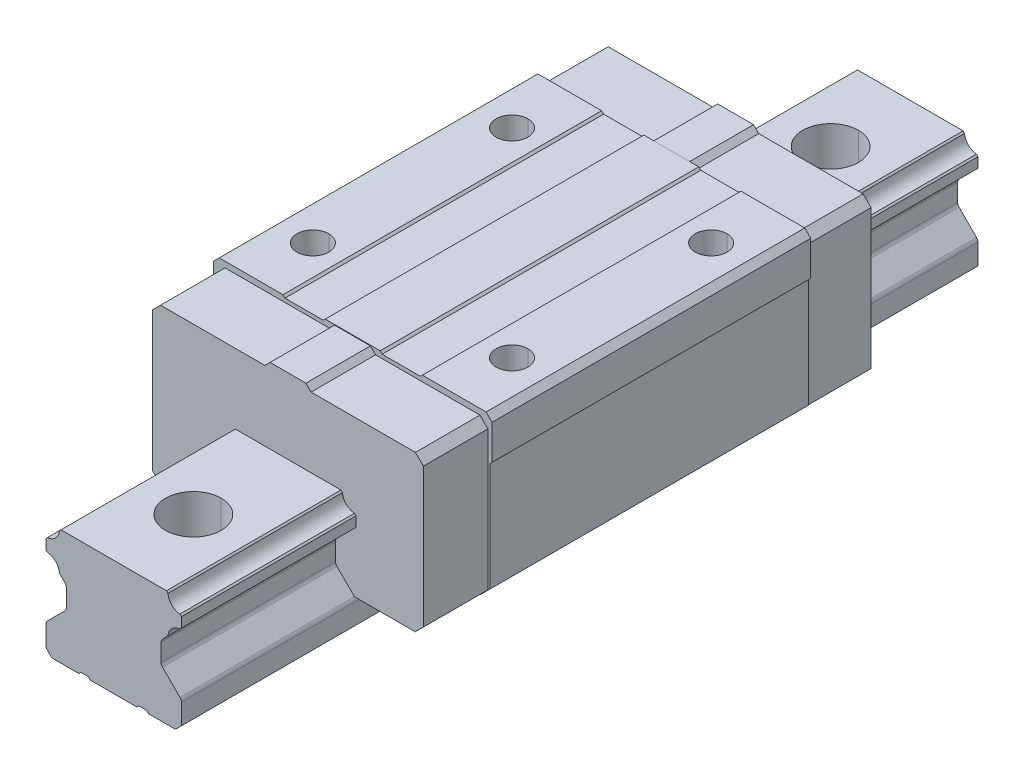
ISO-10303-21;
HEADER;
FILE_DESCRIPTION(('STEP AP214'),'2;1');
FILE_NAME('part.step','',(''),(''),'','','');
FILE_SCHEMA(('AUTOMOTIVE_DESIGN { 1 0 10303 214 1 1 1 1 }'));
ENDSEC;
DATA;
#1=APPLICATION_CONTEXT('core data for automotive mechanical design processes');
#2=APPLICATION_PROTOCOL_DEFINITION('international standard','automotive_design',2000,#1);
#3=PRODUCT_CONTEXT('',#1,'mechanical');
#4=PRODUCT('Part','Part','',(#3));
#5=PRODUCT_RELATED_PRODUCT_CATEGORY('part','',(#4));
#6=PRODUCT_DEFINITION_FORMATION('','',#4);
#7=PRODUCT_DEFINITION_CONTEXT('part definition',#1,'design');
#8=PRODUCT_DEFINITION('design','',#6,#7);
#9=PRODUCT_DEFINITION_SHAPE('','',#8);
#10=(LENGTH_UNIT() NAMED_UNIT(*) SI_UNIT(.MILLI.,.METRE.));
#11=(NAMED_UNIT(*) PLANE_ANGLE_UNIT() SI_UNIT($,.RADIAN.));
#12=(NAMED_UNIT(*) SI_UNIT($,.STERADIAN.) SOLID_ANGLE_UNIT());
#13=UNCERTAINTY_MEASURE_WITH_UNIT(LENGTH_MEASURE(1.E-05),#10,'distance_accuracy_value','');
#14=(GEOMETRIC_REPRESENTATION_CONTEXT(3) GLOBAL_UNCERTAINTY_ASSIGNED_CONTEXT((#13)) GLOBAL_UNIT_ASSIGNED_CONTEXT((#10,
#11,#12)) REPRESENTATION_CONTEXT('',''));
#15=CARTESIAN_POINT('',(0.,0.,0.));
#16=DIRECTION('',(0.,0.,1.));
#17=DIRECTION('',(1.,0.,0.));
#18=AXIS2_PLACEMENT_3D('',#15,#16,#17);
#19=CARTESIAN_POINT('',(0.,0.,80.));
#20=DIRECTION('',(0.,1.,0.));
#21=DIRECTION('',(0.,0.,1.));
#22=AXIS2_PLACEMENT_3D('',#19,#20,#21);
#23=CYLINDRICAL_SURFACE('',#22,7.);
#24=CARTESIAN_POINT('',(0.,-12.,80.));
#25=DIRECTION('',(0.,1.,0.));
#26=DIRECTION('',(0.,0.,1.));
#27=AXIS2_PLACEMENT_3D('',#24,#25,#26);
#28=CIRCLE('',#27,7.);
#29=CARTESIAN_POINT('',(0.,-12.,73.));
#30=VERTEX_POINT('',#29);
#31=CARTESIAN_POINT('',(0.,-12.,87.));
#32=VERTEX_POINT('',#31);
#33=EDGE_CURVE('P0_E491',#30,#32,#28,.T.);
#34=ORIENTED_EDGE('',*,*,#33,.F.);
#35=DIRECTION('',(0.,1.,0.));
#36=VECTOR('',#35,1.);
#37=CARTESIAN_POINT('',(0.,0.,73.));
#38=LINE('',#37,#36);
#39=CARTESIAN_POINT('',(0.,0.,73.));
#40=VERTEX_POINT('',#39);
#41=EDGE_CURVE('P0_E719',#30,#40,#38,.T.);
#42=ORIENTED_EDGE('',*,*,#41,.T.);
#43=CARTESIAN_POINT('',(0.,0.,80.));
#44=DIRECTION('',(0.,-1.,0.));
#45=DIRECTION('',(0.,0.,1.));
#46=AXIS2_PLACEMENT_3D('',#43,#44,#45);
#47=CIRCLE('',#46,7.);
#48=CARTESIAN_POINT('',(0.,0.,87.));
#49=VERTEX_POINT('',#48);
#50=EDGE_CURVE('P0_E10',#49,#40,#47,.T.);
#51=ORIENTED_EDGE('',*,*,#50,.F.);
#52=DIRECTION('',(0.,1.,0.));
#53=VECTOR('',#52,1.);
#54=CARTESIAN_POINT('',(0.,0.,87.));
#55=LINE('',#54,#53);
#56=EDGE_CURVE('P0_E722',#32,#49,#55,.T.);
#57=ORIENTED_EDGE('',*,*,#56,.F.);
#58=EDGE_LOOP('',(#34,#42,#51,#57));
#59=FACE_BOUND('',#58,.T.);
#60=ADVANCED_FACE('P0_F16',(#59),#23,.F.);
#61=CARTESIAN_POINT('',(0.,0.,0.));
#62=DIRECTION('',(0.,1.,0.));
#63=DIRECTION('',(0.,0.,1.));
#64=AXIS2_PLACEMENT_3D('',#61,#62,#63);
#65=CYLINDRICAL_SURFACE('',#64,7.);
#66=CARTESIAN_POINT('',(0.,-12.,0.));
#67=DIRECTION('',(0.,1.,0.));
#68=DIRECTION('',(0.,0.,1.));
#69=AXIS2_PLACEMENT_3D('',#66,#67,#68);
#70=CIRCLE('',#69,7.);
#71=CARTESIAN_POINT('',(0.,-12.,-7.));
#72=VERTEX_POINT('',#71);
#73=CARTESIAN_POINT('',(0.,-12.,7.));
#74=VERTEX_POINT('',#73);
#75=EDGE_CURVE('P0_E588',#72,#74,#70,.T.);
#76=ORIENTED_EDGE('',*,*,#75,.F.);
#77=DIRECTION('',(0.,1.,0.));
#78=VECTOR('',#77,1.);
#79=CARTESIAN_POINT('',(0.,0.,-7.));
#80=LINE('',#79,#78);
#81=CARTESIAN_POINT('',(0.,0.,-7.));
#82=VERTEX_POINT('',#81);
#83=EDGE_CURVE('P0_E707',#72,#82,#80,.T.);
#84=ORIENTED_EDGE('',*,*,#83,.T.);
#85=CARTESIAN_POINT('',(0.,0.,0.));
#86=DIRECTION('',(0.,-1.,0.));
#87=DIRECTION('',(0.,0.,1.));
#88=AXIS2_PLACEMENT_3D('',#85,#86,#87);
#89=CIRCLE('',#88,7.);
#90=CARTESIAN_POINT('',(0.,0.,7.));
#91=VERTEX_POINT('',#90);
#92=EDGE_CURVE('P0_E24',#91,#82,#89,.T.);
#93=ORIENTED_EDGE('',*,*,#92,.F.);
#94=DIRECTION('',(0.,1.,0.));
#95=VECTOR('',#94,1.);
#96=CARTESIAN_POINT('',(0.,0.,7.));
#97=LINE('',#96,#95);
#98=EDGE_CURVE('P0_E711',#74,#91,#97,.T.);
#99=ORIENTED_EDGE('',*,*,#98,.F.);
#100=EDGE_LOOP('',(#76,#84,#93,#99));
#101=FACE_BOUND('',#100,.T.);
#102=ADVANCED_FACE('P0_F761',(#101),#65,.F.);
#103=CARTESIAN_POINT('',(0.,0.,-80.));
#104=DIRECTION('',(0.,1.,0.));
#105=DIRECTION('',(0.,0.,1.));
#106=AXIS2_PLACEMENT_3D('',#103,#104,#105);
#107=CYLINDRICAL_SURFACE('',#106,7.);
#108=CARTESIAN_POINT('',(0.,-12.,-80.));
#109=DIRECTION('',(0.,1.,0.));
#110=DIRECTION('',(0.,0.,1.));
#111=AXIS2_PLACEMENT_3D('',#108,#109,#110);
#112=CIRCLE('',#111,7.);
#113=CARTESIAN_POINT('',(0.,-12.,-87.));
#114=VERTEX_POINT('',#113);
#115=CARTESIAN_POINT('',(0.,-12.,-73.));
#116=VERTEX_POINT('',#115);
#117=EDGE_CURVE('P0_E572',#114,#116,#112,.T.);
#118=ORIENTED_EDGE('',*,*,#117,.F.);
#119=DIRECTION('',(0.,1.,0.));
#120=VECTOR('',#119,1.);
#121=CARTESIAN_POINT('',(0.,0.,-87.));
#122=LINE('',#121,#120);
#123=CARTESIAN_POINT('',(0.,0.,-87.));
#124=VERTEX_POINT('',#123);
#125=EDGE_CURVE('P0_E695',#114,#124,#122,.T.);
#126=ORIENTED_EDGE('',*,*,#125,.T.);
#127=CARTESIAN_POINT('',(0.,0.,-80.));
#128=DIRECTION('',(0.,-1.,0.));
#129=DIRECTION('',(0.,0.,1.));
#130=AXIS2_PLACEMENT_3D('',#127,#128,#129);
#131=CIRCLE('',#130,7.);
#132=CARTESIAN_POINT('',(0.,0.,-73.));
#133=VERTEX_POINT('',#132);
#134=EDGE_CURVE('P0_E746',#133,#124,#131,.T.);
#135=ORIENTED_EDGE('',*,*,#134,.F.);
#136=DIRECTION('',(0.,1.,0.));
#137=VECTOR('',#136,1.);
#138=CARTESIAN_POINT('',(0.,0.,-73.));
#139=LINE('',#138,#137);
#140=EDGE_CURVE('P0_E699',#116,#133,#139,.T.);
#141=ORIENTED_EDGE('',*,*,#140,.F.);
#142=EDGE_LOOP('',(#118,#126,#135,#141));
#143=FACE_BOUND('',#142,.T.);
#144=ADVANCED_FACE('P0_F787',(#143),#107,.F.);
#145=CARTESIAN_POINT('',(0.,0.,0.));
#146=DIRECTION('',(0.,1.,0.));
#147=DIRECTION('',(0.,0.,1.));
#148=AXIS2_PLACEMENT_3D('',#145,#146,#147);
#149=CYLINDRICAL_SURFACE('',#148,4.5);
#150=CARTESIAN_POINT('',(0.,-29.,0.));
#151=DIRECTION('',(0.,1.,0.));
#152=DIRECTION('',(0.,0.,1.));
#153=AXIS2_PLACEMENT_3D('',#150,#151,#152);
#154=CIRCLE('',#153,4.5);
#155=CARTESIAN_POINT('',(0.,-29.,-4.5));
#156=VERTEX_POINT('',#155);
#157=CARTESIAN_POINT('',(0.,-29.,4.5));
#158=VERTEX_POINT('',#157);
#159=EDGE_CURVE('P0_E524',#156,#158,#154,.T.);
#160=ORIENTED_EDGE('',*,*,#159,.F.);
#161=DIRECTION('',(0.,1.,0.));
#162=VECTOR('',#161,1.);
#163=CARTESIAN_POINT('',(0.,0.,-4.5));
#164=LINE('',#163,#162);
#165=CARTESIAN_POINT('',(0.,-12.,-4.5));
#166=VERTEX_POINT('',#165);
#167=EDGE_CURVE('P0_E428',#156,#166,#164,.T.);
#168=ORIENTED_EDGE('',*,*,#167,.T.);
#169=CARTESIAN_POINT('',(0.,-12.,0.));
#170=DIRECTION('',(0.,-1.,0.));
#171=DIRECTION('',(0.,0.,1.));
#172=AXIS2_PLACEMENT_3D('',#169,#170,#171);
#173=CIRCLE('',#172,4.5);
#174=CARTESIAN_POINT('',(0.,-12.,4.5));
#175=VERTEX_POINT('',#174);
#176=EDGE_CURVE('P0_E589',#175,#166,#173,.T.);
#177=ORIENTED_EDGE('',*,*,#176,.F.);
#178=DIRECTION('',(0.,1.,0.));
#179=VECTOR('',#178,1.);
#180=CARTESIAN_POINT('',(0.,0.,4.5));
#181=LINE('',#180,#179);
#182=EDGE_CURVE('P0_E430',#158,#175,#181,.T.);
#183=ORIENTED_EDGE('',*,*,#182,.F.);
#184=EDGE_LOOP('',(#160,#168,#177,#183));
#185=FACE_BOUND('',#184,.T.);
#186=ADVANCED_FACE('P0_F859',(#185),#149,.F.);
#187=CARTESIAN_POINT('',(0.,0.,80.));
#188=DIRECTION('',(0.,1.,0.));
#189=DIRECTION('',(0.,0.,1.));
#190=AXIS2_PLACEMENT_3D('',#187,#188,#189);
#191=CYLINDRICAL_SURFACE('',#190,4.5);
#192=CARTESIAN_POINT('',(0.,-29.,80.));
#193=DIRECTION('',(0.,1.,0.));
#194=DIRECTION('',(0.,0.,1.));
#195=AXIS2_PLACEMENT_3D('',#192,#193,#194);
#196=CIRCLE('',#195,4.5);
#197=CARTESIAN_POINT('',(0.,-29.,75.5));
#198=VERTEX_POINT('',#197);
#199=CARTESIAN_POINT('',(0.,-29.,84.5));
#200=VERTEX_POINT('',#199);
#201=EDGE_CURVE('P0_E521',#198,#200,#196,.T.);
#202=ORIENTED_EDGE('',*,*,#201,.F.);
#203=DIRECTION('',(0.,1.,0.));
#204=VECTOR('',#203,1.);
#205=CARTESIAN_POINT('',(0.,0.,75.5));
#206=LINE('',#205,#204);
#207=CARTESIAN_POINT('',(0.,-12.,75.5));
#208=VERTEX_POINT('',#207);
#209=EDGE_CURVE('P0_E1055',#198,#208,#206,.T.);
#210=ORIENTED_EDGE('',*,*,#209,.T.);
#211=CARTESIAN_POINT('',(0.,-12.,80.));
#212=DIRECTION('',(0.,-1.,0.));
#213=DIRECTION('',(0.,0.,1.));
#214=AXIS2_PLACEMENT_3D('',#211,#212,#213);
#215=CIRCLE('',#214,4.5);
#216=CARTESIAN_POINT('',(0.,-12.,84.5));
#217=VERTEX_POINT('',#216);
#218=EDGE_CURVE('P0_E495',#217,#208,#215,.T.);
#219=ORIENTED_EDGE('',*,*,#218,.F.);
#220=DIRECTION('',(0.,1.,0.));
#221=VECTOR('',#220,1.);
#222=CARTESIAN_POINT('',(0.,0.,84.5));
#223=LINE('',#222,#221);
#224=EDGE_CURVE('P0_E1045',#200,#217,#223,.T.);
#225=ORIENTED_EDGE('',*,*,#224,.F.);
#226=EDGE_LOOP('',(#202,#210,#219,#225));
#227=FACE_BOUND('',#226,.T.);
#228=ADVANCED_FACE('P0_F805',(#227),#191,.F.);
#229=CARTESIAN_POINT('',(0.,0.,-80.));
#230=DIRECTION('',(0.,1.,0.));
#231=DIRECTION('',(0.,0.,1.));
#232=AXIS2_PLACEMENT_3D('',#229,#230,#231);
#233=CYLINDRICAL_SURFACE('',#232,4.5);
#234=CARTESIAN_POINT('',(0.,-29.,-80.));
#235=DIRECTION('',(0.,1.,0.));
#236=DIRECTION('',(0.,0.,1.));
#237=AXIS2_PLACEMENT_3D('',#234,#235,#236);
#238=CIRCLE('',#237,4.5);
#239=CARTESIAN_POINT('',(0.,-29.,-84.5));
#240=VERTEX_POINT('',#239);
#241=CARTESIAN_POINT('',(0.,-29.,-75.5));
#242=VERTEX_POINT('',#241);
#243=EDGE_CURVE('P0_E525',#240,#242,#238,.T.);
#244=ORIENTED_EDGE('',*,*,#243,.F.);
#245=DIRECTION('',(0.,1.,0.));
#246=VECTOR('',#245,1.);
#247=CARTESIAN_POINT('',(0.,0.,-84.5));
#248=LINE('',#247,#246);
#249=CARTESIAN_POINT('',(0.,-12.,-84.5));
#250=VERTEX_POINT('',#249);
#251=EDGE_CURVE('P0_E1035',#240,#250,#248,.T.);
#252=ORIENTED_EDGE('',*,*,#251,.T.);
#253=CARTESIAN_POINT('',(0.,-12.,-80.));
#254=DIRECTION('',(0.,-1.,0.));
#255=DIRECTION('',(0.,0.,1.));
#256=AXIS2_PLACEMENT_3D('',#253,#254,#255);
#257=CIRCLE('',#256,4.5);
#258=CARTESIAN_POINT('',(0.,-12.,-75.5));
#259=VERTEX_POINT('',#258);
#260=EDGE_CURVE('P0_E581',#259,#250,#257,.T.);
#261=ORIENTED_EDGE('',*,*,#260,.F.);
#262=DIRECTION('',(0.,1.,0.));
#263=VECTOR('',#262,1.);
#264=CARTESIAN_POINT('',(0.,0.,-75.5));
#265=LINE('',#264,#263);
#266=EDGE_CURVE('P0_E1040',#242,#259,#265,.T.);
#267=ORIENTED_EDGE('',*,*,#266,.F.);
#268=EDGE_LOOP('',(#244,#252,#261,#267));
#269=FACE_BOUND('',#268,.T.);
#270=ADVANCED_FACE('P0_F797',(#269),#233,.F.);
#271=CARTESIAN_POINT('',(13.25142135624,0.,-100.));
#272=DIRECTION('',(0.,1.,0.));
#273=DIRECTION('',(1.,0.,0.));
#274=AXIS2_PLACEMENT_3D('',#271,#272,#273);
#275=PLANE('',#274);
#276=ORIENTED_EDGE('',*,*,#50,.T.);
#277=CARTESIAN_POINT('',(0.,0.,80.));
#278=DIRECTION('',(0.,-1.,0.));
#279=DIRECTION('',(0.,0.,1.));
#280=AXIS2_PLACEMENT_3D('',#277,#278,#279);
#281=CIRCLE('',#280,7.);
#282=EDGE_CURVE('P0_E726',#40,#49,#281,.T.);
#283=ORIENTED_EDGE('',*,*,#282,.T.);
#284=EDGE_LOOP('',(#276,#283));
#285=FACE_BOUND('',#284,.T.);
#286=ORIENTED_EDGE('',*,*,#92,.T.);
#287=CARTESIAN_POINT('',(0.,0.,0.));
#288=DIRECTION('',(0.,-1.,0.));
#289=DIRECTION('',(0.,0.,1.));
#290=AXIS2_PLACEMENT_3D('',#287,#288,#289);
#291=CIRCLE('',#290,7.);
#292=EDGE_CURVE('P0_E715',#82,#91,#291,.T.);
#293=ORIENTED_EDGE('',*,*,#292,.T.);
#294=EDGE_LOOP('',(#286,#293));
#295=FACE_BOUND('',#294,.T.);
#296=ORIENTED_EDGE('',*,*,#134,.T.);
#297=CARTESIAN_POINT('',(0.,0.,-80.));
#298=DIRECTION('',(0.,-1.,0.));
#299=DIRECTION('',(0.,0.,1.));
#300=AXIS2_PLACEMENT_3D('',#297,#298,#299);
#301=CIRCLE('',#300,7.);
#302=EDGE_CURVE('P0_E703',#124,#133,#301,.T.);
#303=ORIENTED_EDGE('',*,*,#302,.T.);
#304=EDGE_LOOP('',(#296,#303));
#305=FACE_BOUND('',#304,.T.);
#306=DIRECTION('',(0.,0.,1.));
#307=VECTOR('',#306,1.);
#308=CARTESIAN_POINT('',(-13.2514213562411,0.,-100.));
#309=LINE('',#308,#307);
#310=CARTESIAN_POINT('',(-13.2514213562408,-2.64025693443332E-13,-100.));
#311=VERTEX_POINT('',#310);
#312=CARTESIAN_POINT('',(-13.2514213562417,-1.66087993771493E-12,100.));
#313=VERTEX_POINT('',#312);
#314=EDGE_CURVE('P0_E50',#311,#313,#309,.T.);
#315=ORIENTED_EDGE('',*,*,#314,.T.);
#316=DIRECTION('',(1.,0.,0.));
#317=VECTOR('',#316,1.);
#318=CARTESIAN_POINT('',(13.25142135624,0.,100.));
#319=LINE('',#318,#317);
#320=CARTESIAN_POINT('',(13.2514213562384,-8.2969248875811E-13,100.));
#321=VERTEX_POINT('',#320);
#322=EDGE_CURVE('P0_E37',#313,#321,#319,.T.);
#323=ORIENTED_EDGE('',*,*,#322,.T.);
#324=DIRECTION('',(0.,0.,-1.));
#325=VECTOR('',#324,1.);
#326=CARTESIAN_POINT('',(13.2514213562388,0.,-100.));
#327=LINE('',#326,#325);
#328=CARTESIAN_POINT('',(13.2514213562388,-2.10539973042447E-13,-100.));
#329=VERTEX_POINT('',#328);
#330=EDGE_CURVE('P0_E729',#321,#329,#327,.T.);
#331=ORIENTED_EDGE('',*,*,#330,.T.);
#332=DIRECTION('',(-1.,0.,0.));
#333=VECTOR('',#332,1.);
#334=CARTESIAN_POINT('',(13.25142135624,0.,-100.));
#335=LINE('',#334,#333);
#336=EDGE_CURVE('P0_E663',#329,#311,#335,.T.);
#337=ORIENTED_EDGE('',*,*,#336,.T.);
#338=EDGE_LOOP('',(#315,#323,#331,#337));
#339=FACE_BOUND('',#338,.T.);
#340=ADVANCED_FACE('P0_F754',(#285,#295,#305,#339),#275,.T.);
#341=CARTESIAN_POINT('',(0.,0.,100.));
#342=DIRECTION('',(0.,0.,1.));
#343=DIRECTION('',(1.,0.,0.));
#344=AXIS2_PLACEMENT_3D('',#341,#342,#343);
#345=PLANE('',#344);
#346=CARTESIAN_POINT('',(16.86757359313,-9.868573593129,100.));
#347=DIRECTION('',(0.,0.,-1.));
#348=DIRECTION('',(1.,0.,0.));
#349=AXIS2_PLACEMENT_3D('',#346,#347,#348);
#350=CIRCLE('',#349,3.25);
#351=CARTESIAN_POINT('',(13.6259433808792,-9.63547797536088,100.));
#352=VERTEX_POINT('',#351);
#353=CARTESIAN_POINT('',(16.6344779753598,-6.62694338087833,100.));
#354=VERTEX_POINT('',#353);
#355=EDGE_CURVE('P0_E692',#352,#354,#350,.T.);
#356=ORIENTED_EDGE('',*,*,#355,.T.);
#357=DIRECTION('',(-0.707106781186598,-0.707106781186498,0.));
#358=VECTOR('',#357,1.);
#359=CARTESIAN_POINT('',(16.63447797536,-6.626943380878,100.));
#360=LINE('',#359,#358);
#361=CARTESIAN_POINT('',(17.,-6.26142135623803,100.));
#362=VERTEX_POINT('',#361);
#363=EDGE_CURVE('P0_E440',#362,#354,#360,.T.);
#364=ORIENTED_EDGE('',*,*,#363,.F.);
#365=DIRECTION('',(0.,1.,0.));
#366=VECTOR('',#365,1.);
#367=CARTESIAN_POINT('',(17.,0.,100.));
#368=LINE('',#367,#366);
#369=CARTESIAN_POINT('',(17.,-3.74857864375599,100.));
#370=VERTEX_POINT('',#369);
#371=EDGE_CURVE('P0_E599',#362,#370,#368,.T.);
#372=ORIENTED_EDGE('',*,*,#371,.T.);
#373=DIRECTION('',(0.707106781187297,-0.707106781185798,0.));
#374=VECTOR('',#373,1.);
#375=CARTESIAN_POINT('',(17.,-3.748578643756,100.));
#376=LINE('',#375,#374);
#377=CARTESIAN_POINT('',(16.6226021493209,-3.37118079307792,100.));
#378=VERTEX_POINT('',#377);
#379=EDGE_CURVE('P0_E1107',#378,#370,#376,.T.);
#380=ORIENTED_EDGE('',*,*,#379,.F.);
#381=CARTESIAN_POINT('',(16.86757359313,-0.1304264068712,100.));
#382=DIRECTION('',(0.,0.,-1.));
#383=DIRECTION('',(1.,0.,0.));
#384=AXIS2_PLACEMENT_3D('',#381,#382,#383);
#385=CIRCLE('',#384,3.25);
#386=CARTESIAN_POINT('',(13.626819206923,-0.375397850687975,100.));
#387=VERTEX_POINT('',#386);
#388=EDGE_CURVE('P0_E515',#378,#387,#385,.T.);
#389=ORIENTED_EDGE('',*,*,#388,.T.);
#390=DIRECTION('',(-0.707106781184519,0.707106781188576,0.));
#391=VECTOR('',#390,1.);
#392=CARTESIAN_POINT('',(13.626819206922,-0.375397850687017,100.));
#393=LINE('',#392,#391);
#394=EDGE_CURVE('P0_E732',#387,#321,#393,.T.);
#395=ORIENTED_EDGE('',*,*,#394,.T.);
#396=ORIENTED_EDGE('',*,*,#322,.F.);
#397=DIRECTION('',(-0.707106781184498,-0.707106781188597,0.));
#398=VECTOR('',#397,1.);
#399=CARTESIAN_POINT('',(-13.2514213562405,-4.21202167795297E-13,100.));
#400=LINE('',#399,#398);
#401=CARTESIAN_POINT('',(-13.6268192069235,-0.375397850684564,100.));
#402=VERTEX_POINT('',#401);
#403=EDGE_CURVE('P0_E660',#313,#402,#400,.T.);
#404=ORIENTED_EDGE('',*,*,#403,.T.);
#405=CARTESIAN_POINT('',(-16.86757359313,-0.1304264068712,100.));
#406=DIRECTION('',(0.,0.,-1.));
#407=DIRECTION('',(1.,0.,0.));
#408=AXIS2_PLACEMENT_3D('',#405,#406,#407);
#409=CIRCLE('',#408,3.25);
#410=CARTESIAN_POINT('',(-16.6226021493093,-3.37118079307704,100.));
#411=VERTEX_POINT('',#410);
#412=EDGE_CURVE('P0_E510',#402,#411,#409,.T.);
#413=ORIENTED_EDGE('',*,*,#412,.T.);
#414=DIRECTION('',(0.707106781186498,0.707106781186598,0.));
#415=VECTOR('',#414,1.);
#416=CARTESIAN_POINT('',(-16.62260214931,-3.371180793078,100.));
#417=LINE('',#416,#415);
#418=CARTESIAN_POINT('',(-16.9999999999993,-3.74857864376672,100.));
#419=VERTEX_POINT('',#418);
#420=EDGE_CURVE('P0_E930',#419,#411,#417,.T.);
#421=ORIENTED_EDGE('',*,*,#420,.F.);
#422=DIRECTION('',(0.,-1.,0.));
#423=VECTOR('',#422,1.);
#424=CARTESIAN_POINT('',(-16.9999999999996,0.,100.));
#425=LINE('',#424,#423);
#426=CARTESIAN_POINT('',(-17.,-6.26142135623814,100.));
#427=VERTEX_POINT('',#426);
#428=EDGE_CURVE('P0_E505',#419,#427,#425,.T.);
#429=ORIENTED_EDGE('',*,*,#428,.T.);
#430=DIRECTION('',(-0.707106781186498,0.707106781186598,0.));
#431=VECTOR('',#430,1.);
#432=CARTESIAN_POINT('',(-17.,-6.261421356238,100.));
#433=LINE('',#432,#431);
#434=CARTESIAN_POINT('',(-16.6344779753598,-6.62694338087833,100.));
#435=VERTEX_POINT('',#434);
#436=EDGE_CURVE('P0_E954',#435,#427,#433,.T.);
#437=ORIENTED_EDGE('',*,*,#436,.F.);
#438=CARTESIAN_POINT('',(-16.86757359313,-9.868573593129,100.));
#439=DIRECTION('',(0.,0.,-1.));
#440=DIRECTION('',(1.,0.,0.));
#441=AXIS2_PLACEMENT_3D('',#438,#439,#440);
#442=CIRCLE('',#441,3.25);
#443=CARTESIAN_POINT('',(-13.6259433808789,-9.63547797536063,100.));
#444=VERTEX_POINT('',#443);
#445=EDGE_CURVE('P0_E624',#435,#444,#442,.T.);
#446=ORIENTED_EDGE('',*,*,#445,.T.);
#447=DIRECTION('',(0.707106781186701,-0.707106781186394,0.));
#448=VECTOR('',#447,1.);
#449=CARTESIAN_POINT('',(-13.625943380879,-9.63547797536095,100.));
#450=LINE('',#449,#448);
#451=CARTESIAN_POINT('',(-12.2514718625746,-11.0099494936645,100.));
#452=VERTEX_POINT('',#451);
#453=EDGE_CURVE('P0_E627',#444,#452,#450,.T.);
#454=ORIENTED_EDGE('',*,*,#453,.T.);
#455=CARTESIAN_POINT('',(-13.1,-11.85847763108,100.));
#456=DIRECTION('',(0.,0.,-1.));
#457=DIRECTION('',(1.,0.,0.));
#458=AXIS2_PLACEMENT_3D('',#455,#456,#457);
#459=CIRCLE('',#458,1.2);
#460=CARTESIAN_POINT('',(-11.9000000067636,-11.8583164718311,100.));
#461=VERTEX_POINT('',#460);
#462=EDGE_CURVE('P0_E963',#452,#461,#459,.T.);
#463=ORIENTED_EDGE('',*,*,#462,.T.);
#464=DIRECTION('',(0.,-1.,0.));
#465=VECTOR('',#464,1.);
#466=CARTESIAN_POINT('',(-11.9000000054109,0.,100.));
#467=LINE('',#466,#465);
#468=CARTESIAN_POINT('',(-11.9000000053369,-16.2616803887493,100.));
#469=VERTEX_POINT('',#468);
#470=EDGE_CURVE('P0_E568',#461,#469,#467,.T.);
#471=ORIENTED_EDGE('',*,*,#470,.T.);
#472=CARTESIAN_POINT('',(-13.1,-16.26154209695,100.));
#473=DIRECTION('',(0.,0.,-1.));
#474=DIRECTION('',(1.,0.,0.));
#475=AXIS2_PLACEMENT_3D('',#472,#473,#474);
#476=CIRCLE('',#475,1.2);
#477=CARTESIAN_POINT('',(-12.2514718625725,-17.110070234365,100.));
#478=VERTEX_POINT('',#477);
#479=EDGE_CURVE('P0_E985',#469,#478,#476,.T.);
#480=ORIENTED_EDGE('',*,*,#479,.T.);
#481=DIRECTION('',(-0.707106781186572,-0.707106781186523,0.));
#482=VECTOR('',#481,1.);
#483=CARTESIAN_POINT('',(-12.251471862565,-17.11007023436,100.));
#484=LINE('',#483,#482);
#485=CARTESIAN_POINT('',(-16.6485281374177,-21.5071265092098,100.));
#486=VERTEX_POINT('',#485);
#487=EDGE_CURVE('P0_E567',#478,#486,#484,.T.);
#488=ORIENTED_EDGE('',*,*,#487,.T.);
#489=CARTESIAN_POINT('',(-15.8,-22.35565464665,100.));
#490=DIRECTION('',(0.,0.,-1.));
#491=DIRECTION('',(1.,0.,0.));
#492=AXIS2_PLACEMENT_3D('',#489,#490,#491);
#493=CIRCLE('',#492,1.2);
#494=CARTESIAN_POINT('',(-16.9999999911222,-22.3554704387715,100.));
#495=VERTEX_POINT('',#494);
#496=EDGE_CURVE('P0_E993',#495,#486,#493,.T.);
#497=ORIENTED_EDGE('',*,*,#496,.F.);
#498=DIRECTION('',(0.,-1.,0.));
#499=VECTOR('',#498,1.);
#500=CARTESIAN_POINT('',(-16.9999999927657,0.,100.));
#501=LINE('',#500,#499);
#502=CARTESIAN_POINT('',(-16.9999999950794,-27.5000000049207,100.));
#503=VERTEX_POINT('',#502);
#504=EDGE_CURVE('P0_E639',#495,#503,#501,.T.);
#505=ORIENTED_EDGE('',*,*,#504,.T.);
#506=DIRECTION('',(0.707106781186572,-0.707106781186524,0.));
#507=VECTOR('',#506,1.);
#508=CARTESIAN_POINT('',(-16.9999999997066,-27.5000000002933,100.));
#509=LINE('',#508,#507);
#510=CARTESIAN_POINT('',(-15.5,-29.,100.));
#511=VERTEX_POINT('',#510);
#512=EDGE_CURVE('P0_E655',#503,#511,#509,.T.);
#513=ORIENTED_EDGE('',*,*,#512,.T.);
#514=DIRECTION('',(1.,0.,0.));
#515=VECTOR('',#514,1.);
#516=CARTESIAN_POINT('',(0.,-29.,100.));
#517=LINE('',#516,#515);
#518=CARTESIAN_POINT('',(-8.75,-29.,100.));
#519=VERTEX_POINT('',#518);
#520=EDGE_CURVE('P0_E577',#511,#519,#517,.T.);
#521=ORIENTED_EDGE('',*,*,#520,.T.);
#522=DIRECTION('',(-0.707106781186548,-0.707106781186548,0.));
#523=VECTOR('',#522,1.);
#524=CARTESIAN_POINT('',(-8.75,-29.,100.));
#525=LINE('',#524,#523);
#526=CARTESIAN_POINT('',(-8.25,-28.5,100.));
#527=VERTEX_POINT('',#526);
#528=EDGE_CURVE('P0_E1012',#527,#519,#525,.T.);
#529=ORIENTED_EDGE('',*,*,#528,.F.);
#530=DIRECTION('',(1.,0.,0.));
#531=VECTOR('',#530,1.);
#532=CARTESIAN_POINT('',(0.,-28.5,100.));
#533=LINE('',#532,#531);
#534=CARTESIAN_POINT('',(-6.35,-28.5,100.));
#535=VERTEX_POINT('',#534);
#536=EDGE_CURVE('P0_E576',#527,#535,#533,.T.);
#537=ORIENTED_EDGE('',*,*,#536,.T.);
#538=DIRECTION('',(-0.707106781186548,0.707106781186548,0.));
#539=VECTOR('',#538,1.);
#540=CARTESIAN_POINT('',(-6.35,-28.5,100.));
#541=LINE('',#540,#539);
#542=CARTESIAN_POINT('',(-5.85,-29.,100.));
#543=VERTEX_POINT('',#542);
#544=EDGE_CURVE('P0_E446',#543,#535,#541,.T.);
#545=ORIENTED_EDGE('',*,*,#544,.F.);
#546=DIRECTION('',(1.,0.,0.));
#547=VECTOR('',#546,1.);
#548=CARTESIAN_POINT('',(0.,-29.,100.));
#549=LINE('',#548,#547);
#550=CARTESIAN_POINT('',(5.85,-29.,100.));
#551=VERTEX_POINT('',#550);
#552=EDGE_CURVE('P0_E672',#543,#551,#549,.T.);
#553=ORIENTED_EDGE('',*,*,#552,.T.);
#554=DIRECTION('',(-0.707106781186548,-0.707106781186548,0.));
#555=VECTOR('',#554,1.);
#556=CARTESIAN_POINT('',(5.85,-29.,100.));
#557=LINE('',#556,#555);
#558=CARTESIAN_POINT('',(6.35,-28.5,100.));
#559=VERTEX_POINT('',#558);
#560=EDGE_CURVE('P0_E479',#559,#551,#557,.T.);
#561=ORIENTED_EDGE('',*,*,#560,.F.);
#562=DIRECTION('',(1.,0.,0.));
#563=VECTOR('',#562,1.);
#564=CARTESIAN_POINT('',(0.,-28.5,100.));
#565=LINE('',#564,#563);
#566=CARTESIAN_POINT('',(8.25,-28.5,100.));
#567=VERTEX_POINT('',#566);
#568=EDGE_CURVE('P0_E383',#559,#567,#565,.T.);
#569=ORIENTED_EDGE('',*,*,#568,.T.);
#570=DIRECTION('',(-0.707106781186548,0.707106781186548,0.));
#571=VECTOR('',#570,1.);
#572=CARTESIAN_POINT('',(8.25,-28.5,100.));
#573=LINE('',#572,#571);
#574=CARTESIAN_POINT('',(8.75,-29.,100.));
#575=VERTEX_POINT('',#574);
#576=EDGE_CURVE('P0_E417',#575,#567,#573,.T.);
#577=ORIENTED_EDGE('',*,*,#576,.F.);
#578=DIRECTION('',(1.,0.,0.));
#579=VECTOR('',#578,1.);
#580=CARTESIAN_POINT('',(0.,-29.,100.));
#581=LINE('',#580,#579);
#582=CARTESIAN_POINT('',(15.5,-29.,100.));
#583=VERTEX_POINT('',#582);
#584=EDGE_CURVE('P0_E483',#575,#583,#581,.T.);
#585=ORIENTED_EDGE('',*,*,#584,.T.);
#586=DIRECTION('',(0.707106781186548,0.707106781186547,0.));
#587=VECTOR('',#586,1.);
#588=CARTESIAN_POINT('',(15.5,-29.,100.));
#589=LINE('',#588,#587);
#590=CARTESIAN_POINT('',(17.,-27.5,100.));
#591=VERTEX_POINT('',#590);
#592=EDGE_CURVE('P0_E488',#583,#591,#589,.T.);
#593=ORIENTED_EDGE('',*,*,#592,.T.);
#594=DIRECTION('',(0.,1.,0.));
#595=VECTOR('',#594,1.);
#596=CARTESIAN_POINT('',(17.,0.,100.));
#597=LINE('',#596,#595);
#598=CARTESIAN_POINT('',(16.9999999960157,-22.3555163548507,100.));
#599=VERTEX_POINT('',#598);
#600=EDGE_CURVE('P0_E473',#591,#599,#597,.T.);
#601=ORIENTED_EDGE('',*,*,#600,.T.);
#602=CARTESIAN_POINT('',(15.8,-22.35565464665,100.));
#603=DIRECTION('',(0.,0.,-1.));
#604=DIRECTION('',(1.,0.,0.));
#605=AXIS2_PLACEMENT_3D('',#602,#603,#604);
#606=CIRCLE('',#605,1.2);
#607=CARTESIAN_POINT('',(16.6485281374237,-21.5071265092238,100.));
#608=VERTEX_POINT('',#607);
#609=EDGE_CURVE('P0_E497',#608,#599,#606,.T.);
#610=ORIENTED_EDGE('',*,*,#609,.F.);
#611=DIRECTION('',(-0.707106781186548,0.707106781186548,0.));
#612=VECTOR('',#611,1.);
#613=CARTESIAN_POINT('',(16.6485281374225,-21.5071265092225,100.));
#614=LINE('',#613,#612);
#615=CARTESIAN_POINT('',(12.2514718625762,-17.1100702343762,100.));
#616=VERTEX_POINT('',#615);
#617=EDGE_CURVE('P0_E472',#608,#616,#614,.T.);
#618=ORIENTED_EDGE('',*,*,#617,.T.);
#619=CARTESIAN_POINT('',(13.1,-16.26154209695,100.));
#620=DIRECTION('',(0.,0.,-1.));
#621=DIRECTION('',(1.,0.,0.));
#622=AXIS2_PLACEMENT_3D('',#619,#620,#621);
#623=CIRCLE('',#622,1.2);
#624=CARTESIAN_POINT('',(11.9000000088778,-16.2617263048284,100.));
#625=VERTEX_POINT('',#624);
#626=EDGE_CURVE('P0_E538',#616,#625,#623,.T.);
#627=ORIENTED_EDGE('',*,*,#626,.T.);
#628=DIRECTION('',(0.,1.,0.));
#629=VECTOR('',#628,1.);
#630=CARTESIAN_POINT('',(11.9000000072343,0.,100.));
#631=LINE('',#630,#629);
#632=CARTESIAN_POINT('',(11.9000000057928,-11.8583393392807,100.));
#633=VERTEX_POINT('',#632);
#634=EDGE_CURVE('P0_E684',#625,#633,#631,.T.);
#635=ORIENTED_EDGE('',*,*,#634,.T.);
#636=CARTESIAN_POINT('',(13.1,-11.85847763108,100.));
#637=DIRECTION('',(0.,0.,-1.));
#638=DIRECTION('',(1.,0.,0.));
#639=AXIS2_PLACEMENT_3D('',#636,#637,#638);
#640=CIRCLE('',#639,1.2);
#641=CARTESIAN_POINT('',(12.2514718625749,-11.0099494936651,100.));
#642=VERTEX_POINT('',#641);
#643=EDGE_CURVE('P0_E441',#633,#642,#640,.T.);
#644=ORIENTED_EDGE('',*,*,#643,.T.);
#645=DIRECTION('',(0.707106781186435,0.70710678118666,0.));
#646=VECTOR('',#645,1.);
#647=CARTESIAN_POINT('',(12.2514718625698,-11.0099494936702,100.));
#648=LINE('',#647,#646);
#649=EDGE_CURVE('P0_E451',#642,#352,#648,.T.);
#650=ORIENTED_EDGE('',*,*,#649,.T.);
#651=EDGE_LOOP('',(#356,#364,#372,#380,#389,#395,#396,#404,#413,#421,#429,#437,#446,#454,#463,
#471,#480,#488,#497,#505,#513,#521,#529,#537,#545,#553,#561,#569,#577,#585,#593,#601,#610,#618,
#627,#635,#644,#650));
#652=FACE_BOUND('',#651,.T.);
#653=ADVANCED_FACE('P0_F796',(#652),#345,.T.);
#654=CARTESIAN_POINT('',(-13.25142135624,0.,-100.));
#655=DIRECTION('',(-0.707106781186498,0.707106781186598,0.));
#656=DIRECTION('',(0.,0.,1.));
#657=AXIS2_PLACEMENT_3D('',#654,#655,#656);
#658=PLANE('',#657);
#659=DIRECTION('',(0.,0.,1.));
#660=VECTOR('',#659,1.);
#661=CARTESIAN_POINT('',(-13.6268192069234,-0.375397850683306,-100.));
#662=LINE('',#661,#660);
#663=CARTESIAN_POINT('',(-13.6268192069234,-0.375397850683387,-100.));
#664=VERTEX_POINT('',#663);
#665=EDGE_CURVE('P0_E606',#664,#402,#662,.T.);
#666=ORIENTED_EDGE('',*,*,#665,.T.);
#667=ORIENTED_EDGE('',*,*,#403,.F.);
#668=ORIENTED_EDGE('',*,*,#314,.F.);
#669=DIRECTION('',(-0.707106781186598,-0.707106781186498,0.));
#670=VECTOR('',#669,1.);
#671=CARTESIAN_POINT('',(-13.25142135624,0.,-100.));
#672=LINE('',#671,#670);
#673=EDGE_CURVE('P0_E737',#311,#664,#672,.T.);
#674=ORIENTED_EDGE('',*,*,#673,.T.);
#675=EDGE_LOOP('',(#666,#667,#668,#674));
#676=FACE_BOUND('',#675,.T.);
#677=ADVANCED_FACE('P0_F803',(#676),#658,.T.);
#678=CARTESIAN_POINT('',(0.,0.,-100.));
#679=DIRECTION('',(0.,0.,1.));
#680=DIRECTION('',(1.,0.,0.));
#681=AXIS2_PLACEMENT_3D('',#678,#679,#680);
#682=PLANE('',#681);
#683=CARTESIAN_POINT('',(16.86757359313,-9.868573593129,-100.));
#684=DIRECTION('',(0.,0.,-1.));
#685=DIRECTION('',(1.,0.,0.));
#686=AXIS2_PLACEMENT_3D('',#683,#684,#685);
#687=CIRCLE('',#686,3.25);
#688=CARTESIAN_POINT('',(13.6259433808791,-9.63547797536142,-100.));
#689=VERTEX_POINT('',#688);
#690=CARTESIAN_POINT('',(16.6344779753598,-6.62694338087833,-100.));
#691=VERTEX_POINT('',#690);
#692=EDGE_CURVE('P0_E689',#689,#691,#687,.T.);
#693=ORIENTED_EDGE('',*,*,#692,.F.);
#694=DIRECTION('',(0.70710678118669,0.707106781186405,0.));
#695=VECTOR('',#694,1.);
#696=CARTESIAN_POINT('',(12.2514718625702,-11.0099494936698,-100.));
#697=LINE('',#696,#695);
#698=CARTESIAN_POINT('',(12.251471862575,-11.009949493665,-100.));
#699=VERTEX_POINT('',#698);
#700=EDGE_CURVE('P0_E651',#699,#689,#697,.T.);
#701=ORIENTED_EDGE('',*,*,#700,.F.);
#702=CARTESIAN_POINT('',(13.1,-11.85847763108,-100.));
#703=DIRECTION('',(0.,0.,1.));
#704=DIRECTION('',(1.,0.,0.));
#705=AXIS2_PLACEMENT_3D('',#702,#703,#704);
#706=CIRCLE('',#705,1.2);
#707=CARTESIAN_POINT('',(11.9,-11.8584776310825,-100.));
#708=VERTEX_POINT('',#707);
#709=EDGE_CURVE('P0_E546',#699,#708,#706,.T.);
#710=ORIENTED_EDGE('',*,*,#709,.T.);
#711=DIRECTION('',(0.,1.,0.));
#712=VECTOR('',#711,1.);
#713=CARTESIAN_POINT('',(11.9,0.,-100.));
#714=LINE('',#713,#712);
#715=CARTESIAN_POINT('',(11.9,-16.26154209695,-100.));
#716=VERTEX_POINT('',#715);
#717=EDGE_CURVE('P0_E452',#716,#708,#714,.T.);
#718=ORIENTED_EDGE('',*,*,#717,.F.);
#719=CARTESIAN_POINT('',(13.1,-16.26154209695,-100.));
#720=DIRECTION('',(0.,0.,1.));
#721=DIRECTION('',(1.,0.,0.));
#722=AXIS2_PLACEMENT_3D('',#719,#720,#721);
#723=CIRCLE('',#722,1.2);
#724=CARTESIAN_POINT('',(12.2514718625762,-17.1100702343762,-100.));
#725=VERTEX_POINT('',#724);
#726=EDGE_CURVE('P0_E533',#716,#725,#723,.T.);
#727=ORIENTED_EDGE('',*,*,#726,.T.);
#728=DIRECTION('',(-0.707106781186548,0.707106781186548,0.));
#729=VECTOR('',#728,1.);
#730=CARTESIAN_POINT('',(16.6485281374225,-21.5071265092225,-100.));
#731=LINE('',#730,#729);
#732=CARTESIAN_POINT('',(16.6485281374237,-21.5071265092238,-100.));
#733=VERTEX_POINT('',#732);
#734=EDGE_CURVE('P0_E683',#733,#725,#731,.T.);
#735=ORIENTED_EDGE('',*,*,#734,.F.);
#736=CARTESIAN_POINT('',(15.8,-22.35565464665,-100.));
#737=DIRECTION('',(0.,0.,1.));
#738=DIRECTION('',(1.,0.,0.));
#739=AXIS2_PLACEMENT_3D('',#736,#737,#738);
#740=CIRCLE('',#739,1.2);
#741=CARTESIAN_POINT('',(17.,-22.35565464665,-100.));
#742=VERTEX_POINT('',#741);
#743=EDGE_CURVE('P0_E520',#742,#733,#740,.T.);
#744=ORIENTED_EDGE('',*,*,#743,.F.);
#745=DIRECTION('',(0.,1.,0.));
#746=VECTOR('',#745,1.);
#747=CARTESIAN_POINT('',(17.,0.,-100.));
#748=LINE('',#747,#746);
#749=CARTESIAN_POINT('',(17.,-27.5,-100.));
#750=VERTEX_POINT('',#749);
#751=EDGE_CURVE('P0_E469',#750,#742,#748,.T.);
#752=ORIENTED_EDGE('',*,*,#751,.F.);
#753=DIRECTION('',(0.707106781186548,0.707106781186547,0.));
#754=VECTOR('',#753,1.);
#755=CARTESIAN_POINT('',(15.5,-29.,-100.));
#756=LINE('',#755,#754);
#757=CARTESIAN_POINT('',(15.5,-29.,-100.));
#758=VERTEX_POINT('',#757);
#759=EDGE_CURVE('P0_E484',#758,#750,#756,.T.);
#760=ORIENTED_EDGE('',*,*,#759,.F.);
#761=DIRECTION('',(1.,0.,0.));
#762=VECTOR('',#761,1.);
#763=CARTESIAN_POINT('',(0.,-29.,-100.));
#764=LINE('',#763,#762);
#765=CARTESIAN_POINT('',(8.75,-29.,-100.));
#766=VERTEX_POINT('',#765);
#767=EDGE_CURVE('P0_E409',#766,#758,#764,.T.);
#768=ORIENTED_EDGE('',*,*,#767,.F.);
#769=DIRECTION('',(0.707106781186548,-0.707106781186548,0.));
#770=VECTOR('',#769,1.);
#771=CARTESIAN_POINT('',(8.25,-28.5,-100.));
#772=LINE('',#771,#770);
#773=CARTESIAN_POINT('',(8.25,-28.5,-100.));
#774=VERTEX_POINT('',#773);
#775=EDGE_CURVE('P0_E405',#774,#766,#772,.T.);
#776=ORIENTED_EDGE('',*,*,#775,.F.);
#777=DIRECTION('',(1.,0.,0.));
#778=VECTOR('',#777,1.);
#779=CARTESIAN_POINT('',(0.,-28.5,-100.));
#780=LINE('',#779,#778);
#781=CARTESIAN_POINT('',(6.35,-28.5,-100.));
#782=VERTEX_POINT('',#781);
#783=EDGE_CURVE('P0_E390',#782,#774,#780,.T.);
#784=ORIENTED_EDGE('',*,*,#783,.F.);
#785=DIRECTION('',(0.707106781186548,0.707106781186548,0.));
#786=VECTOR('',#785,1.);
#787=CARTESIAN_POINT('',(5.85,-29.,-100.));
#788=LINE('',#787,#786);
#789=CARTESIAN_POINT('',(5.85,-29.,-100.));
#790=VERTEX_POINT('',#789);
#791=EDGE_CURVE('P0_E478',#790,#782,#788,.T.);
#792=ORIENTED_EDGE('',*,*,#791,.F.);
#793=DIRECTION('',(1.,0.,0.));
#794=VECTOR('',#793,1.);
#795=CARTESIAN_POINT('',(0.,-29.,-100.));
#796=LINE('',#795,#794);
#797=CARTESIAN_POINT('',(-5.85,-29.,-100.));
#798=VERTEX_POINT('',#797);
#799=EDGE_CURVE('P0_E669',#798,#790,#796,.T.);
#800=ORIENTED_EDGE('',*,*,#799,.F.);
#801=DIRECTION('',(0.707106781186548,-0.707106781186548,0.));
#802=VECTOR('',#801,1.);
#803=CARTESIAN_POINT('',(-6.35,-28.5,-100.));
#804=LINE('',#803,#802);
#805=CARTESIAN_POINT('',(-6.35,-28.5,-100.));
#806=VERTEX_POINT('',#805);
#807=EDGE_CURVE('P0_E460',#806,#798,#804,.T.);
#808=ORIENTED_EDGE('',*,*,#807,.F.);
#809=DIRECTION('',(1.,0.,0.));
#810=VECTOR('',#809,1.);
#811=CARTESIAN_POINT('',(0.,-28.5,-100.));
#812=LINE('',#811,#810);
#813=CARTESIAN_POINT('',(-8.25,-28.5,-100.));
#814=VERTEX_POINT('',#813);
#815=EDGE_CURVE('P0_E668',#814,#806,#812,.T.);
#816=ORIENTED_EDGE('',*,*,#815,.F.);
#817=DIRECTION('',(0.707106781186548,0.707106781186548,0.));
#818=VECTOR('',#817,1.);
#819=CARTESIAN_POINT('',(-8.75,-29.,-100.));
#820=LINE('',#819,#818);
#821=CARTESIAN_POINT('',(-8.75,-29.,-100.));
#822=VERTEX_POINT('',#821);
#823=EDGE_CURVE('P0_E1023',#822,#814,#820,.T.);
#824=ORIENTED_EDGE('',*,*,#823,.F.);
#825=DIRECTION('',(1.,0.,0.));
#826=VECTOR('',#825,1.);
#827=CARTESIAN_POINT('',(0.,-29.,-100.));
#828=LINE('',#827,#826);
#829=CARTESIAN_POINT('',(-15.5,-29.,-100.));
#830=VERTEX_POINT('',#829);
#831=EDGE_CURVE('P0_E573',#830,#822,#828,.T.);
#832=ORIENTED_EDGE('',*,*,#831,.F.);
#833=DIRECTION('',(0.707106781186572,-0.707106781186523,0.));
#834=VECTOR('',#833,1.);
#835=CARTESIAN_POINT('',(-17.,-27.5,-100.));
#836=LINE('',#835,#834);
#837=CARTESIAN_POINT('',(-16.9999999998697,-27.5000000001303,-100.));
#838=VERTEX_POINT('',#837);
#839=EDGE_CURVE('P0_E656',#838,#830,#836,.T.);
#840=ORIENTED_EDGE('',*,*,#839,.F.);
#841=DIRECTION('',(0.,-1.,0.));
#842=VECTOR('',#841,1.);
#843=CARTESIAN_POINT('',(-17.,0.,-100.));
#844=LINE('',#843,#842);
#845=CARTESIAN_POINT('',(-17.,-22.35565464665,-100.));
#846=VERTEX_POINT('',#845);
#847=EDGE_CURVE('P0_E643',#846,#838,#844,.T.);
#848=ORIENTED_EDGE('',*,*,#847,.F.);
#849=CARTESIAN_POINT('',(-15.8,-22.35565464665,-100.));
#850=DIRECTION('',(0.,0.,1.));
#851=DIRECTION('',(1.,0.,0.));
#852=AXIS2_PLACEMENT_3D('',#849,#850,#851);
#853=CIRCLE('',#852,1.2);
#854=CARTESIAN_POINT('',(-16.6485281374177,-21.5071265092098,-100.));
#855=VERTEX_POINT('',#854);
#856=EDGE_CURVE('P0_E1001',#855,#846,#853,.T.);
#857=ORIENTED_EDGE('',*,*,#856,.F.);
#858=DIRECTION('',(-0.707106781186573,-0.707106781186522,0.));
#859=VECTOR('',#858,1.);
#860=CARTESIAN_POINT('',(-12.251471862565,-17.11007023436,-100.));
#861=LINE('',#860,#859);
#862=CARTESIAN_POINT('',(-12.2514718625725,-17.110070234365,-100.));
#863=VERTEX_POINT('',#862);
#864=EDGE_CURVE('P0_E634',#863,#855,#861,.T.);
#865=ORIENTED_EDGE('',*,*,#864,.F.);
#866=CARTESIAN_POINT('',(-13.1,-16.26154209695,-100.));
#867=DIRECTION('',(0.,0.,1.));
#868=DIRECTION('',(1.,0.,0.));
#869=AXIS2_PLACEMENT_3D('',#866,#867,#868);
#870=CIRCLE('',#869,1.2);
#871=CARTESIAN_POINT('',(-11.9,-16.26154209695,-100.));
#872=VERTEX_POINT('',#871);
#873=EDGE_CURVE('P0_E972',#863,#872,#870,.T.);
#874=ORIENTED_EDGE('',*,*,#873,.T.);
#875=DIRECTION('',(0.,-1.,0.));
#876=VECTOR('',#875,1.);
#877=CARTESIAN_POINT('',(-11.9,0.,-100.));
#878=LINE('',#877,#876);
#879=CARTESIAN_POINT('',(-11.9,-11.8584776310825,-100.));
#880=VERTEX_POINT('',#879);
#881=EDGE_CURVE('P0_E564',#880,#872,#878,.T.);
#882=ORIENTED_EDGE('',*,*,#881,.F.);
#883=CARTESIAN_POINT('',(-13.1,-11.85847763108,-100.));
#884=DIRECTION('',(0.,0.,1.));
#885=DIRECTION('',(1.,0.,0.));
#886=AXIS2_PLACEMENT_3D('',#883,#884,#885);
#887=CIRCLE('',#886,1.2);
#888=CARTESIAN_POINT('',(-12.2514718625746,-11.0099494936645,-100.));
#889=VERTEX_POINT('',#888);
#890=EDGE_CURVE('P0_E1133',#880,#889,#887,.T.);
#891=ORIENTED_EDGE('',*,*,#890,.T.);
#892=DIRECTION('',(0.707106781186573,-0.707106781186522,0.));
#893=VECTOR('',#892,1.);
#894=CARTESIAN_POINT('',(-13.6259433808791,-9.63547797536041,-100.));
#895=LINE('',#894,#893);
#896=CARTESIAN_POINT('',(-13.6259433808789,-9.63547797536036,-100.));
#897=VERTEX_POINT('',#896);
#898=EDGE_CURVE('P0_E631',#897,#889,#895,.T.);
#899=ORIENTED_EDGE('',*,*,#898,.F.);
#900=CARTESIAN_POINT('',(-16.86757359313,-9.868573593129,-100.));
#901=DIRECTION('',(0.,0.,-1.));
#902=DIRECTION('',(1.,0.,0.));
#903=AXIS2_PLACEMENT_3D('',#900,#901,#902);
#904=CIRCLE('',#903,3.25);
#905=CARTESIAN_POINT('',(-16.6344779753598,-6.62694338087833,-100.));
#906=VERTEX_POINT('',#905);
#907=EDGE_CURVE('P0_E617',#906,#897,#904,.T.);
#908=ORIENTED_EDGE('',*,*,#907,.F.);
#909=DIRECTION('',(0.707106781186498,-0.707106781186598,0.));
#910=VECTOR('',#909,1.);
#911=CARTESIAN_POINT('',(-17.,-6.261421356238,-100.));
#912=LINE('',#911,#910);
#913=CARTESIAN_POINT('',(-16.9999999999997,-6.26142135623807,-100.));
#914=VERTEX_POINT('',#913);
#915=EDGE_CURVE('P0_E962',#914,#906,#912,.T.);
#916=ORIENTED_EDGE('',*,*,#915,.F.);
#917=DIRECTION('',(0.,-1.,0.));
#918=VECTOR('',#917,1.);
#919=CARTESIAN_POINT('',(-16.9999999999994,0.,-100.));
#920=LINE('',#919,#918);
#921=CARTESIAN_POINT('',(-16.9999999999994,-3.74857864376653,-100.));
#922=VERTEX_POINT('',#921);
#923=EDGE_CURVE('P0_E509',#922,#914,#920,.T.);
#924=ORIENTED_EDGE('',*,*,#923,.F.);
#925=DIRECTION('',(-0.707106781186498,-0.707106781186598,0.));
#926=VECTOR('',#925,1.);
#927=CARTESIAN_POINT('',(-16.62260214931,-3.371180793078,-100.));
#928=LINE('',#927,#926);
#929=CARTESIAN_POINT('',(-16.6226021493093,-3.37118079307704,-100.));
#930=VERTEX_POINT('',#929);
#931=EDGE_CURVE('P0_E929',#930,#922,#928,.T.);
#932=ORIENTED_EDGE('',*,*,#931,.F.);
#933=CARTESIAN_POINT('',(-16.86757359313,-0.1304264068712,-100.));
#934=DIRECTION('',(0.,0.,-1.));
#935=DIRECTION('',(1.,0.,0.));
#936=AXIS2_PLACEMENT_3D('',#933,#934,#935);
#937=CIRCLE('',#936,3.25);
#938=EDGE_CURVE('P0_E607',#664,#930,#937,.T.);
#939=ORIENTED_EDGE('',*,*,#938,.F.);
#940=ORIENTED_EDGE('',*,*,#673,.F.);
#941=ORIENTED_EDGE('',*,*,#336,.F.);
#942=DIRECTION('',(-0.707106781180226,0.707106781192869,0.));
#943=VECTOR('',#942,1.);
#944=CARTESIAN_POINT('',(13.6268192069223,-0.375397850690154,-100.));
#945=LINE('',#944,#943);
#946=CARTESIAN_POINT('',(13.6268192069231,-0.375397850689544,-100.));
#947=VERTEX_POINT('',#946);
#948=EDGE_CURVE('P0_E733',#947,#329,#945,.T.);
#949=ORIENTED_EDGE('',*,*,#948,.F.);
#950=CARTESIAN_POINT('',(16.86757359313,-0.1304264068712,-100.));
#951=DIRECTION('',(0.,0.,-1.));
#952=DIRECTION('',(1.,0.,0.));
#953=AXIS2_PLACEMENT_3D('',#950,#951,#952);
#954=CIRCLE('',#953,3.25);
#955=CARTESIAN_POINT('',(16.6226021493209,-3.37118079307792,-100.));
#956=VERTEX_POINT('',#955);
#957=EDGE_CURVE('P0_E516',#956,#947,#954,.T.);
#958=ORIENTED_EDGE('',*,*,#957,.F.);
#959=DIRECTION('',(-0.707106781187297,0.707106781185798,0.));
#960=VECTOR('',#959,1.);
#961=CARTESIAN_POINT('',(17.,-3.748578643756,-100.));
#962=LINE('',#961,#960);
#963=CARTESIAN_POINT('',(17.,-3.74857864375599,-100.));
#964=VERTEX_POINT('',#963);
#965=EDGE_CURVE('P0_E942',#964,#956,#962,.T.);
#966=ORIENTED_EDGE('',*,*,#965,.F.);
#967=DIRECTION('',(0.,1.,0.));
#968=VECTOR('',#967,1.);
#969=CARTESIAN_POINT('',(17.,0.,-100.));
#970=LINE('',#969,#968);
#971=CARTESIAN_POINT('',(17.,-6.26142135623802,-100.));
#972=VERTEX_POINT('',#971);
#973=EDGE_CURVE('P0_E595',#972,#964,#970,.T.);
#974=ORIENTED_EDGE('',*,*,#973,.F.);
#975=DIRECTION('',(0.707106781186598,0.707106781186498,0.));
#976=VECTOR('',#975,1.);
#977=CARTESIAN_POINT('',(16.63447797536,-6.626943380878,-100.));
#978=LINE('',#977,#976);
#979=EDGE_CURVE('P0_E468',#691,#972,#978,.T.);
#980=ORIENTED_EDGE('',*,*,#979,.F.);
#981=EDGE_LOOP('',(#693,#701,#710,#718,#727,#735,#744,#752,#760,#768,#776,#784,#792,#800,#808,
#816,#824,#832,#840,#848,#857,#865,#874,#882,#891,#899,#908,#916,#924,#932,#939,#940,#941,#949,
#958,#966,#974,#980));
#982=FACE_BOUND('',#981,.T.);
#983=ADVANCED_FACE('P0_F406',(#982),#682,.F.);
#984=CARTESIAN_POINT('',(13.62681920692,-0.375397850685,-100.));
#985=DIRECTION('',(0.707106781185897,0.707106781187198,0.));
#986=DIRECTION('',(0.,0.,-1.));
#987=AXIS2_PLACEMENT_3D('',#984,#985,#986);
#988=PLANE('',#987);
#989=ORIENTED_EDGE('',*,*,#330,.F.);
#990=ORIENTED_EDGE('',*,*,#394,.F.);
#991=DIRECTION('',(0.,0.,-1.));
#992=VECTOR('',#991,1.);
#993=CARTESIAN_POINT('',(13.626819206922,-0.375397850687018,-100.));
#994=LINE('',#993,#992);
#995=EDGE_CURVE('P0_E511',#387,#947,#994,.T.);
#996=ORIENTED_EDGE('',*,*,#995,.T.);
#997=ORIENTED_EDGE('',*,*,#948,.T.);
#998=EDGE_LOOP('',(#989,#990,#996,#997));
#999=FACE_BOUND('',#998,.T.);
#1000=ADVANCED_FACE('P0_F813',(#999),#988,.T.);
#1001=CARTESIAN_POINT('',(0.,0.,80.));
#1002=DIRECTION('',(0.,1.,0.));
#1003=DIRECTION('',(0.,0.,1.));
#1004=AXIS2_PLACEMENT_3D('',#1001,#1002,#1003);
#1005=CYLINDRICAL_SURFACE('',#1004,7.);
#1006=ORIENTED_EDGE('',*,*,#41,.F.);
#1007=CARTESIAN_POINT('',(0.,-12.,80.));
#1008=DIRECTION('',(0.,1.,0.));
#1009=DIRECTION('',(0.,0.,1.));
#1010=AXIS2_PLACEMENT_3D('',#1007,#1008,#1009);
#1011=CIRCLE('',#1010,7.);
#1012=EDGE_CURVE('P0_E496',#32,#30,#1011,.T.);
#1013=ORIENTED_EDGE('',*,*,#1012,.F.);
#1014=ORIENTED_EDGE('',*,*,#56,.T.);
#1015=ORIENTED_EDGE('',*,*,#282,.F.);
#1016=EDGE_LOOP('',(#1006,#1013,#1014,#1015));
#1017=FACE_BOUND('',#1016,.T.);
#1018=ADVANCED_FACE('P0_F792',(#1017),#1005,.F.);
#1019=CARTESIAN_POINT('',(0.,0.,0.));
#1020=DIRECTION('',(0.,1.,0.));
#1021=DIRECTION('',(0.,0.,1.));
#1022=AXIS2_PLACEMENT_3D('',#1019,#1020,#1021);
#1023=CYLINDRICAL_SURFACE('',#1022,7.);
#1024=ORIENTED_EDGE('',*,*,#83,.F.);
#1025=CARTESIAN_POINT('',(0.,-12.,0.));
#1026=DIRECTION('',(0.,1.,0.));
#1027=DIRECTION('',(0.,0.,1.));
#1028=AXIS2_PLACEMENT_3D('',#1025,#1026,#1027);
#1029=CIRCLE('',#1028,7.);
#1030=EDGE_CURVE('P0_E584',#74,#72,#1029,.T.);
#1031=ORIENTED_EDGE('',*,*,#1030,.F.);
#1032=ORIENTED_EDGE('',*,*,#98,.T.);
#1033=ORIENTED_EDGE('',*,*,#292,.F.);
#1034=EDGE_LOOP('',(#1024,#1031,#1032,#1033));
#1035=FACE_BOUND('',#1034,.T.);
#1036=ADVANCED_FACE('P0_F758',(#1035),#1023,.F.);
#1037=CARTESIAN_POINT('',(0.,0.,-80.));
#1038=DIRECTION('',(0.,1.,0.));
#1039=DIRECTION('',(0.,0.,1.));
#1040=AXIS2_PLACEMENT_3D('',#1037,#1038,#1039);
#1041=CYLINDRICAL_SURFACE('',#1040,7.);
#1042=ORIENTED_EDGE('',*,*,#125,.F.);
#1043=CARTESIAN_POINT('',(0.,-12.,-80.));
#1044=DIRECTION('',(0.,1.,0.));
#1045=DIRECTION('',(0.,0.,1.));
#1046=AXIS2_PLACEMENT_3D('',#1043,#1044,#1045);
#1047=CIRCLE('',#1046,7.);
#1048=EDGE_CURVE('P0_E563',#116,#114,#1047,.T.);
#1049=ORIENTED_EDGE('',*,*,#1048,.F.);
#1050=ORIENTED_EDGE('',*,*,#140,.T.);
#1051=ORIENTED_EDGE('',*,*,#302,.F.);
#1052=EDGE_LOOP('',(#1042,#1049,#1050,#1051));
#1053=FACE_BOUND('',#1052,.T.);
#1054=ADVANCED_FACE('P0_F821',(#1053),#1041,.F.);
#1055=CARTESIAN_POINT('',(16.86757359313,-9.868573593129,-100.));
#1056=DIRECTION('',(0.,0.,1.));
#1057=DIRECTION('',(1.,0.,0.));
#1058=AXIS2_PLACEMENT_3D('',#1055,#1056,#1057);
#1059=CYLINDRICAL_SURFACE('',#1058,3.25);
#1060=DIRECTION('',(0.,0.,1.));
#1061=VECTOR('',#1060,1.);
#1062=CARTESIAN_POINT('',(13.6259433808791,-9.63547797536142,-100.));
#1063=LINE('',#1062,#1061);
#1064=EDGE_CURVE('P0_E447',#689,#352,#1063,.T.);
#1065=ORIENTED_EDGE('',*,*,#1064,.F.);
#1066=ORIENTED_EDGE('',*,*,#692,.T.);
#1067=DIRECTION('',(0.,0.,-1.));
#1068=VECTOR('',#1067,1.);
#1069=CARTESIAN_POINT('',(16.6344779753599,-6.62694338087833,-100.));
#1070=LINE('',#1069,#1068);
#1071=EDGE_CURVE('P0_E464',#354,#691,#1070,.T.);
#1072=ORIENTED_EDGE('',*,*,#1071,.F.);
#1073=ORIENTED_EDGE('',*,*,#355,.F.);
#1074=EDGE_LOOP('',(#1065,#1066,#1072,#1073));
#1075=FACE_BOUND('',#1074,.T.);
#1076=ADVANCED_FACE('P0_F822',(#1075),#1059,.F.);
#1077=CARTESIAN_POINT('',(12.25147186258,-11.00994949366,-100.));
#1078=DIRECTION('',(0.707106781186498,-0.707106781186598,0.));
#1079=DIRECTION('',(0.,0.,-1.));
#1080=AXIS2_PLACEMENT_3D('',#1077,#1078,#1079);
#1081=PLANE('',#1080);
#1082=ORIENTED_EDGE('',*,*,#1064,.T.);
#1083=ORIENTED_EDGE('',*,*,#649,.F.);
#1084=DIRECTION('',(0.,0.,-1.));
#1085=VECTOR('',#1084,1.);
#1086=CARTESIAN_POINT('',(12.2514718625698,-11.0099494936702,-100.));
#1087=LINE('',#1086,#1085);
#1088=EDGE_CURVE('P0_E550',#642,#699,#1087,.T.);
#1089=ORIENTED_EDGE('',*,*,#1088,.T.);
#1090=ORIENTED_EDGE('',*,*,#700,.T.);
#1091=EDGE_LOOP('',(#1082,#1083,#1089,#1090));
#1092=FACE_BOUND('',#1091,.T.);
#1093=ADVANCED_FACE('P0_F825',(#1092),#1081,.T.);
#1094=CARTESIAN_POINT('',(11.9,-16.26154209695,-100.));
#1095=DIRECTION('',(1.,1.024728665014E-13,0.));
#1096=DIRECTION('',(-1.024728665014E-13,1.,0.));
#1097=AXIS2_PLACEMENT_3D('',#1094,#1095,#1096);
#1098=PLANE('',#1097);
#1099=DIRECTION('',(0.,6.91459022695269E-07,0.999999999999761));
#1100=VECTOR('',#1099,1.);
#1101=CARTESIAN_POINT('',(11.8999999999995,-11.858477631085,-100.));
#1102=LINE('',#1101,#1100);
#1103=EDGE_CURVE('P0_E542',#708,#633,#1102,.T.);
#1104=ORIENTED_EDGE('',*,*,#1103,.T.);
#1105=ORIENTED_EDGE('',*,*,#634,.F.);
#1106=DIRECTION('',(0.,9.2103939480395E-07,-0.999999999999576));
#1107=VECTOR('',#1106,1.);
#1108=CARTESIAN_POINT('',(11.9,-16.261726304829,100.));
#1109=LINE('',#1108,#1107);
#1110=EDGE_CURVE('P0_E534',#625,#716,#1109,.T.);
#1111=ORIENTED_EDGE('',*,*,#1110,.T.);
#1112=ORIENTED_EDGE('',*,*,#717,.T.);
#1113=EDGE_LOOP('',(#1104,#1105,#1111,#1112));
#1114=FACE_BOUND('',#1113,.T.);
#1115=ADVANCED_FACE('P0_F829',(#1114),#1098,.T.);
#1116=CARTESIAN_POINT('',(16.64852813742,-21.50712650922,-100.));
#1117=DIRECTION('',(0.707106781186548,0.707106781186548,0.));
#1118=DIRECTION('',(0.,0.,-1.));
#1119=AXIS2_PLACEMENT_3D('',#1116,#1117,#1118);
#1120=PLANE('',#1119);
#1121=DIRECTION('',(0.,0.,1.));
#1122=VECTOR('',#1121,1.);
#1123=CARTESIAN_POINT('',(12.2514718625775,-17.1100702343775,-100.));
#1124=LINE('',#1123,#1122);
#1125=EDGE_CURVE('P0_E529',#725,#616,#1124,.T.);
#1126=ORIENTED_EDGE('',*,*,#1125,.T.);
#1127=ORIENTED_EDGE('',*,*,#617,.F.);
#1128=DIRECTION('',(0.,0.,-1.));
#1129=VECTOR('',#1128,1.);
#1130=CARTESIAN_POINT('',(16.6485281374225,-21.5071265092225,-100.));
#1131=LINE('',#1130,#1129);
#1132=EDGE_CURVE('P0_E414',#608,#733,#1131,.T.);
#1133=ORIENTED_EDGE('',*,*,#1132,.T.);
#1134=ORIENTED_EDGE('',*,*,#734,.T.);
#1135=EDGE_LOOP('',(#1126,#1127,#1133,#1134));
#1136=FACE_BOUND('',#1135,.T.);
#1137=ADVANCED_FACE('P0_F833',(#1136),#1120,.T.);
#1138=CARTESIAN_POINT('',(17.,-27.5,-100.));
#1139=DIRECTION('',(1.,0.,0.));
#1140=DIRECTION('',(0.,1.,0.));
#1141=AXIS2_PLACEMENT_3D('',#1138,#1139,#1140);
#1142=PLANE('',#1141);
#1143=DIRECTION('',(0.,6.91458997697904E-07,0.999999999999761));
#1144=VECTOR('',#1143,1.);
#1145=CARTESIAN_POINT('',(17.,-22.35565464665,-100.));
#1146=LINE('',#1145,#1144);
#1147=EDGE_CURVE('P0_E500',#742,#599,#1146,.T.);
#1148=ORIENTED_EDGE('',*,*,#1147,.T.);
#1149=ORIENTED_EDGE('',*,*,#600,.F.);
#1150=DIRECTION('',(0.,0.,-1.));
#1151=VECTOR('',#1150,1.);
#1152=CARTESIAN_POINT('',(17.,-27.5,-100.));
#1153=LINE('',#1152,#1151);
#1154=EDGE_CURVE('P0_E482',#591,#750,#1153,.T.);
#1155=ORIENTED_EDGE('',*,*,#1154,.T.);
#1156=ORIENTED_EDGE('',*,*,#751,.T.);
#1157=EDGE_LOOP('',(#1148,#1149,#1155,#1156));
#1158=FACE_BOUND('',#1157,.T.);
#1159=ADVANCED_FACE('P0_F837',(#1158),#1142,.T.);
#1160=CARTESIAN_POINT('',(15.5,-29.,-100.));
#1161=DIRECTION('',(0.707106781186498,-0.707106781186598,0.));
#1162=DIRECTION('',(0.,0.,-1.));
#1163=AXIS2_PLACEMENT_3D('',#1160,#1161,#1162);
#1164=PLANE('',#1163);
#1165=ORIENTED_EDGE('',*,*,#1154,.F.);
#1166=ORIENTED_EDGE('',*,*,#592,.F.);
#1167=DIRECTION('',(0.,0.,-1.));
#1168=VECTOR('',#1167,1.);
#1169=CARTESIAN_POINT('',(15.5,-29.,-100.));
#1170=LINE('',#1169,#1168);
#1171=EDGE_CURVE('P0_E402',#583,#758,#1170,.T.);
#1172=ORIENTED_EDGE('',*,*,#1171,.T.);
#1173=ORIENTED_EDGE('',*,*,#759,.T.);
#1174=EDGE_LOOP('',(#1165,#1166,#1172,#1173));
#1175=FACE_BOUND('',#1174,.T.);
#1176=ADVANCED_FACE('P0_F841',(#1175),#1164,.T.);
#1177=CARTESIAN_POINT('',(8.75,-29.,-100.));
#1178=DIRECTION('',(0.,-1.,0.));
#1179=DIRECTION('',(0.,0.,-1.));
#1180=AXIS2_PLACEMENT_3D('',#1177,#1178,#1179);
#1181=PLANE('',#1180);
#1182=ORIENTED_EDGE('',*,*,#1171,.F.);
#1183=ORIENTED_EDGE('',*,*,#584,.F.);
#1184=DIRECTION('',(0.,0.,-1.));
#1185=VECTOR('',#1184,1.);
#1186=CARTESIAN_POINT('',(8.75,-29.,-100.));
#1187=LINE('',#1186,#1185);
#1188=EDGE_CURVE('P0_E424',#575,#766,#1187,.T.);
#1189=ORIENTED_EDGE('',*,*,#1188,.T.);
#1190=ORIENTED_EDGE('',*,*,#767,.T.);
#1191=EDGE_LOOP('',(#1182,#1183,#1189,#1190));
#1192=FACE_BOUND('',#1191,.T.);
#1193=ADVANCED_FACE('P0_F843',(#1192),#1181,.T.);
#1194=CARTESIAN_POINT('',(6.35,-28.5,-100.));
#1195=DIRECTION('',(0.,-1.,0.));
#1196=DIRECTION('',(0.,0.,-1.));
#1197=AXIS2_PLACEMENT_3D('',#1194,#1195,#1196);
#1198=PLANE('',#1197);
#1199=DIRECTION('',(0.,0.,1.));
#1200=VECTOR('',#1199,1.);
#1201=CARTESIAN_POINT('',(8.25,-28.5,-100.));
#1202=LINE('',#1201,#1200);
#1203=EDGE_CURVE('P0_E394',#774,#567,#1202,.T.);
#1204=ORIENTED_EDGE('',*,*,#1203,.T.);
#1205=ORIENTED_EDGE('',*,*,#568,.F.);
#1206=DIRECTION('',(0.,0.,-1.));
#1207=VECTOR('',#1206,1.);
#1208=CARTESIAN_POINT('',(6.35,-28.5,-100.));
#1209=LINE('',#1208,#1207);
#1210=EDGE_CURVE('P0_E397',#559,#782,#1209,.T.);
#1211=ORIENTED_EDGE('',*,*,#1210,.T.);
#1212=ORIENTED_EDGE('',*,*,#783,.T.);
#1213=EDGE_LOOP('',(#1204,#1205,#1211,#1212));
#1214=FACE_BOUND('',#1213,.T.);
#1215=ADVANCED_FACE('P0_F392',(#1214),#1198,.T.);
#1216=CARTESIAN_POINT('',(-5.85,-29.,-100.));
#1217=DIRECTION('',(0.,-1.,0.));
#1218=DIRECTION('',(0.,0.,-1.));
#1219=AXIS2_PLACEMENT_3D('',#1216,#1217,#1218);
#1220=PLANE('',#1219);
#1221=CARTESIAN_POINT('',(0.,-29.,0.));
#1222=DIRECTION('',(0.,1.,0.));
#1223=DIRECTION('',(0.,0.,1.));
#1224=AXIS2_PLACEMENT_3D('',#1221,#1222,#1223);
#1225=CIRCLE('',#1224,4.5);
#1226=EDGE_CURVE('P0_E435',#158,#156,#1225,.T.);
#1227=ORIENTED_EDGE('',*,*,#1226,.T.);
#1228=ORIENTED_EDGE('',*,*,#159,.T.);
#1229=EDGE_LOOP('',(#1227,#1228));
#1230=FACE_BOUND('',#1229,.T.);
#1231=CARTESIAN_POINT('',(0.,-29.,80.));
#1232=DIRECTION('',(0.,1.,0.));
#1233=DIRECTION('',(0.,0.,1.));
#1234=AXIS2_PLACEMENT_3D('',#1231,#1232,#1233);
#1235=CIRCLE('',#1234,4.5);
#1236=EDGE_CURVE('P0_E1061',#200,#198,#1235,.T.);
#1237=ORIENTED_EDGE('',*,*,#1236,.T.);
#1238=ORIENTED_EDGE('',*,*,#201,.T.);
#1239=EDGE_LOOP('',(#1237,#1238));
#1240=FACE_BOUND('',#1239,.T.);
#1241=CARTESIAN_POINT('',(0.,-29.,-80.));
#1242=DIRECTION('',(0.,1.,0.));
#1243=DIRECTION('',(0.,0.,1.));
#1244=AXIS2_PLACEMENT_3D('',#1241,#1242,#1243);
#1245=CIRCLE('',#1244,4.5);
#1246=EDGE_CURVE('P0_E1036',#242,#240,#1245,.T.);
#1247=ORIENTED_EDGE('',*,*,#1246,.T.);
#1248=ORIENTED_EDGE('',*,*,#243,.T.);
#1249=EDGE_LOOP('',(#1247,#1248));
#1250=FACE_BOUND('',#1249,.T.);
#1251=DIRECTION('',(0.,0.,1.));
#1252=VECTOR('',#1251,1.);
#1253=CARTESIAN_POINT('',(5.85,-29.,-100.));
#1254=LINE('',#1253,#1252);
#1255=EDGE_CURVE('P0_E474',#790,#551,#1254,.T.);
#1256=ORIENTED_EDGE('',*,*,#1255,.T.);
#1257=ORIENTED_EDGE('',*,*,#552,.F.);
#1258=DIRECTION('',(0.,0.,-1.));
#1259=VECTOR('',#1258,1.);
#1260=CARTESIAN_POINT('',(-5.85,-29.,-100.));
#1261=LINE('',#1260,#1259);
#1262=EDGE_CURVE('P0_E442',#543,#798,#1261,.T.);
#1263=ORIENTED_EDGE('',*,*,#1262,.T.);
#1264=ORIENTED_EDGE('',*,*,#799,.T.);
#1265=EDGE_LOOP('',(#1256,#1257,#1263,#1264));
#1266=FACE_BOUND('',#1265,.T.);
#1267=ADVANCED_FACE('P0_F849',(#1230,#1240,#1250,#1266),#1220,.T.);
#1268=CARTESIAN_POINT('',(-8.25,-28.5,-100.));
#1269=DIRECTION('',(0.,-1.,0.));
#1270=DIRECTION('',(0.,0.,-1.));
#1271=AXIS2_PLACEMENT_3D('',#1268,#1269,#1270);
#1272=PLANE('',#1271);
#1273=DIRECTION('',(0.,0.,1.));
#1274=VECTOR('',#1273,1.);
#1275=CARTESIAN_POINT('',(-6.35,-28.5,-100.));
#1276=LINE('',#1275,#1274);
#1277=EDGE_CURVE('P0_E456',#806,#535,#1276,.T.);
#1278=ORIENTED_EDGE('',*,*,#1277,.T.);
#1279=ORIENTED_EDGE('',*,*,#536,.F.);
#1280=DIRECTION('',(0.,0.,-1.));
#1281=VECTOR('',#1280,1.);
#1282=CARTESIAN_POINT('',(-8.25,-28.5,-100.));
#1283=LINE('',#1282,#1281);
#1284=EDGE_CURVE('P0_E1008',#527,#814,#1283,.T.);
#1285=ORIENTED_EDGE('',*,*,#1284,.T.);
#1286=ORIENTED_EDGE('',*,*,#815,.T.);
#1287=EDGE_LOOP('',(#1278,#1279,#1285,#1286));
#1288=FACE_BOUND('',#1287,.T.);
#1289=ADVANCED_FACE('P0_F852',(#1288),#1272,.T.);
#1290=CARTESIAN_POINT('',(-15.5,-29.,-100.));
#1291=DIRECTION('',(0.,-1.,0.));
#1292=DIRECTION('',(0.,0.,-1.));
#1293=AXIS2_PLACEMENT_3D('',#1290,#1291,#1292);
#1294=PLANE('',#1293);
#1295=DIRECTION('',(0.,0.,1.));
#1296=VECTOR('',#1295,1.);
#1297=CARTESIAN_POINT('',(-8.75,-29.,-100.));
#1298=LINE('',#1297,#1296);
#1299=EDGE_CURVE('P0_E1019',#822,#519,#1298,.T.);
#1300=ORIENTED_EDGE('',*,*,#1299,.T.);
#1301=ORIENTED_EDGE('',*,*,#520,.F.);
#1302=DIRECTION('',(0.,0.,-1.));
#1303=VECTOR('',#1302,1.);
#1304=CARTESIAN_POINT('',(-15.5,-29.,-100.));
#1305=LINE('',#1304,#1303);
#1306=EDGE_CURVE('P0_E647',#511,#830,#1305,.T.);
#1307=ORIENTED_EDGE('',*,*,#1306,.T.);
#1308=ORIENTED_EDGE('',*,*,#831,.T.);
#1309=EDGE_LOOP('',(#1300,#1301,#1307,#1308));
#1310=FACE_BOUND('',#1309,.T.);
#1311=ADVANCED_FACE('P0_F865',(#1310),#1294,.T.);
#1312=CARTESIAN_POINT('',(-17.,-27.5,-100.));
#1313=DIRECTION('',(-0.707106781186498,-0.707106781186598,0.));
#1314=DIRECTION('',(-0.707106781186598,0.707106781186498,0.));
#1315=AXIS2_PLACEMENT_3D('',#1312,#1313,#1314);
#1316=PLANE('',#1315);
#1317=ORIENTED_EDGE('',*,*,#1306,.F.);
#1318=ORIENTED_EDGE('',*,*,#512,.F.);
#1319=DIRECTION('',(0.,0.,-1.));
#1320=VECTOR('',#1319,1.);
#1321=CARTESIAN_POINT('',(-16.9999999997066,-27.5000000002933,-100.));
#1322=LINE('',#1321,#1320);
#1323=EDGE_CURVE('P0_E635',#503,#838,#1322,.T.);
#1324=ORIENTED_EDGE('',*,*,#1323,.T.);
#1325=ORIENTED_EDGE('',*,*,#839,.T.);
#1326=EDGE_LOOP('',(#1317,#1318,#1324,#1325));
#1327=FACE_BOUND('',#1326,.T.);
#1328=ADVANCED_FACE('P0_F861',(#1327),#1316,.T.);
#1329=CARTESIAN_POINT('',(-17.,-22.35565464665,-100.));
#1330=DIRECTION('',(-1.,0.,0.));
#1331=DIRECTION('',(0.,0.,1.));
#1332=AXIS2_PLACEMENT_3D('',#1329,#1330,#1331);
#1333=PLANE('',#1332);
#1334=ORIENTED_EDGE('',*,*,#1323,.F.);
#1335=ORIENTED_EDGE('',*,*,#504,.F.);
#1336=DIRECTION('',(0.,-9.21039394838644E-07,-0.999999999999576));
#1337=VECTOR('',#1336,1.);
#1338=CARTESIAN_POINT('',(-17.,-22.3554704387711,100.));
#1339=LINE('',#1338,#1337);
#1340=EDGE_CURVE('P0_E989',#495,#846,#1339,.T.);
#1341=ORIENTED_EDGE('',*,*,#1340,.T.);
#1342=ORIENTED_EDGE('',*,*,#847,.T.);
#1343=EDGE_LOOP('',(#1334,#1335,#1341,#1342));
#1344=FACE_BOUND('',#1343,.T.);
#1345=ADVANCED_FACE('P0_F864',(#1344),#1333,.T.);
#1346=CARTESIAN_POINT('',(-12.25147186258,-17.11007023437,-100.));
#1347=DIRECTION('',(-0.707106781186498,0.707106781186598,0.));
#1348=DIRECTION('',(0.,0.,1.));
#1349=AXIS2_PLACEMENT_3D('',#1346,#1347,#1348);
#1350=PLANE('',#1349);
#1351=DIRECTION('',(0.,0.,1.));
#1352=VECTOR('',#1351,1.);
#1353=CARTESIAN_POINT('',(-16.6485281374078,-21.5071265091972,-100.));
#1354=LINE('',#1353,#1352);
#1355=EDGE_CURVE('P0_E997',#855,#486,#1354,.T.);
#1356=ORIENTED_EDGE('',*,*,#1355,.T.);
#1357=ORIENTED_EDGE('',*,*,#487,.F.);
#1358=DIRECTION('',(0.,0.,-1.));
#1359=VECTOR('',#1358,1.);
#1360=CARTESIAN_POINT('',(-12.2514718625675,-17.1100702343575,-100.));
#1361=LINE('',#1360,#1359);
#1362=EDGE_CURVE('P0_E976',#478,#863,#1361,.T.);
#1363=ORIENTED_EDGE('',*,*,#1362,.T.);
#1364=ORIENTED_EDGE('',*,*,#864,.T.);
#1365=EDGE_LOOP('',(#1356,#1357,#1363,#1364));
#1366=FACE_BOUND('',#1365,.T.);
#1367=ADVANCED_FACE('P0_F867',(#1366),#1350,.T.);
#1368=CARTESIAN_POINT('',(-11.9,-11.85847763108,-100.));
#1369=DIRECTION('',(-1.,-1.040866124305E-13,0.));
#1370=DIRECTION('',(-1.040866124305E-13,1.,0.));
#1371=AXIS2_PLACEMENT_3D('',#1368,#1369,#1370);
#1372=PLANE('',#1371);
#1373=DIRECTION('',(0.,-6.91458997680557E-07,0.999999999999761));
#1374=VECTOR('',#1373,1.);
#1375=CARTESIAN_POINT('',(-11.8999999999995,-16.26154209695,-100.));
#1376=LINE('',#1375,#1374);
#1377=EDGE_CURVE('P0_E967',#872,#469,#1376,.T.);
#1378=ORIENTED_EDGE('',*,*,#1377,.T.);
#1379=ORIENTED_EDGE('',*,*,#470,.F.);
#1380=DIRECTION('',(0.,-8.05796271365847E-07,-0.999999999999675));
#1381=VECTOR('',#1380,1.);
#1382=CARTESIAN_POINT('',(-11.9,-11.8583164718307,100.));
#1383=LINE('',#1382,#1381);
#1384=EDGE_CURVE('P0_E968',#461,#880,#1383,.T.);
#1385=ORIENTED_EDGE('',*,*,#1384,.T.);
#1386=ORIENTED_EDGE('',*,*,#881,.T.);
#1387=EDGE_LOOP('',(#1378,#1379,#1385,#1386));
#1388=FACE_BOUND('',#1387,.T.);
#1389=ADVANCED_FACE('P0_F870',(#1388),#1372,.T.);
#1390=CARTESIAN_POINT('',(-13.62594338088,-9.635477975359,-100.));
#1391=DIRECTION('',(-0.707106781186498,-0.707106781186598,0.));
#1392=DIRECTION('',(-0.707106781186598,0.707106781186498,0.));
#1393=AXIS2_PLACEMENT_3D('',#1390,#1391,#1392);
#1394=PLANE('',#1393);
#1395=DIRECTION('',(0.,0.,1.));
#1396=VECTOR('',#1395,1.);
#1397=CARTESIAN_POINT('',(-12.2514718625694,-11.0099494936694,-100.));
#1398=LINE('',#1397,#1396);
#1399=EDGE_CURVE('P0_E1116',#889,#452,#1398,.T.);
#1400=ORIENTED_EDGE('',*,*,#1399,.T.);
#1401=ORIENTED_EDGE('',*,*,#453,.F.);
#1402=DIRECTION('',(0.,0.,-1.));
#1403=VECTOR('',#1402,1.);
#1404=CARTESIAN_POINT('',(-13.6259433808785,-9.63547797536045,-100.));
#1405=LINE('',#1404,#1403);
#1406=EDGE_CURVE('P0_E623',#444,#897,#1405,.T.);
#1407=ORIENTED_EDGE('',*,*,#1406,.T.);
#1408=ORIENTED_EDGE('',*,*,#898,.T.);
#1409=EDGE_LOOP('',(#1400,#1401,#1407,#1408));
#1410=FACE_BOUND('',#1409,.T.);
#1411=ADVANCED_FACE('P0_F874',(#1410),#1394,.T.);
#1412=CARTESIAN_POINT('',(-16.86757359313,-9.868573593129,-100.));
#1413=DIRECTION('',(0.,0.,1.));
#1414=DIRECTION('',(1.,0.,0.));
#1415=AXIS2_PLACEMENT_3D('',#1412,#1413,#1414);
#1416=CYLINDRICAL_SURFACE('',#1415,3.25);
#1417=DIRECTION('',(0.,0.,1.));
#1418=VECTOR('',#1417,1.);
#1419=CARTESIAN_POINT('',(-16.6344779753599,-6.62694338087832,-100.));
#1420=LINE('',#1419,#1418);
#1421=EDGE_CURVE('P0_E949',#906,#435,#1420,.T.);
#1422=ORIENTED_EDGE('',*,*,#1421,.F.);
#1423=ORIENTED_EDGE('',*,*,#907,.T.);
#1424=ORIENTED_EDGE('',*,*,#1406,.F.);
#1425=ORIENTED_EDGE('',*,*,#445,.F.);
#1426=EDGE_LOOP('',(#1422,#1423,#1424,#1425));
#1427=FACE_BOUND('',#1426,.T.);
#1428=ADVANCED_FACE('P0_F878',(#1427),#1416,.F.);
#1429=CARTESIAN_POINT('',(-17.,-3.748578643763,-100.));
#1430=DIRECTION('',(-1.,-2.191424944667E-13,0.));
#1431=DIRECTION('',(-2.191424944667E-13,1.,0.));
#1432=AXIS2_PLACEMENT_3D('',#1429,#1430,#1431);
#1433=PLANE('',#1432);
#1434=DIRECTION('',(0.,0.,1.));
#1435=VECTOR('',#1434,1.);
#1436=CARTESIAN_POINT('',(-16.9999999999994,-6.261421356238,-100.));
#1437=LINE('',#1436,#1435);
#1438=EDGE_CURVE('P0_E958',#914,#427,#1437,.T.);
#1439=ORIENTED_EDGE('',*,*,#1438,.T.);
#1440=ORIENTED_EDGE('',*,*,#428,.F.);
#1441=DIRECTION('',(0.,0.,-1.));
#1442=VECTOR('',#1441,1.);
#1443=CARTESIAN_POINT('',(-17.,-3.74857864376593,-100.));
#1444=LINE('',#1443,#1442);
#1445=EDGE_CURVE('P0_E936',#419,#922,#1444,.T.);
#1446=ORIENTED_EDGE('',*,*,#1445,.T.);
#1447=ORIENTED_EDGE('',*,*,#923,.T.);
#1448=EDGE_LOOP('',(#1439,#1440,#1446,#1447));
#1449=FACE_BOUND('',#1448,.T.);
#1450=ADVANCED_FACE('P0_F882',(#1449),#1433,.T.);
#1451=CARTESIAN_POINT('',(-16.86757359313,-0.1304264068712,-100.));
#1452=DIRECTION('',(0.,0.,1.));
#1453=DIRECTION('',(1.,0.,0.));
#1454=AXIS2_PLACEMENT_3D('',#1451,#1452,#1453);
#1455=CYLINDRICAL_SURFACE('',#1454,3.25);
#1456=ORIENTED_EDGE('',*,*,#665,.F.);
#1457=ORIENTED_EDGE('',*,*,#938,.T.);
#1458=DIRECTION('',(0.,0.,-1.));
#1459=VECTOR('',#1458,1.);
#1460=CARTESIAN_POINT('',(-16.6226021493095,-3.37118079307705,-100.));
#1461=LINE('',#1460,#1459);
#1462=EDGE_CURVE('P0_E918',#411,#930,#1461,.T.);
#1463=ORIENTED_EDGE('',*,*,#1462,.F.);
#1464=ORIENTED_EDGE('',*,*,#412,.F.);
#1465=EDGE_LOOP('',(#1456,#1457,#1463,#1464));
#1466=FACE_BOUND('',#1465,.T.);
#1467=ADVANCED_FACE('P0_F886',(#1466),#1455,.F.);
#1468=CARTESIAN_POINT('',(16.86757359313,-0.1304264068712,-100.));
#1469=DIRECTION('',(0.,0.,1.));
#1470=DIRECTION('',(1.,0.,0.));
#1471=AXIS2_PLACEMENT_3D('',#1468,#1469,#1470);
#1472=CYLINDRICAL_SURFACE('',#1471,3.25);
#1473=DIRECTION('',(0.,0.,1.));
#1474=VECTOR('',#1473,1.);
#1475=CARTESIAN_POINT('',(16.6226021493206,-3.3711807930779,-100.));
#1476=LINE('',#1475,#1474);
#1477=EDGE_CURVE('P0_E1103',#956,#378,#1476,.T.);
#1478=ORIENTED_EDGE('',*,*,#1477,.F.);
#1479=ORIENTED_EDGE('',*,*,#957,.T.);
#1480=ORIENTED_EDGE('',*,*,#995,.F.);
#1481=ORIENTED_EDGE('',*,*,#388,.F.);
#1482=EDGE_LOOP('',(#1478,#1479,#1480,#1481));
#1483=FACE_BOUND('',#1482,.T.);
#1484=ADVANCED_FACE('P0_F890',(#1483),#1472,.F.);
#1485=CARTESIAN_POINT('',(17.,-6.261421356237,-100.));
#1486=DIRECTION('',(1.,0.,0.));
#1487=DIRECTION('',(0.,1.,0.));
#1488=AXIS2_PLACEMENT_3D('',#1485,#1486,#1487);
#1489=PLANE('',#1488);
#1490=DIRECTION('',(0.,0.,1.));
#1491=VECTOR('',#1490,1.);
#1492=CARTESIAN_POINT('',(17.,-3.74857864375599,-100.));
#1493=LINE('',#1492,#1491);
#1494=EDGE_CURVE('P0_E1122',#964,#370,#1493,.T.);
#1495=ORIENTED_EDGE('',*,*,#1494,.T.);
#1496=ORIENTED_EDGE('',*,*,#371,.F.);
#1497=DIRECTION('',(0.,0.,-1.));
#1498=VECTOR('',#1497,1.);
#1499=CARTESIAN_POINT('',(17.,-6.26142135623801,-100.));
#1500=LINE('',#1499,#1498);
#1501=EDGE_CURVE('P0_E436',#362,#972,#1500,.T.);
#1502=ORIENTED_EDGE('',*,*,#1501,.T.);
#1503=ORIENTED_EDGE('',*,*,#973,.T.);
#1504=EDGE_LOOP('',(#1495,#1496,#1502,#1503));
#1505=FACE_BOUND('',#1504,.T.);
#1506=ADVANCED_FACE('P0_F780',(#1505),#1489,.T.);
#1507=CARTESIAN_POINT('',(0.,-12.,0.));
#1508=DIRECTION('',(0.,1.,0.));
#1509=DIRECTION('',(1.,0.,0.));
#1510=AXIS2_PLACEMENT_3D('',#1507,#1508,#1509);
#1511=PLANE('',#1510);
#1512=ORIENTED_EDGE('',*,*,#218,.T.);
#1513=CARTESIAN_POINT('',(0.,-12.,80.));
#1514=DIRECTION('',(0.,-1.,0.));
#1515=DIRECTION('',(0.,0.,1.));
#1516=AXIS2_PLACEMENT_3D('',#1513,#1514,#1515);
#1517=CIRCLE('',#1516,4.5);
#1518=EDGE_CURVE('P0_E1041',#208,#217,#1517,.T.);
#1519=ORIENTED_EDGE('',*,*,#1518,.T.);
#1520=EDGE_LOOP('',(#1512,#1519));
#1521=FACE_BOUND('',#1520,.T.);
#1522=ORIENTED_EDGE('',*,*,#1012,.T.);
#1523=ORIENTED_EDGE('',*,*,#33,.T.);
#1524=EDGE_LOOP('',(#1522,#1523));
#1525=FACE_BOUND('',#1524,.T.);
#1526=ADVANCED_FACE('P0_F769',(#1521,#1525),#1511,.T.);
#1527=CARTESIAN_POINT('',(0.,-12.,0.));
#1528=DIRECTION('',(0.,1.,0.));
#1529=DIRECTION('',(1.,0.,0.));
#1530=AXIS2_PLACEMENT_3D('',#1527,#1528,#1529);
#1531=PLANE('',#1530);
#1532=ORIENTED_EDGE('',*,*,#176,.T.);
#1533=CARTESIAN_POINT('',(0.,-12.,0.));
#1534=DIRECTION('',(0.,-1.,0.));
#1535=DIRECTION('',(0.,0.,1.));
#1536=AXIS2_PLACEMENT_3D('',#1533,#1534,#1535);
#1537=CIRCLE('',#1536,4.5);
#1538=EDGE_CURVE('P0_E434',#166,#175,#1537,.T.);
#1539=ORIENTED_EDGE('',*,*,#1538,.T.);
#1540=EDGE_LOOP('',(#1532,#1539));
#1541=FACE_BOUND('',#1540,.T.);
#1542=ORIENTED_EDGE('',*,*,#1030,.T.);
#1543=ORIENTED_EDGE('',*,*,#75,.T.);
#1544=EDGE_LOOP('',(#1542,#1543));
#1545=FACE_BOUND('',#1544,.T.);
#1546=ADVANCED_FACE('P0_F766',(#1541,#1545),#1531,.T.);
#1547=CARTESIAN_POINT('',(0.,-12.,0.));
#1548=DIRECTION('',(0.,1.,0.));
#1549=DIRECTION('',(1.,0.,0.));
#1550=AXIS2_PLACEMENT_3D('',#1547,#1548,#1549);
#1551=PLANE('',#1550);
#1552=ORIENTED_EDGE('',*,*,#260,.T.);
#1553=CARTESIAN_POINT('',(0.,-12.,-80.));
#1554=DIRECTION('',(0.,-1.,0.));
#1555=DIRECTION('',(0.,0.,1.));
#1556=AXIS2_PLACEMENT_3D('',#1553,#1554,#1555);
#1557=CIRCLE('',#1556,4.5);
#1558=EDGE_CURVE('P0_E1051',#250,#259,#1557,.T.);
#1559=ORIENTED_EDGE('',*,*,#1558,.T.);
#1560=EDGE_LOOP('',(#1552,#1559));
#1561=FACE_BOUND('',#1560,.T.);
#1562=ORIENTED_EDGE('',*,*,#1048,.T.);
#1563=ORIENTED_EDGE('',*,*,#117,.T.);
#1564=EDGE_LOOP('',(#1562,#1563));
#1565=FACE_BOUND('',#1564,.T.);
#1566=ADVANCED_FACE('P0_F768',(#1561,#1565),#1551,.T.);
#1567=CARTESIAN_POINT('',(16.63447797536,-6.626943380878,-100.));
#1568=DIRECTION('',(0.707106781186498,-0.707106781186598,0.));
#1569=DIRECTION('',(0.,0.,-1.));
#1570=AXIS2_PLACEMENT_3D('',#1567,#1568,#1569);
#1571=PLANE('',#1570);
#1572=ORIENTED_EDGE('',*,*,#1501,.F.);
#1573=ORIENTED_EDGE('',*,*,#363,.T.);
#1574=ORIENTED_EDGE('',*,*,#1071,.T.);
#1575=ORIENTED_EDGE('',*,*,#979,.T.);
#1576=EDGE_LOOP('',(#1572,#1573,#1574,#1575));
#1577=FACE_BOUND('',#1576,.T.);
#1578=ADVANCED_FACE('P0_F777',(#1577),#1571,.T.);
#1579=CARTESIAN_POINT('',(13.1,-11.85847763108,-100.));
#1580=DIRECTION('',(0.,0.,1.));
#1581=DIRECTION('',(1.,0.,0.));
#1582=AXIS2_PLACEMENT_3D('',#1579,#1580,#1581);
#1583=CYLINDRICAL_SURFACE('',#1582,1.2);
#1584=ORIENTED_EDGE('',*,*,#1103,.F.);
#1585=ORIENTED_EDGE('',*,*,#709,.F.);
#1586=ORIENTED_EDGE('',*,*,#1088,.F.);
#1587=ORIENTED_EDGE('',*,*,#643,.F.);
#1588=EDGE_LOOP('',(#1584,#1585,#1586,#1587));
#1589=FACE_BOUND('',#1588,.T.);
#1590=ADVANCED_FACE('P0_F1203',(#1589),#1583,.F.);
#1591=CARTESIAN_POINT('',(13.1,-16.26154209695,-100.));
#1592=DIRECTION('',(0.,0.,1.));
#1593=DIRECTION('',(1.,0.,0.));
#1594=AXIS2_PLACEMENT_3D('',#1591,#1592,#1593);
#1595=CYLINDRICAL_SURFACE('',#1594,1.2);
#1596=ORIENTED_EDGE('',*,*,#1125,.F.);
#1597=ORIENTED_EDGE('',*,*,#726,.F.);
#1598=ORIENTED_EDGE('',*,*,#1110,.F.);
#1599=ORIENTED_EDGE('',*,*,#626,.F.);
#1600=EDGE_LOOP('',(#1596,#1597,#1598,#1599));
#1601=FACE_BOUND('',#1600,.T.);
#1602=ADVANCED_FACE('P0_F1198',(#1601),#1595,.F.);
#1603=CARTESIAN_POINT('',(15.8,-22.35565464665,-100.));
#1604=DIRECTION('',(0.,0.,1.));
#1605=DIRECTION('',(1.,0.,0.));
#1606=AXIS2_PLACEMENT_3D('',#1603,#1604,#1605);
#1607=CYLINDRICAL_SURFACE('',#1606,1.2);
#1608=ORIENTED_EDGE('',*,*,#1132,.F.);
#1609=ORIENTED_EDGE('',*,*,#609,.T.);
#1610=ORIENTED_EDGE('',*,*,#1147,.F.);
#1611=ORIENTED_EDGE('',*,*,#743,.T.);
#1612=EDGE_LOOP('',(#1608,#1609,#1610,#1611));
#1613=FACE_BOUND('',#1612,.T.);
#1614=ADVANCED_FACE('P0_F1858',(#1613),#1607,.T.);
#1615=CARTESIAN_POINT('',(8.25,-28.5,-100.));
#1616=DIRECTION('',(-0.707106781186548,-0.707106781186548,0.));
#1617=DIRECTION('',(-0.707106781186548,0.707106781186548,0.));
#1618=AXIS2_PLACEMENT_3D('',#1615,#1616,#1617);
#1619=PLANE('',#1618);
#1620=ORIENTED_EDGE('',*,*,#1188,.F.);
#1621=ORIENTED_EDGE('',*,*,#576,.T.);
#1622=ORIENTED_EDGE('',*,*,#1203,.F.);
#1623=ORIENTED_EDGE('',*,*,#775,.T.);
#1624=EDGE_LOOP('',(#1620,#1621,#1622,#1623));
#1625=FACE_BOUND('',#1624,.T.);
#1626=ADVANCED_FACE('P0_F416',(#1625),#1619,.T.);
#1627=CARTESIAN_POINT('',(5.85,-29.,-100.));
#1628=DIRECTION('',(0.707106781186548,-0.707106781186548,0.));
#1629=DIRECTION('',(0.,0.,-1.));
#1630=AXIS2_PLACEMENT_3D('',#1627,#1628,#1629);
#1631=PLANE('',#1630);
#1632=ORIENTED_EDGE('',*,*,#1210,.F.);
#1633=ORIENTED_EDGE('',*,*,#560,.T.);
#1634=ORIENTED_EDGE('',*,*,#1255,.F.);
#1635=ORIENTED_EDGE('',*,*,#791,.T.);
#1636=EDGE_LOOP('',(#1632,#1633,#1634,#1635));
#1637=FACE_BOUND('',#1636,.T.);
#1638=ADVANCED_FACE('P0_F1257',(#1637),#1631,.T.);
#1639=CARTESIAN_POINT('',(-6.35,-28.5,-100.));
#1640=DIRECTION('',(-0.707106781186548,-0.707106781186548,0.));
#1641=DIRECTION('',(-0.707106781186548,0.707106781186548,0.));
#1642=AXIS2_PLACEMENT_3D('',#1639,#1640,#1641);
#1643=PLANE('',#1642);
#1644=ORIENTED_EDGE('',*,*,#1262,.F.);
#1645=ORIENTED_EDGE('',*,*,#544,.T.);
#1646=ORIENTED_EDGE('',*,*,#1277,.F.);
#1647=ORIENTED_EDGE('',*,*,#807,.T.);
#1648=EDGE_LOOP('',(#1644,#1645,#1646,#1647));
#1649=FACE_BOUND('',#1648,.T.);
#1650=ADVANCED_FACE('P0_F1080',(#1649),#1643,.T.);
#1651=CARTESIAN_POINT('',(0.,0.,0.));
#1652=DIRECTION('',(0.,1.,0.));
#1653=DIRECTION('',(0.,0.,1.));
#1654=AXIS2_PLACEMENT_3D('',#1651,#1652,#1653);
#1655=CYLINDRICAL_SURFACE('',#1654,4.5);
#1656=ORIENTED_EDGE('',*,*,#167,.F.);
#1657=ORIENTED_EDGE('',*,*,#1226,.F.);
#1658=ORIENTED_EDGE('',*,*,#182,.T.);
#1659=ORIENTED_EDGE('',*,*,#1538,.F.);
#1660=EDGE_LOOP('',(#1656,#1657,#1658,#1659));
#1661=FACE_BOUND('',#1660,.T.);
#1662=ADVANCED_FACE('P0_F1904',(#1661),#1655,.F.);
#1663=CARTESIAN_POINT('',(0.,0.,80.));
#1664=DIRECTION('',(0.,1.,0.));
#1665=DIRECTION('',(0.,0.,1.));
#1666=AXIS2_PLACEMENT_3D('',#1663,#1664,#1665);
#1667=CYLINDRICAL_SURFACE('',#1666,4.5);
#1668=ORIENTED_EDGE('',*,*,#209,.F.);
#1669=ORIENTED_EDGE('',*,*,#1236,.F.);
#1670=ORIENTED_EDGE('',*,*,#224,.T.);
#1671=ORIENTED_EDGE('',*,*,#1518,.F.);
#1672=EDGE_LOOP('',(#1668,#1669,#1670,#1671));
#1673=FACE_BOUND('',#1672,.T.);
#1674=ADVANCED_FACE('P0_F1873',(#1673),#1667,.F.);
#1675=CARTESIAN_POINT('',(0.,0.,-80.));
#1676=DIRECTION('',(0.,1.,0.));
#1677=DIRECTION('',(0.,0.,1.));
#1678=AXIS2_PLACEMENT_3D('',#1675,#1676,#1677);
#1679=CYLINDRICAL_SURFACE('',#1678,4.5);
#1680=ORIENTED_EDGE('',*,*,#251,.F.);
#1681=ORIENTED_EDGE('',*,*,#1246,.F.);
#1682=ORIENTED_EDGE('',*,*,#266,.T.);
#1683=ORIENTED_EDGE('',*,*,#1558,.F.);
#1684=EDGE_LOOP('',(#1680,#1681,#1682,#1683));
#1685=FACE_BOUND('',#1684,.T.);
#1686=ADVANCED_FACE('P0_F1252',(#1685),#1679,.F.);
#1687=CARTESIAN_POINT('',(-8.75,-29.,-100.));
#1688=DIRECTION('',(0.707106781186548,-0.707106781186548,0.));
#1689=DIRECTION('',(0.,0.,-1.));
#1690=AXIS2_PLACEMENT_3D('',#1687,#1688,#1689);
#1691=PLANE('',#1690);
#1692=ORIENTED_EDGE('',*,*,#1284,.F.);
#1693=ORIENTED_EDGE('',*,*,#528,.T.);
#1694=ORIENTED_EDGE('',*,*,#1299,.F.);
#1695=ORIENTED_EDGE('',*,*,#823,.T.);
#1696=EDGE_LOOP('',(#1692,#1693,#1694,#1695));
#1697=FACE_BOUND('',#1696,.T.);
#1698=ADVANCED_FACE('P0_F1086',(#1697),#1691,.T.);
#1699=CARTESIAN_POINT('',(-15.8,-22.35565464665,-100.));
#1700=DIRECTION('',(0.,0.,1.));
#1701=DIRECTION('',(1.,0.,0.));
#1702=AXIS2_PLACEMENT_3D('',#1699,#1700,#1701);
#1703=CYLINDRICAL_SURFACE('',#1702,1.2);
#1704=ORIENTED_EDGE('',*,*,#1340,.F.);
#1705=ORIENTED_EDGE('',*,*,#496,.T.);
#1706=ORIENTED_EDGE('',*,*,#1355,.F.);
#1707=ORIENTED_EDGE('',*,*,#856,.T.);
#1708=EDGE_LOOP('',(#1704,#1705,#1706,#1707));
#1709=FACE_BOUND('',#1708,.T.);
#1710=ADVANCED_FACE('P0_F1881',(#1709),#1703,.T.);
#1711=CARTESIAN_POINT('',(-13.1,-16.26154209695,-100.));
#1712=DIRECTION('',(0.,0.,1.));
#1713=DIRECTION('',(1.,0.,0.));
#1714=AXIS2_PLACEMENT_3D('',#1711,#1712,#1713);
#1715=CYLINDRICAL_SURFACE('',#1714,1.2);
#1716=ORIENTED_EDGE('',*,*,#1377,.F.);
#1717=ORIENTED_EDGE('',*,*,#873,.F.);
#1718=ORIENTED_EDGE('',*,*,#1362,.F.);
#1719=ORIENTED_EDGE('',*,*,#479,.F.);
#1720=EDGE_LOOP('',(#1716,#1717,#1718,#1719));
#1721=FACE_BOUND('',#1720,.T.);
#1722=ADVANCED_FACE('P0_F1850',(#1721),#1715,.F.);
#1723=CARTESIAN_POINT('',(-13.1,-11.85847763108,-100.));
#1724=DIRECTION('',(0.,0.,1.));
#1725=DIRECTION('',(1.,0.,0.));
#1726=AXIS2_PLACEMENT_3D('',#1723,#1724,#1725);
#1727=CYLINDRICAL_SURFACE('',#1726,1.2);
#1728=ORIENTED_EDGE('',*,*,#1399,.F.);
#1729=ORIENTED_EDGE('',*,*,#890,.F.);
#1730=ORIENTED_EDGE('',*,*,#1384,.F.);
#1731=ORIENTED_EDGE('',*,*,#462,.F.);
#1732=EDGE_LOOP('',(#1728,#1729,#1730,#1731));
#1733=FACE_BOUND('',#1732,.T.);
#1734=ADVANCED_FACE('P0_F1158',(#1733),#1727,.F.);
#1735=CARTESIAN_POINT('',(-17.,-6.261421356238,-100.));
#1736=DIRECTION('',(-0.707106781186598,-0.707106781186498,0.));
#1737=DIRECTION('',(-0.707106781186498,0.707106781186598,0.));
#1738=AXIS2_PLACEMENT_3D('',#1735,#1736,#1737);
#1739=PLANE('',#1738);
#1740=ORIENTED_EDGE('',*,*,#1421,.T.);
#1741=ORIENTED_EDGE('',*,*,#436,.T.);
#1742=ORIENTED_EDGE('',*,*,#1438,.F.);
#1743=ORIENTED_EDGE('',*,*,#915,.T.);
#1744=EDGE_LOOP('',(#1740,#1741,#1742,#1743));
#1745=FACE_BOUND('',#1744,.T.);
#1746=ADVANCED_FACE('P0_F1175',(#1745),#1739,.T.);
#1747=CARTESIAN_POINT('',(-16.62260214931,-3.371180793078,-100.));
#1748=DIRECTION('',(-0.707106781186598,0.707106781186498,0.));
#1749=DIRECTION('',(0.,0.,1.));
#1750=AXIS2_PLACEMENT_3D('',#1747,#1748,#1749);
#1751=PLANE('',#1750);
#1752=ORIENTED_EDGE('',*,*,#1445,.F.);
#1753=ORIENTED_EDGE('',*,*,#420,.T.);
#1754=ORIENTED_EDGE('',*,*,#1462,.T.);
#1755=ORIENTED_EDGE('',*,*,#931,.T.);
#1756=EDGE_LOOP('',(#1752,#1753,#1754,#1755));
#1757=FACE_BOUND('',#1756,.T.);
#1758=ADVANCED_FACE('P0_F933',(#1757),#1751,.T.);
#1759=CARTESIAN_POINT('',(17.,-3.748578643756,-100.));
#1760=DIRECTION('',(0.707106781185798,0.707106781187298,0.));
#1761=DIRECTION('',(0.,0.,-1.));
#1762=AXIS2_PLACEMENT_3D('',#1759,#1760,#1761);
#1763=PLANE('',#1762);
#1764=ORIENTED_EDGE('',*,*,#1477,.T.);
#1765=ORIENTED_EDGE('',*,*,#379,.T.);
#1766=ORIENTED_EDGE('',*,*,#1494,.F.);
#1767=ORIENTED_EDGE('',*,*,#965,.T.);
#1768=EDGE_LOOP('',(#1764,#1765,#1766,#1767));
#1769=FACE_BOUND('',#1768,.T.);
#1770=ADVANCED_FACE('P0_F1219',(#1769),#1763,.T.);
#1771=CLOSED_SHELL('',(#60,#102,#144,#186,#228,#270,#340,#653,#677,#983,#1000,#1018,#1036,#1054,
#1076,#1093,#1115,#1137,#1159,#1176,#1193,#1215,#1267,#1289,#1311,#1328,#1345,#1367,#1389,#1411,
#1428,#1450,#1467,#1484,#1506,#1526,#1546,#1566,#1578,#1590,#1602,#1614,#1626,#1638,#1650,#1662,
#1674,#1686,#1698,#1710,#1722,#1734,#1746,#1758,#1770));
#1772=MANIFOLD_SOLID_BREP('P0_B1',#1771);
#1773=CARTESIAN_POINT('',(-25.,26.,25.));
#1774=DIRECTION('',(0.,1.,0.));
#1775=DIRECTION('',(0.,0.,1.));
#1776=AXIS2_PLACEMENT_3D('',#1773,#1774,#1775);
#1777=CYLINDRICAL_SURFACE('',#1776,4.);
#1778=CARTESIAN_POINT('',(-25.,7.,25.));
#1779=DIRECTION('',(0.,1.,0.));
#1780=DIRECTION('',(0.,0.,1.));
#1781=AXIS2_PLACEMENT_3D('',#1778,#1779,#1780);
#1782=CIRCLE('',#1781,4.);
#1783=CARTESIAN_POINT('',(-25.,7.,21.));
#1784=VERTEX_POINT('',#1783);
#1785=CARTESIAN_POINT('',(-25.,7.,29.));
#1786=VERTEX_POINT('',#1785);
#1787=EDGE_CURVE('P1_E2242',#1784,#1786,#1782,.T.);
#1788=ORIENTED_EDGE('',*,*,#1787,.F.);
#1789=DIRECTION('',(0.,1.,0.));
#1790=VECTOR('',#1789,1.);
#1791=CARTESIAN_POINT('',(-25.,26.,21.));
#1792=LINE('',#1791,#1790);
#1793=CARTESIAN_POINT('',(-25.,19.,21.));
#1794=VERTEX_POINT('',#1793);
#1795=EDGE_CURVE('P1_E2028',#1784,#1794,#1792,.T.);
#1796=ORIENTED_EDGE('',*,*,#1795,.T.);
#1797=CARTESIAN_POINT('',(-25.,19.,25.));
#1798=DIRECTION('',(0.,1.,0.));
#1799=DIRECTION('',(0.,0.,1.));
#1800=AXIS2_PLACEMENT_3D('',#1797,#1798,#1799);
#1801=CIRCLE('',#1800,4.);
#1802=CARTESIAN_POINT('',(-25.,19.,29.));
#1803=VERTEX_POINT('',#1802);
#1804=EDGE_CURVE('P1_E1772',#1794,#1803,#1801,.T.);
#1805=ORIENTED_EDGE('',*,*,#1804,.T.);
#1806=DIRECTION('',(0.,1.,0.));
#1807=VECTOR('',#1806,1.);
#1808=CARTESIAN_POINT('',(-25.,26.,29.));
#1809=LINE('',#1808,#1807);
#1810=EDGE_CURVE('P1_E2020',#1786,#1803,#1809,.T.);
#1811=ORIENTED_EDGE('',*,*,#1810,.F.);
#1812=EDGE_LOOP('',(#1788,#1796,#1805,#1811));
#1813=FACE_BOUND('',#1812,.T.);
#1814=ADVANCED_FACE('P1_F17',(#1813),#1777,.F.);
#1815=CARTESIAN_POINT('',(-25.,26.,-25.));
#1816=DIRECTION('',(0.,1.,0.));
#1817=DIRECTION('',(0.,0.,1.));
#1818=AXIS2_PLACEMENT_3D('',#1815,#1816,#1817);
#1819=CYLINDRICAL_SURFACE('',#1818,4.);
#1820=CARTESIAN_POINT('',(-25.,7.,-25.));
#1821=DIRECTION('',(0.,1.,0.));
#1822=DIRECTION('',(0.,0.,1.));
#1823=AXIS2_PLACEMENT_3D('',#1820,#1821,#1822);
#1824=CIRCLE('',#1823,4.);
#1825=CARTESIAN_POINT('',(-25.,7.,-29.));
#1826=VERTEX_POINT('',#1825);
#1827=CARTESIAN_POINT('',(-25.,7.,-21.));
#1828=VERTEX_POINT('',#1827);
#1829=EDGE_CURVE('P1_E2261',#1826,#1828,#1824,.T.);
#1830=ORIENTED_EDGE('',*,*,#1829,.F.);
#1831=DIRECTION('',(0.,1.,0.));
#1832=VECTOR('',#1831,1.);
#1833=CARTESIAN_POINT('',(-25.,26.,-29.));
#1834=LINE('',#1833,#1832);
#1835=CARTESIAN_POINT('',(-25.,19.,-29.));
#1836=VERTEX_POINT('',#1835);
#1837=EDGE_CURVE('P1_E2053',#1826,#1836,#1834,.T.);
#1838=ORIENTED_EDGE('',*,*,#1837,.T.);
#1839=CARTESIAN_POINT('',(-25.,19.,-25.));
#1840=DIRECTION('',(0.,1.,0.));
#1841=DIRECTION('',(0.,0.,1.));
#1842=AXIS2_PLACEMENT_3D('',#1839,#1840,#1841);
#1843=CIRCLE('',#1842,4.);
#1844=CARTESIAN_POINT('',(-25.,19.,-21.));
#1845=VERTEX_POINT('',#1844);
#1846=EDGE_CURVE('P1_E1781',#1836,#1845,#1843,.T.);
#1847=ORIENTED_EDGE('',*,*,#1846,.T.);
#1848=DIRECTION('',(0.,1.,0.));
#1849=VECTOR('',#1848,1.);
#1850=CARTESIAN_POINT('',(-25.,26.,-21.));
#1851=LINE('',#1850,#1849);
#1852=EDGE_CURVE('P1_E2045',#1828,#1845,#1851,.T.);
#1853=ORIENTED_EDGE('',*,*,#1852,.F.);
#1854=EDGE_LOOP('',(#1830,#1838,#1847,#1853));
#1855=FACE_BOUND('',#1854,.T.);
#1856=ADVANCED_FACE('P1_F19',(#1855),#1819,.F.);
#1857=CARTESIAN_POINT('',(25.,26.,25.));
#1858=DIRECTION('',(0.,1.,0.));
#1859=DIRECTION('',(0.,0.,1.));
#1860=AXIS2_PLACEMENT_3D('',#1857,#1858,#1859);
#1861=CYLINDRICAL_SURFACE('',#1860,4.);
#1862=CARTESIAN_POINT('',(25.,7.,25.));
#1863=DIRECTION('',(0.,1.,0.));
#1864=DIRECTION('',(0.,0.,1.));
#1865=AXIS2_PLACEMENT_3D('',#1862,#1863,#1864);
#1866=CIRCLE('',#1865,4.);
#1867=CARTESIAN_POINT('',(25.,7.,21.));
#1868=VERTEX_POINT('',#1867);
#1869=CARTESIAN_POINT('',(25.,7.,29.));
#1870=VERTEX_POINT('',#1869);
#1871=EDGE_CURVE('P1_E2277',#1868,#1870,#1866,.T.);
#1872=ORIENTED_EDGE('',*,*,#1871,.F.);
#1873=DIRECTION('',(0.,1.,0.));
#1874=VECTOR('',#1873,1.);
#1875=CARTESIAN_POINT('',(25.,26.,21.));
#1876=LINE('',#1875,#1874);
#1877=CARTESIAN_POINT('',(25.,19.,21.));
#1878=VERTEX_POINT('',#1877);
#1879=EDGE_CURVE('P1_E2175',#1868,#1878,#1876,.T.);
#1880=ORIENTED_EDGE('',*,*,#1879,.T.);
#1881=CARTESIAN_POINT('',(25.,19.,25.));
#1882=DIRECTION('',(0.,1.,0.));
#1883=DIRECTION('',(0.,0.,1.));
#1884=AXIS2_PLACEMENT_3D('',#1881,#1882,#1883);
#1885=CIRCLE('',#1884,4.);
#1886=CARTESIAN_POINT('',(25.,19.,29.));
#1887=VERTEX_POINT('',#1886);
#1888=EDGE_CURVE('P1_E1867',#1878,#1887,#1885,.T.);
#1889=ORIENTED_EDGE('',*,*,#1888,.T.);
#1890=DIRECTION('',(0.,1.,0.));
#1891=VECTOR('',#1890,1.);
#1892=CARTESIAN_POINT('',(25.,26.,29.));
#1893=LINE('',#1892,#1891);
#1894=EDGE_CURVE('P1_E2167',#1870,#1887,#1893,.T.);
#1895=ORIENTED_EDGE('',*,*,#1894,.F.);
#1896=EDGE_LOOP('',(#1872,#1880,#1889,#1895));
#1897=FACE_BOUND('',#1896,.T.);
#1898=ADVANCED_FACE('P1_F3144',(#1897),#1861,.F.);
#1899=CARTESIAN_POINT('',(25.,26.,-25.));
#1900=DIRECTION('',(0.,1.,0.));
#1901=DIRECTION('',(0.,0.,1.));
#1902=AXIS2_PLACEMENT_3D('',#1899,#1900,#1901);
#1903=CYLINDRICAL_SURFACE('',#1902,4.);
#1904=CARTESIAN_POINT('',(25.,7.,-25.));
#1905=DIRECTION('',(0.,1.,0.));
#1906=DIRECTION('',(0.,0.,1.));
#1907=AXIS2_PLACEMENT_3D('',#1904,#1905,#1906);
#1908=CIRCLE('',#1907,4.);
#1909=CARTESIAN_POINT('',(25.,7.,-29.));
#1910=VERTEX_POINT('',#1909);
#1911=CARTESIAN_POINT('',(25.,7.,-21.));
#1912=VERTEX_POINT('',#1911);
#1913=EDGE_CURVE('P1_E2294',#1910,#1912,#1908,.T.);
#1914=ORIENTED_EDGE('',*,*,#1913,.F.);
#1915=DIRECTION('',(0.,1.,0.));
#1916=VECTOR('',#1915,1.);
#1917=CARTESIAN_POINT('',(25.,26.,-29.));
#1918=LINE('',#1917,#1916);
#1919=CARTESIAN_POINT('',(25.,19.,-29.));
#1920=VERTEX_POINT('',#1919);
#1921=EDGE_CURVE('P1_E2200',#1910,#1920,#1918,.T.);
#1922=ORIENTED_EDGE('',*,*,#1921,.T.);
#1923=CARTESIAN_POINT('',(25.,19.,-25.));
#1924=DIRECTION('',(0.,1.,0.));
#1925=DIRECTION('',(0.,0.,1.));
#1926=AXIS2_PLACEMENT_3D('',#1923,#1924,#1925);
#1927=CIRCLE('',#1926,4.);
#1928=CARTESIAN_POINT('',(25.,19.,-21.));
#1929=VERTEX_POINT('',#1928);
#1930=EDGE_CURVE('P1_E1875',#1920,#1929,#1927,.T.);
#1931=ORIENTED_EDGE('',*,*,#1930,.T.);
#1932=DIRECTION('',(0.,1.,0.));
#1933=VECTOR('',#1932,1.);
#1934=CARTESIAN_POINT('',(25.,26.,-21.));
#1935=LINE('',#1934,#1933);
#1936=EDGE_CURVE('P1_E2191',#1912,#1929,#1935,.T.);
#1937=ORIENTED_EDGE('',*,*,#1936,.F.);
#1938=EDGE_LOOP('',(#1914,#1922,#1931,#1937));
#1939=FACE_BOUND('',#1938,.T.);
#1940=ADVANCED_FACE('P1_F3148',(#1939),#1903,.F.);
#1941=CARTESIAN_POINT('',(-13.25142135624,0.,-40.));
#1942=DIRECTION('',(0.,-1.,0.));
#1943=DIRECTION('',(0.,0.,-1.));
#1944=AXIS2_PLACEMENT_3D('',#1941,#1942,#1943);
#1945=PLANE('',#1944);
#1946=DIRECTION('',(-1.,0.,0.));
#1947=VECTOR('',#1946,1.);
#1948=CARTESIAN_POINT('',(-13.25142135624,0.,56.2));
#1949=LINE('',#1948,#1947);
#1950=CARTESIAN_POINT('',(13.2514213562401,0.,56.2));
#1951=VERTEX_POINT('',#1950);
#1952=CARTESIAN_POINT('',(-13.2514213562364,0.,56.2));
#1953=VERTEX_POINT('',#1952);
#1954=EDGE_CURVE('P1_E27',#1951,#1953,#1949,.T.);
#1955=ORIENTED_EDGE('',*,*,#1954,.T.);
#1956=DIRECTION('',(0.,0.,-1.));
#1957=VECTOR('',#1956,1.);
#1958=CARTESIAN_POINT('',(-13.2514213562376,0.,-40.));
#1959=LINE('',#1958,#1957);
#1960=CARTESIAN_POINT('',(-13.2514213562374,-5.31024154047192E-13,-56.2));
#1961=VERTEX_POINT('',#1960);
#1962=EDGE_CURVE('P1_E10',#1953,#1961,#1959,.T.);
#1963=ORIENTED_EDGE('',*,*,#1962,.T.);
#1964=DIRECTION('',(1.,0.,0.));
#1965=VECTOR('',#1964,1.);
#1966=CARTESIAN_POINT('',(-13.25142135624,0.,-56.2));
#1967=LINE('',#1966,#1965);
#1968=CARTESIAN_POINT('',(13.2514213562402,0.,-56.2));
#1969=VERTEX_POINT('',#1968);
#1970=EDGE_CURVE('P1_E354',#1961,#1969,#1967,.T.);
#1971=ORIENTED_EDGE('',*,*,#1970,.T.);
#1972=DIRECTION('',(0.,0.,1.));
#1973=VECTOR('',#1972,1.);
#1974=CARTESIAN_POINT('',(13.2514213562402,0.,-40.));
#1975=LINE('',#1974,#1973);
#1976=EDGE_CURVE('P1_E381',#1969,#1951,#1975,.T.);
#1977=ORIENTED_EDGE('',*,*,#1976,.T.);
#1978=EDGE_LOOP('',(#1955,#1963,#1971,#1977));
#1979=FACE_BOUND('',#1978,.T.);
#1980=ADVANCED_FACE('P1_F351',(#1979),#1945,.T.);
#1981=CARTESIAN_POINT('',(-13.62681920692,-0.3753978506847,-40.));
#1982=DIRECTION('',(0.707106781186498,-0.707106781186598,0.));
#1983=DIRECTION('',(0.,0.,-1.));
#1984=AXIS2_PLACEMENT_3D('',#1981,#1982,#1983);
#1985=PLANE('',#1984);
#1986=DIRECTION('',(-0.707106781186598,-0.707106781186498,0.));
#1987=VECTOR('',#1986,1.);
#1988=CARTESIAN_POINT('',(-13.62681920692,-0.3753978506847,56.2));
#1989=LINE('',#1988,#1987);
#1990=CARTESIAN_POINT('',(-13.626819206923,-0.375397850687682,56.2));
#1991=VERTEX_POINT('',#1990);
#1992=EDGE_CURVE('P1_E382',#1953,#1991,#1989,.T.);
#1993=ORIENTED_EDGE('',*,*,#1992,.T.);
#1994=DIRECTION('',(0.,0.,-1.));
#1995=VECTOR('',#1994,1.);
#1996=CARTESIAN_POINT('',(-13.6268192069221,-0.375397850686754,-40.));
#1997=LINE('',#1996,#1995);
#1998=CARTESIAN_POINT('',(-13.626819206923,-0.375397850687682,-56.2));
#1999=VERTEX_POINT('',#1998);
#2000=EDGE_CURVE('P1_E361',#1991,#1999,#1997,.T.);
#2001=ORIENTED_EDGE('',*,*,#2000,.T.);
#2002=DIRECTION('',(0.707106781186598,0.707106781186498,0.));
#2003=VECTOR('',#2002,1.);
#2004=CARTESIAN_POINT('',(-13.62681920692,-0.3753978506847,-56.2));
#2005=LINE('',#2004,#2003);
#2006=EDGE_CURVE('P1_E358',#1999,#1961,#2005,.T.);
#2007=ORIENTED_EDGE('',*,*,#2006,.T.);
#2008=ORIENTED_EDGE('',*,*,#1962,.F.);
#2009=EDGE_LOOP('',(#1993,#2001,#2007,#2008));
#2010=FACE_BOUND('',#2009,.T.);
#2011=ADVANCED_FACE('P1_F359',(#2010),#1985,.T.);
#2012=CARTESIAN_POINT('',(0.,0.,56.2));
#2013=DIRECTION('',(0.,0.,1.));
#2014=DIRECTION('',(1.,0.,0.));
#2015=AXIS2_PLACEMENT_3D('',#2012,#2013,#2014);
#2016=PLANE('',#2015);
#2017=CARTESIAN_POINT('',(13.1,-16.26154209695,56.2));
#2018=DIRECTION('',(0.,0.,-1.));
#2019=DIRECTION('',(1.,0.,0.));
#2020=AXIS2_PLACEMENT_3D('',#2017,#2018,#2019);
#2021=CIRCLE('',#2020,1.2);
#2022=CARTESIAN_POINT('',(12.2514718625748,-17.1100702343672,56.2));
#2023=VERTEX_POINT('',#2022);
#2024=CARTESIAN_POINT('',(11.9000000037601,-16.2616129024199,56.2));
#2025=VERTEX_POINT('',#2024);
#2026=EDGE_CURVE('P1_E1168',#2023,#2025,#2021,.T.);
#2027=ORIENTED_EDGE('',*,*,#2026,.F.);
#2028=DIRECTION('',(0.707106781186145,-0.70710678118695,0.));
#2029=VECTOR('',#2028,1.);
#2030=CARTESIAN_POINT('',(12.25147186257,-17.110070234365,56.2));
#2031=LINE('',#2030,#2029);
#2032=CARTESIAN_POINT('',(16.6414016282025,-21.4999999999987,56.2));
#2033=VERTEX_POINT('',#2032);
#2034=EDGE_CURVE('P1_E448',#2023,#2033,#2031,.T.);
#2035=ORIENTED_EDGE('',*,*,#2034,.T.);
#2036=DIRECTION('',(1.,0.,0.));
#2037=VECTOR('',#2036,1.);
#2038=CARTESIAN_POINT('',(0.,-21.5,56.2));
#2039=LINE('',#2038,#2037);
#2040=CARTESIAN_POINT('',(31.90776298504,-21.5,56.2));
#2041=VERTEX_POINT('',#2040);
#2042=EDGE_CURVE('P1_E888',#2033,#2041,#2039,.T.);
#2043=ORIENTED_EDGE('',*,*,#2042,.T.);
#2044=DIRECTION('',(0.707106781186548,0.707106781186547,0.));
#2045=VECTOR('',#2044,1.);
#2046=CARTESIAN_POINT('',(31.90776298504,-21.5,56.2));
#2047=LINE('',#2046,#2045);
#2048=CARTESIAN_POINT('',(33.95352013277,-19.45424285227,56.2));
#2049=VERTEX_POINT('',#2048);
#2050=EDGE_CURVE('P1_E871',#2041,#2049,#2047,.T.);
#2051=ORIENTED_EDGE('',*,*,#2050,.T.);
#2052=DIRECTION('',(0.,1.,0.));
#2053=VECTOR('',#2052,1.);
#2054=CARTESIAN_POINT('',(33.95352013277,0.,56.2));
#2055=LINE('',#2054,#2053);
#2056=CARTESIAN_POINT('',(33.95352013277,15.54575714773,56.2));
#2057=VERTEX_POINT('',#2056);
#2058=EDGE_CURVE('P1_E853',#2049,#2057,#2055,.T.);
#2059=ORIENTED_EDGE('',*,*,#2058,.T.);
#2060=DIRECTION('',(-0.707106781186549,0.707106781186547,0.));
#2061=VECTOR('',#2060,1.);
#2062=CARTESIAN_POINT('',(33.95352013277,15.54575714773,56.2));
#2063=LINE('',#2062,#2061);
#2064=CARTESIAN_POINT('',(31.95352013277,17.54575714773,56.2));
#2065=VERTEX_POINT('',#2064);
#2066=EDGE_CURVE('P1_E834',#2057,#2065,#2063,.T.);
#2067=ORIENTED_EDGE('',*,*,#2066,.T.);
#2068=DIRECTION('',(-1.,0.,0.));
#2069=VECTOR('',#2068,1.);
#2070=CARTESIAN_POINT('',(0.,17.54575714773,56.2));
#2071=LINE('',#2070,#2069);
#2072=CARTESIAN_POINT('',(5.753520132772,17.54575714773,56.2));
#2073=VERTEX_POINT('',#2072);
#2074=EDGE_CURVE('P1_E817',#2065,#2073,#2071,.T.);
#2075=ORIENTED_EDGE('',*,*,#2074,.T.);
#2076=DIRECTION('',(-0.707106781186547,0.707106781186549,0.));
#2077=VECTOR('',#2076,1.);
#2078=CARTESIAN_POINT('',(5.753520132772,17.54575714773,56.2));
#2079=LINE('',#2078,#2077);
#2080=CARTESIAN_POINT('',(4.453520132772,18.84575714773,56.2));
#2081=VERTEX_POINT('',#2080);
#2082=EDGE_CURVE('P1_E800',#2073,#2081,#2079,.T.);
#2083=ORIENTED_EDGE('',*,*,#2082,.T.);
#2084=DIRECTION('',(-1.,0.,0.));
#2085=VECTOR('',#2084,1.);
#2086=CARTESIAN_POINT('',(0.,18.84575714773,56.2));
#2087=LINE('',#2086,#2085);
#2088=CARTESIAN_POINT('',(-4.546479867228,18.84575714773,56.2));
#2089=VERTEX_POINT('',#2088);
#2090=EDGE_CURVE('P1_E782',#2081,#2089,#2087,.T.);
#2091=ORIENTED_EDGE('',*,*,#2090,.T.);
#2092=DIRECTION('',(-0.707106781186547,-0.707106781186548,0.));
#2093=VECTOR('',#2092,1.);
#2094=CARTESIAN_POINT('',(-4.546479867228,18.84575714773,56.2));
#2095=LINE('',#2094,#2093);
#2096=CARTESIAN_POINT('',(-5.846479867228,17.54575714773,56.2));
#2097=VERTEX_POINT('',#2096);
#2098=EDGE_CURVE('P1_E764',#2089,#2097,#2095,.T.);
#2099=ORIENTED_EDGE('',*,*,#2098,.T.);
#2100=DIRECTION('',(-1.,0.,0.));
#2101=VECTOR('',#2100,1.);
#2102=CARTESIAN_POINT('',(0.,17.54575714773,56.2));
#2103=LINE('',#2102,#2101);
#2104=CARTESIAN_POINT('',(-32.04647986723,17.54575714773,56.2));
#2105=VERTEX_POINT('',#2104);
#2106=EDGE_CURVE('P1_E747',#2097,#2105,#2103,.T.);
#2107=ORIENTED_EDGE('',*,*,#2106,.T.);
#2108=DIRECTION('',(-0.707106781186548,-0.707106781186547,0.));
#2109=VECTOR('',#2108,1.);
#2110=CARTESIAN_POINT('',(-32.04647986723,17.54575714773,56.2));
#2111=LINE('',#2110,#2109);
#2112=CARTESIAN_POINT('',(-34.04647986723,15.54575714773,56.2));
#2113=VERTEX_POINT('',#2112);
#2114=EDGE_CURVE('P1_E729',#2105,#2113,#2111,.T.);
#2115=ORIENTED_EDGE('',*,*,#2114,.T.);
#2116=DIRECTION('',(0.,-1.,0.));
#2117=VECTOR('',#2116,1.);
#2118=CARTESIAN_POINT('',(-34.04647986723,0.,56.2));
#2119=LINE('',#2118,#2117);
#2120=CARTESIAN_POINT('',(-34.04647986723,-19.45352013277,56.2));
#2121=VERTEX_POINT('',#2120);
#2122=EDGE_CURVE('P1_E711',#2113,#2121,#2119,.T.);
#2123=ORIENTED_EDGE('',*,*,#2122,.T.);
#2124=DIRECTION('',(0.707106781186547,-0.707106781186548,0.));
#2125=VECTOR('',#2124,1.);
#2126=CARTESIAN_POINT('',(-34.04647986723,-19.45352013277,56.2));
#2127=LINE('',#2126,#2125);
#2128=CARTESIAN_POINT('',(-32.,-21.5,56.2));
#2129=VERTEX_POINT('',#2128);
#2130=EDGE_CURVE('P1_E684',#2121,#2129,#2127,.T.);
#2131=ORIENTED_EDGE('',*,*,#2130,.T.);
#2132=DIRECTION('',(1.,0.,0.));
#2133=VECTOR('',#2132,1.);
#2134=CARTESIAN_POINT('',(0.,-21.5,56.2));
#2135=LINE('',#2134,#2133);
#2136=CARTESIAN_POINT('',(-16.6414016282,-21.5,56.2));
#2137=VERTEX_POINT('',#2136);
#2138=EDGE_CURVE('P1_E675',#2129,#2137,#2135,.T.);
#2139=ORIENTED_EDGE('',*,*,#2138,.T.);
#2140=DIRECTION('',(0.707106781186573,0.707106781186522,0.));
#2141=VECTOR('',#2140,1.);
#2142=CARTESIAN_POINT('',(-16.6414016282,-21.5,56.2));
#2143=LINE('',#2142,#2141);
#2144=CARTESIAN_POINT('',(-12.251471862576,-17.1100702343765,56.2));
#2145=VERTEX_POINT('',#2144);
#2146=EDGE_CURVE('P1_E647',#2137,#2145,#2143,.T.);
#2147=ORIENTED_EDGE('',*,*,#2146,.T.);
#2148=CARTESIAN_POINT('',(-13.1,-16.26154209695,56.2));
#2149=DIRECTION('',(0.,0.,-1.));
#2150=DIRECTION('',(1.,0.,0.));
#2151=AXIS2_PLACEMENT_3D('',#2148,#2149,#2150);
#2152=CIRCLE('',#2151,1.2);
#2153=CARTESIAN_POINT('',(-11.9000000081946,-16.2617194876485,56.2));
#2154=VERTEX_POINT('',#2153);
#2155=EDGE_CURVE('P1_E1398',#2154,#2145,#2152,.T.);
#2156=ORIENTED_EDGE('',*,*,#2155,.F.);
#2157=DIRECTION('',(0.,1.,0.));
#2158=VECTOR('',#2157,1.);
#2159=CARTESIAN_POINT('',(-11.9000000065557,0.,56.2));
#2160=LINE('',#2159,#2158);
#2161=CARTESIAN_POINT('',(-11.9000000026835,-11.8584068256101,56.2));
#2162=VERTEX_POINT('',#2161);
#2163=EDGE_CURVE('P1_E629',#2154,#2162,#2160,.T.);
#2164=ORIENTED_EDGE('',*,*,#2163,.T.);
#2165=CARTESIAN_POINT('',(-13.1,-11.85847763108,56.2));
#2166=DIRECTION('',(0.,0.,-1.));
#2167=DIRECTION('',(1.,0.,0.));
#2168=AXIS2_PLACEMENT_3D('',#2165,#2166,#2167);
#2169=CIRCLE('',#2168,1.2);
#2170=CARTESIAN_POINT('',(-12.251471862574,-11.0099494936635,56.2));
#2171=VERTEX_POINT('',#2170);
#2172=EDGE_CURVE('P1_E1363',#2171,#2162,#2169,.T.);
#2173=ORIENTED_EDGE('',*,*,#2172,.F.);
#2174=DIRECTION('',(-0.70710678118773,0.707106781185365,0.));
#2175=VECTOR('',#2174,1.);
#2176=CARTESIAN_POINT('',(-12.2514718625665,-11.0099494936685,56.2));
#2177=LINE('',#2176,#2175);
#2178=CARTESIAN_POINT('',(-13.6259433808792,-9.63547797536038,56.2));
#2179=VERTEX_POINT('',#2178);
#2180=EDGE_CURVE('P1_E612',#2171,#2179,#2177,.T.);
#2181=ORIENTED_EDGE('',*,*,#2180,.T.);
#2182=CARTESIAN_POINT('',(-16.86757359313,-9.868573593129,56.2));
#2183=DIRECTION('',(0.,0.,1.));
#2184=DIRECTION('',(1.,0.,0.));
#2185=AXIS2_PLACEMENT_3D('',#2182,#2183,#2184);
#2186=CIRCLE('',#2185,3.25);
#2187=CARTESIAN_POINT('',(-16.6344779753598,-6.62694338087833,56.2));
#2188=VERTEX_POINT('',#2187);
#2189=EDGE_CURVE('P1_E584',#2179,#2188,#2186,.T.);
#2190=ORIENTED_EDGE('',*,*,#2189,.T.);
#2191=DIRECTION('',(0.707106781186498,-0.707106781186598,0.));
#2192=VECTOR('',#2191,1.);
#2193=CARTESIAN_POINT('',(-16.63447797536,-6.626943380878,56.2));
#2194=LINE('',#2193,#2192);
#2195=CARTESIAN_POINT('',(-17.,-6.26142135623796,56.2));
#2196=VERTEX_POINT('',#2195);
#2197=EDGE_CURVE('P1_E1326',#2196,#2188,#2194,.T.);
#2198=ORIENTED_EDGE('',*,*,#2197,.F.);
#2199=DIRECTION('',(0.,1.,0.));
#2200=VECTOR('',#2199,1.);
#2201=CARTESIAN_POINT('',(-17.,0.,56.2));
#2202=LINE('',#2201,#2200);
#2203=CARTESIAN_POINT('',(-17.0000000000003,-3.74857864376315,56.2));
#2204=VERTEX_POINT('',#2203);
#2205=EDGE_CURVE('P1_E568',#2196,#2204,#2202,.T.);
#2206=ORIENTED_EDGE('',*,*,#2205,.T.);
#2207=DIRECTION('',(-0.707106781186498,-0.707106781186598,0.));
#2208=VECTOR('',#2207,1.);
#2209=CARTESIAN_POINT('',(-17.,-3.748578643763,56.2));
#2210=LINE('',#2209,#2208);
#2211=CARTESIAN_POINT('',(-16.6226021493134,-3.37118079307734,56.2));
#2212=VERTEX_POINT('',#2211);
#2213=EDGE_CURVE('P1_E1131',#2212,#2204,#2210,.T.);
#2214=ORIENTED_EDGE('',*,*,#2213,.F.);
#2215=CARTESIAN_POINT('',(-16.86757359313,-0.1304264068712,56.2));
#2216=DIRECTION('',(0.,0.,1.));
#2217=DIRECTION('',(1.,0.,0.));
#2218=AXIS2_PLACEMENT_3D('',#2215,#2216,#2217);
#2219=CIRCLE('',#2218,3.25);
#2220=EDGE_CURVE('P1_E430',#2212,#1991,#2219,.T.);
#2221=ORIENTED_EDGE('',*,*,#2220,.T.);
#2222=ORIENTED_EDGE('',*,*,#1992,.F.);
#2223=ORIENTED_EDGE('',*,*,#1954,.F.);
#2224=DIRECTION('',(0.707106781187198,-0.707106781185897,0.));
#2225=VECTOR('',#2224,1.);
#2226=CARTESIAN_POINT('',(13.25142135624,0.,56.2));
#2227=LINE('',#2226,#2225);
#2228=CARTESIAN_POINT('',(13.626819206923,-0.375397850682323,56.2));
#2229=VERTEX_POINT('',#2228);
#2230=EDGE_CURVE('P1_E365',#1951,#2229,#2227,.T.);
#2231=ORIENTED_EDGE('',*,*,#2230,.T.);
#2232=CARTESIAN_POINT('',(16.86757359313,-0.1304264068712,56.2));
#2233=DIRECTION('',(0.,0.,1.));
#2234=DIRECTION('',(1.,0.,0.));
#2235=AXIS2_PLACEMENT_3D('',#2232,#2233,#2234);
#2236=CIRCLE('',#2235,3.25);
#2237=CARTESIAN_POINT('',(16.6226021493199,-3.37118079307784,56.2));
#2238=VERTEX_POINT('',#2237);
#2239=EDGE_CURVE('P1_E550',#2229,#2238,#2236,.T.);
#2240=ORIENTED_EDGE('',*,*,#2239,.T.);
#2241=DIRECTION('',(-0.707106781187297,0.707106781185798,0.));
#2242=VECTOR('',#2241,1.);
#2243=CARTESIAN_POINT('',(16.62260214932,-3.371180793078,56.2));
#2244=LINE('',#2243,#2242);
#2245=CARTESIAN_POINT('',(17.,-3.74857864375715,56.2));
#2246=VERTEX_POINT('',#2245);
#2247=EDGE_CURVE('P1_E1289',#2246,#2238,#2244,.T.);
#2248=ORIENTED_EDGE('',*,*,#2247,.F.);
#2249=DIRECTION('',(0.,-1.,0.));
#2250=VECTOR('',#2249,1.);
#2251=CARTESIAN_POINT('',(17.,0.,56.2));
#2252=LINE('',#2251,#2250);
#2253=CARTESIAN_POINT('',(17.,-6.26142135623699,56.2));
#2254=VERTEX_POINT('',#2253);
#2255=EDGE_CURVE('P1_E523',#2246,#2254,#2252,.T.);
#2256=ORIENTED_EDGE('',*,*,#2255,.T.);
#2257=DIRECTION('',(0.707106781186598,0.707106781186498,0.));
#2258=VECTOR('',#2257,1.);
#2259=CARTESIAN_POINT('',(17.,-6.261421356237,56.2));
#2260=LINE('',#2259,#2258);
#2261=CARTESIAN_POINT('',(16.6344779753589,-6.62694338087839,56.2));
#2262=VERTEX_POINT('',#2261);
#2263=EDGE_CURVE('P1_E1247',#2262,#2254,#2260,.T.);
#2264=ORIENTED_EDGE('',*,*,#2263,.F.);
#2265=CARTESIAN_POINT('',(16.86757359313,-9.868573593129,56.2));
#2266=DIRECTION('',(0.,0.,1.));
#2267=DIRECTION('',(1.,0.,0.));
#2268=AXIS2_PLACEMENT_3D('',#2265,#2266,#2267);
#2269=CIRCLE('',#2268,3.25);
#2270=CARTESIAN_POINT('',(13.6259433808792,-9.63547797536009,56.2));
#2271=VERTEX_POINT('',#2270);
#2272=EDGE_CURVE('P1_E506',#2262,#2271,#2269,.T.);
#2273=ORIENTED_EDGE('',*,*,#2272,.T.);
#2274=DIRECTION('',(-0.707106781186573,-0.707106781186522,0.));
#2275=VECTOR('',#2274,1.);
#2276=CARTESIAN_POINT('',(13.6259433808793,-9.63547797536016,56.2));
#2277=LINE('',#2276,#2275);
#2278=CARTESIAN_POINT('',(12.2514718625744,-11.0099494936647,56.2));
#2279=VERTEX_POINT('',#2278);
#2280=EDGE_CURVE('P1_E480',#2271,#2279,#2277,.T.);
#2281=ORIENTED_EDGE('',*,*,#2280,.T.);
#2282=CARTESIAN_POINT('',(13.1,-11.85847763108,56.2));
#2283=DIRECTION('',(0.,0.,-1.));
#2284=DIRECTION('',(1.,0.,0.));
#2285=AXIS2_PLACEMENT_3D('',#2282,#2283,#2284);
#2286=CIRCLE('',#2285,1.2);
#2287=CARTESIAN_POINT('',(11.9000000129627,-11.8582558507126,56.2));
#2288=VERTEX_POINT('',#2287);
#2289=EDGE_CURVE('P1_E1209',#2288,#2279,#2286,.T.);
#2290=ORIENTED_EDGE('',*,*,#2289,.F.);
#2291=DIRECTION('',(0.,-1.,0.));
#2292=VECTOR('',#2291,1.);
#2293=CARTESIAN_POINT('',(11.9000000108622,0.,56.2));
#2294=LINE('',#2293,#2292);
#2295=EDGE_CURVE('P1_E464',#2288,#2025,#2294,.T.);
#2296=ORIENTED_EDGE('',*,*,#2295,.T.);
#2297=EDGE_LOOP('',(#2027,#2035,#2043,#2051,#2059,#2067,#2075,#2083,#2091,#2099,#2107,#2115,
#2123,#2131,#2139,#2147,#2156,#2164,#2173,#2181,#2190,#2198,#2206,#2214,#2221,#2222,#2223,#2231,
#2240,#2248,#2256,#2264,#2273,#2281,#2290,#2296));
#2298=FACE_BOUND('',#2297,.T.);
#2299=ADVANCED_FACE('P1_F3049',(#2298),#2016,.T.);
#2300=CARTESIAN_POINT('',(13.25142135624,0.,-40.));
#2301=DIRECTION('',(-0.707106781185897,-0.707106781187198,0.));
#2302=DIRECTION('',(-0.707106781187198,0.707106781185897,0.));
#2303=AXIS2_PLACEMENT_3D('',#2300,#2301,#2302);
#2304=PLANE('',#2303);
#2305=ORIENTED_EDGE('',*,*,#2230,.F.);
#2306=ORIENTED_EDGE('',*,*,#1976,.F.);
#2307=DIRECTION('',(0.707106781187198,-0.707106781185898,0.));
#2308=VECTOR('',#2307,1.);
#2309=CARTESIAN_POINT('',(13.25142135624,0.,-56.2));
#2310=LINE('',#2309,#2308);
#2311=CARTESIAN_POINT('',(13.626819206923,-0.375397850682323,-56.2));
#2312=VERTEX_POINT('',#2311);
#2313=EDGE_CURVE('P1_E370',#1969,#2312,#2310,.T.);
#2314=ORIENTED_EDGE('',*,*,#2313,.T.);
#2315=DIRECTION('',(0.,0.,1.));
#2316=VECTOR('',#2315,1.);
#2317=CARTESIAN_POINT('',(13.6268192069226,-0.375397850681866,-40.));
#2318=LINE('',#2317,#2316);
#2319=EDGE_CURVE('P1_E540',#2312,#2229,#2318,.T.);
#2320=ORIENTED_EDGE('',*,*,#2319,.T.);
#2321=EDGE_LOOP('',(#2305,#2306,#2314,#2320));
#2322=FACE_BOUND('',#2321,.T.);
#2323=ADVANCED_FACE('P1_F3053',(#2322),#2304,.T.);
#2324=CARTESIAN_POINT('',(0.,0.,-56.2));
#2325=DIRECTION('',(0.,0.,1.));
#2326=DIRECTION('',(1.,0.,0.));
#2327=AXIS2_PLACEMENT_3D('',#2324,#2325,#2326);
#2328=PLANE('',#2327);
#2329=CARTESIAN_POINT('',(13.1,-16.26154209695,-56.2));
#2330=DIRECTION('',(0.,0.,1.));
#2331=DIRECTION('',(1.,0.,0.));
#2332=AXIS2_PLACEMENT_3D('',#2329,#2330,#2331);
#2333=CIRCLE('',#2332,1.2);
#2334=CARTESIAN_POINT('',(11.9000000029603,-16.26154209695,-56.2));
#2335=VERTEX_POINT('',#2334);
#2336=CARTESIAN_POINT('',(12.2514718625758,-17.1100702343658,-56.2));
#2337=VERTEX_POINT('',#2336);
#2338=EDGE_CURVE('P1_E1149',#2335,#2337,#2333,.T.);
#2339=ORIENTED_EDGE('',*,*,#2338,.F.);
#2340=DIRECTION('',(0.,-1.,0.));
#2341=VECTOR('',#2340,1.);
#2342=CARTESIAN_POINT('',(11.9000000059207,0.,-56.2));
#2343=LINE('',#2342,#2341);
#2344=CARTESIAN_POINT('',(11.9000000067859,-11.8583180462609,-56.2));
#2345=VERTEX_POINT('',#2344);
#2346=EDGE_CURVE('P1_E456',#2345,#2335,#2343,.T.);
#2347=ORIENTED_EDGE('',*,*,#2346,.F.);
#2348=CARTESIAN_POINT('',(13.1,-11.85847763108,-56.2));
#2349=DIRECTION('',(0.,0.,1.));
#2350=DIRECTION('',(1.,0.,0.));
#2351=AXIS2_PLACEMENT_3D('',#2348,#2349,#2350);
#2352=CIRCLE('',#2351,1.2);
#2353=CARTESIAN_POINT('',(12.2514718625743,-11.0099494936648,-56.2));
#2354=VERTEX_POINT('',#2353);
#2355=EDGE_CURVE('P1_E1190',#2354,#2345,#2352,.T.);
#2356=ORIENTED_EDGE('',*,*,#2355,.F.);
#2357=DIRECTION('',(-0.707106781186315,-0.70710678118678,0.));
#2358=VECTOR('',#2357,1.);
#2359=CARTESIAN_POINT('',(13.6259433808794,-9.63547797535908,-56.2));
#2360=LINE('',#2359,#2358);
#2361=CARTESIAN_POINT('',(13.6259433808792,-9.63547797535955,-56.2));
#2362=VERTEX_POINT('',#2361);
#2363=EDGE_CURVE('P1_E472',#2362,#2354,#2360,.T.);
#2364=ORIENTED_EDGE('',*,*,#2363,.F.);
#2365=CARTESIAN_POINT('',(16.86757359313,-9.868573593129,-56.2));
#2366=DIRECTION('',(0.,0.,1.));
#2367=DIRECTION('',(1.,0.,0.));
#2368=AXIS2_PLACEMENT_3D('',#2365,#2366,#2367);
#2369=CIRCLE('',#2368,3.25);
#2370=CARTESIAN_POINT('',(16.6344779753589,-6.62694338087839,-56.2));
#2371=VERTEX_POINT('',#2370);
#2372=EDGE_CURVE('P1_E497',#2371,#2362,#2369,.T.);
#2373=ORIENTED_EDGE('',*,*,#2372,.F.);
#2374=DIRECTION('',(-0.707106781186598,-0.707106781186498,0.));
#2375=VECTOR('',#2374,1.);
#2376=CARTESIAN_POINT('',(17.,-6.261421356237,-56.2));
#2377=LINE('',#2376,#2375);
#2378=CARTESIAN_POINT('',(17.,-6.26142135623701,-56.2));
#2379=VERTEX_POINT('',#2378);
#2380=EDGE_CURVE('P1_E1228',#2379,#2371,#2377,.T.);
#2381=ORIENTED_EDGE('',*,*,#2380,.F.);
#2382=DIRECTION('',(0.,-1.,0.));
#2383=VECTOR('',#2382,1.);
#2384=CARTESIAN_POINT('',(17.,0.,-56.2));
#2385=LINE('',#2384,#2383);
#2386=CARTESIAN_POINT('',(17.,-3.7485786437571,-56.2));
#2387=VERTEX_POINT('',#2386);
#2388=EDGE_CURVE('P1_E515',#2387,#2379,#2385,.T.);
#2389=ORIENTED_EDGE('',*,*,#2388,.F.);
#2390=DIRECTION('',(0.707106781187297,-0.707106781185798,0.));
#2391=VECTOR('',#2390,1.);
#2392=CARTESIAN_POINT('',(16.62260214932,-3.371180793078,-56.2));
#2393=LINE('',#2392,#2391);
#2394=CARTESIAN_POINT('',(16.6226021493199,-3.37118079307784,-56.2));
#2395=VERTEX_POINT('',#2394);
#2396=EDGE_CURVE('P1_E1267',#2395,#2387,#2393,.T.);
#2397=ORIENTED_EDGE('',*,*,#2396,.F.);
#2398=CARTESIAN_POINT('',(16.86757359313,-0.1304264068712,-56.2));
#2399=DIRECTION('',(0.,0.,1.));
#2400=DIRECTION('',(1.,0.,0.));
#2401=AXIS2_PLACEMENT_3D('',#2398,#2399,#2400);
#2402=CIRCLE('',#2401,3.25);
#2403=EDGE_CURVE('P1_E531',#2312,#2395,#2402,.T.);
#2404=ORIENTED_EDGE('',*,*,#2403,.F.);
#2405=ORIENTED_EDGE('',*,*,#2313,.F.);
#2406=ORIENTED_EDGE('',*,*,#1970,.F.);
#2407=ORIENTED_EDGE('',*,*,#2006,.F.);
#2408=CARTESIAN_POINT('',(-16.86757359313,-0.1304264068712,-56.2));
#2409=DIRECTION('',(0.,0.,1.));
#2410=DIRECTION('',(1.,0.,0.));
#2411=AXIS2_PLACEMENT_3D('',#2408,#2409,#2410);
#2412=CIRCLE('',#2411,3.25);
#2413=CARTESIAN_POINT('',(-16.6226021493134,-3.37118079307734,-56.2));
#2414=VERTEX_POINT('',#2413);
#2415=EDGE_CURVE('P1_E423',#2414,#1999,#2412,.T.);
#2416=ORIENTED_EDGE('',*,*,#2415,.F.);
#2417=DIRECTION('',(0.707106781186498,0.707106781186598,0.));
#2418=VECTOR('',#2417,1.);
#2419=CARTESIAN_POINT('',(-17.,-3.748578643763,-56.2));
#2420=LINE('',#2419,#2418);
#2421=CARTESIAN_POINT('',(-17.0000000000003,-3.74857864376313,-56.2));
#2422=VERTEX_POINT('',#2421);
#2423=EDGE_CURVE('P1_E1113',#2422,#2414,#2420,.T.);
#2424=ORIENTED_EDGE('',*,*,#2423,.F.);
#2425=DIRECTION('',(0.,1.,0.));
#2426=VECTOR('',#2425,1.);
#2427=CARTESIAN_POINT('',(-17.,0.,-56.2));
#2428=LINE('',#2427,#2426);
#2429=CARTESIAN_POINT('',(-17.,-6.26142135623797,-56.2));
#2430=VERTEX_POINT('',#2429);
#2431=EDGE_CURVE('P1_E559',#2430,#2422,#2428,.T.);
#2432=ORIENTED_EDGE('',*,*,#2431,.F.);
#2433=DIRECTION('',(-0.707106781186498,0.707106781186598,0.));
#2434=VECTOR('',#2433,1.);
#2435=CARTESIAN_POINT('',(-16.63447797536,-6.626943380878,-56.2));
#2436=LINE('',#2435,#2434);
#2437=CARTESIAN_POINT('',(-16.6344779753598,-6.62694338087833,-56.2));
#2438=VERTEX_POINT('',#2437);
#2439=EDGE_CURVE('P1_E1308',#2438,#2430,#2436,.T.);
#2440=ORIENTED_EDGE('',*,*,#2439,.F.);
#2441=CARTESIAN_POINT('',(-16.86757359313,-9.868573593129,-56.2));
#2442=DIRECTION('',(0.,0.,1.));
#2443=DIRECTION('',(1.,0.,0.));
#2444=AXIS2_PLACEMENT_3D('',#2441,#2442,#2443);
#2445=CIRCLE('',#2444,3.25);
#2446=CARTESIAN_POINT('',(-13.6259433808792,-9.63547797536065,-56.2));
#2447=VERTEX_POINT('',#2446);
#2448=EDGE_CURVE('P1_E576',#2447,#2438,#2445,.T.);
#2449=ORIENTED_EDGE('',*,*,#2448,.F.);
#2450=DIRECTION('',(-0.707106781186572,0.707106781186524,0.));
#2451=VECTOR('',#2450,1.);
#2452=CARTESIAN_POINT('',(-12.2514718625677,-11.0099494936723,-56.2));
#2453=LINE('',#2452,#2451);
#2454=CARTESIAN_POINT('',(-12.2514718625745,-11.0099494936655,-56.2));
#2455=VERTEX_POINT('',#2454);
#2456=EDGE_CURVE('P1_E603',#2455,#2447,#2453,.T.);
#2457=ORIENTED_EDGE('',*,*,#2456,.F.);
#2458=CARTESIAN_POINT('',(-13.1,-11.85847763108,-56.2));
#2459=DIRECTION('',(0.,0.,1.));
#2460=DIRECTION('',(1.,0.,0.));
#2461=AXIS2_PLACEMENT_3D('',#2458,#2459,#2460);
#2462=CIRCLE('',#2461,1.2);
#2463=CARTESIAN_POINT('',(-11.9000000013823,-11.85847763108,-56.2));
#2464=VERTEX_POINT('',#2463);
#2465=EDGE_CURVE('P1_E1343',#2464,#2455,#2462,.T.);
#2466=ORIENTED_EDGE('',*,*,#2465,.F.);
#2467=DIRECTION('',(0.,1.,0.));
#2468=VECTOR('',#2467,1.);
#2469=CARTESIAN_POINT('',(-11.9000000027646,0.,-56.2));
#2470=LINE('',#2469,#2468);
#2471=CARTESIAN_POINT('',(-11.9000000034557,-16.2616572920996,-56.2));
#2472=VERTEX_POINT('',#2471);
#2473=EDGE_CURVE('P1_E621',#2472,#2464,#2470,.T.);
#2474=ORIENTED_EDGE('',*,*,#2473,.F.);
#2475=CARTESIAN_POINT('',(-13.1,-16.26154209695,-56.2));
#2476=DIRECTION('',(0.,0.,1.));
#2477=DIRECTION('',(1.,0.,0.));
#2478=AXIS2_PLACEMENT_3D('',#2475,#2476,#2477);
#2479=CIRCLE('',#2478,1.2);
#2480=CARTESIAN_POINT('',(-12.251471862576,-17.1100702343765,-56.2));
#2481=VERTEX_POINT('',#2480);
#2482=EDGE_CURVE('P1_E1380',#2481,#2472,#2479,.T.);
#2483=ORIENTED_EDGE('',*,*,#2482,.F.);
#2484=DIRECTION('',(0.707106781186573,0.707106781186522,0.));
#2485=VECTOR('',#2484,1.);
#2486=CARTESIAN_POINT('',(-16.6414016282,-21.5,-56.2));
#2487=LINE('',#2486,#2485);
#2488=CARTESIAN_POINT('',(-16.6414016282,-21.5,-56.2));
#2489=VERTEX_POINT('',#2488);
#2490=EDGE_CURVE('P1_E637',#2489,#2481,#2487,.T.);
#2491=ORIENTED_EDGE('',*,*,#2490,.F.);
#2492=DIRECTION('',(1.,0.,0.));
#2493=VECTOR('',#2492,1.);
#2494=CARTESIAN_POINT('',(0.,-21.5,-56.2));
#2495=LINE('',#2494,#2493);
#2496=CARTESIAN_POINT('',(-32.,-21.5,-56.2));
#2497=VERTEX_POINT('',#2496);
#2498=EDGE_CURVE('P1_E666',#2497,#2489,#2495,.T.);
#2499=ORIENTED_EDGE('',*,*,#2498,.F.);
#2500=DIRECTION('',(0.707106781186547,-0.707106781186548,0.));
#2501=VECTOR('',#2500,1.);
#2502=CARTESIAN_POINT('',(-34.04647986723,-19.45352013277,-56.2));
#2503=LINE('',#2502,#2501);
#2504=CARTESIAN_POINT('',(-34.04647986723,-19.45352013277,-56.2));
#2505=VERTEX_POINT('',#2504);
#2506=EDGE_CURVE('P1_E702',#2505,#2497,#2503,.T.);
#2507=ORIENTED_EDGE('',*,*,#2506,.F.);
#2508=DIRECTION('',(0.,-1.,0.));
#2509=VECTOR('',#2508,1.);
#2510=CARTESIAN_POINT('',(-34.04647986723,0.,-56.2));
#2511=LINE('',#2510,#2509);
#2512=CARTESIAN_POINT('',(-34.04647986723,15.54575714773,-56.2));
#2513=VERTEX_POINT('',#2512);
#2514=EDGE_CURVE('P1_E922',#2513,#2505,#2511,.T.);
#2515=ORIENTED_EDGE('',*,*,#2514,.F.);
#2516=DIRECTION('',(-0.707106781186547,-0.707106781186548,0.));
#2517=VECTOR('',#2516,1.);
#2518=CARTESIAN_POINT('',(-32.04647986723,17.54575714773,-56.2));
#2519=LINE('',#2518,#2517);
#2520=CARTESIAN_POINT('',(-32.04647986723,17.54575714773,-56.2));
#2521=VERTEX_POINT('',#2520);
#2522=EDGE_CURVE('P1_E940',#2521,#2513,#2519,.T.);
#2523=ORIENTED_EDGE('',*,*,#2522,.F.);
#2524=DIRECTION('',(-1.,0.,0.));
#2525=VECTOR('',#2524,1.);
#2526=CARTESIAN_POINT('',(0.,17.54575714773,-56.2));
#2527=LINE('',#2526,#2525);
#2528=CARTESIAN_POINT('',(-5.846479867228,17.54575714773,-56.2));
#2529=VERTEX_POINT('',#2528);
#2530=EDGE_CURVE('P1_E955',#2529,#2521,#2527,.T.);
#2531=ORIENTED_EDGE('',*,*,#2530,.F.);
#2532=DIRECTION('',(-0.707106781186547,-0.707106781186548,0.));
#2533=VECTOR('',#2532,1.);
#2534=CARTESIAN_POINT('',(-4.546479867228,18.84575714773,-56.2));
#2535=LINE('',#2534,#2533);
#2536=CARTESIAN_POINT('',(-4.546479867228,18.84575714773,-56.2));
#2537=VERTEX_POINT('',#2536);
#2538=EDGE_CURVE('P1_E973',#2537,#2529,#2535,.T.);
#2539=ORIENTED_EDGE('',*,*,#2538,.F.);
#2540=DIRECTION('',(-1.,0.,0.));
#2541=VECTOR('',#2540,1.);
#2542=CARTESIAN_POINT('',(0.,18.84575714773,-56.2));
#2543=LINE('',#2542,#2541);
#2544=CARTESIAN_POINT('',(4.453520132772,18.84575714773,-56.2));
#2545=VERTEX_POINT('',#2544);
#2546=EDGE_CURVE('P1_E991',#2545,#2537,#2543,.T.);
#2547=ORIENTED_EDGE('',*,*,#2546,.F.);
#2548=DIRECTION('',(-0.707106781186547,0.707106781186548,0.));
#2549=VECTOR('',#2548,1.);
#2550=CARTESIAN_POINT('',(5.753520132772,17.54575714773,-56.2));
#2551=LINE('',#2550,#2549);
#2552=CARTESIAN_POINT('',(5.753520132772,17.54575714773,-56.2));
#2553=VERTEX_POINT('',#2552);
#2554=EDGE_CURVE('P1_E1008',#2553,#2545,#2551,.T.);
#2555=ORIENTED_EDGE('',*,*,#2554,.F.);
#2556=DIRECTION('',(-1.,0.,0.));
#2557=VECTOR('',#2556,1.);
#2558=CARTESIAN_POINT('',(0.,17.54575714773,-56.2));
#2559=LINE('',#2558,#2557);
#2560=CARTESIAN_POINT('',(31.95352013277,17.54575714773,-56.2));
#2561=VERTEX_POINT('',#2560);
#2562=EDGE_CURVE('P1_E1025',#2561,#2553,#2559,.T.);
#2563=ORIENTED_EDGE('',*,*,#2562,.F.);
#2564=DIRECTION('',(-0.707106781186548,0.707106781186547,0.));
#2565=VECTOR('',#2564,1.);
#2566=CARTESIAN_POINT('',(33.95352013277,15.54575714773,-56.2));
#2567=LINE('',#2566,#2565);
#2568=CARTESIAN_POINT('',(33.95352013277,15.54575714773,-56.2));
#2569=VERTEX_POINT('',#2568);
#2570=EDGE_CURVE('P1_E1042',#2569,#2561,#2567,.T.);
#2571=ORIENTED_EDGE('',*,*,#2570,.F.);
#2572=DIRECTION('',(0.,1.,0.));
#2573=VECTOR('',#2572,1.);
#2574=CARTESIAN_POINT('',(33.95352013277,0.,-56.2));
#2575=LINE('',#2574,#2573);
#2576=CARTESIAN_POINT('',(33.95352013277,-19.45424285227,-56.2));
#2577=VERTEX_POINT('',#2576);
#2578=EDGE_CURVE('P1_E1059',#2577,#2569,#2575,.T.);
#2579=ORIENTED_EDGE('',*,*,#2578,.F.);
#2580=DIRECTION('',(0.707106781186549,0.707106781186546,0.));
#2581=VECTOR('',#2580,1.);
#2582=CARTESIAN_POINT('',(31.90776298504,-21.5,-56.2));
#2583=LINE('',#2582,#2581);
#2584=CARTESIAN_POINT('',(31.90776298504,-21.5,-56.2));
#2585=VERTEX_POINT('',#2584);
#2586=EDGE_CURVE('P1_E1077',#2585,#2577,#2583,.T.);
#2587=ORIENTED_EDGE('',*,*,#2586,.F.);
#2588=DIRECTION('',(1.,0.,0.));
#2589=VECTOR('',#2588,1.);
#2590=CARTESIAN_POINT('',(0.,-21.5,-56.2));
#2591=LINE('',#2590,#2589);
#2592=CARTESIAN_POINT('',(16.6414016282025,-21.4999999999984,-56.2));
#2593=VERTEX_POINT('',#2592);
#2594=EDGE_CURVE('P1_E905',#2593,#2585,#2591,.T.);
#2595=ORIENTED_EDGE('',*,*,#2594,.F.);
#2596=DIRECTION('',(0.707106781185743,-0.707106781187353,0.));
#2597=VECTOR('',#2596,1.);
#2598=CARTESIAN_POINT('',(12.251471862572,-17.110070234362,-56.2));
#2599=LINE('',#2598,#2597);
#2600=EDGE_CURVE('P1_E439',#2337,#2593,#2599,.T.);
#2601=ORIENTED_EDGE('',*,*,#2600,.F.);
#2602=EDGE_LOOP('',(#2339,#2347,#2356,#2364,#2373,#2381,#2389,#2397,#2404,#2405,#2406,#2407,
#2416,#2424,#2432,#2440,#2449,#2457,#2466,#2474,#2483,#2491,#2499,#2507,#2515,#2523,#2531,#2539,
#2547,#2555,#2563,#2571,#2579,#2587,#2595,#2601));
#2603=FACE_BOUND('',#2602,.T.);
#2604=ADVANCED_FACE('P1_F368',(#2603),#2328,.F.);
#2605=CARTESIAN_POINT('',(-16.86757359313,-0.1304264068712,-40.));
#2606=DIRECTION('',(0.,0.,1.));
#2607=DIRECTION('',(1.,0.,0.));
#2608=AXIS2_PLACEMENT_3D('',#2605,#2606,#2607);
#2609=CYLINDRICAL_SURFACE('',#2608,3.25);
#2610=ORIENTED_EDGE('',*,*,#2220,.F.);
#2611=DIRECTION('',(0.,0.,-1.));
#2612=VECTOR('',#2611,1.);
#2613=CARTESIAN_POINT('',(-16.6226021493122,-3.37118079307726,-40.));
#2614=LINE('',#2613,#2612);
#2615=EDGE_CURVE('P1_E1104',#2212,#2414,#2614,.T.);
#2616=ORIENTED_EDGE('',*,*,#2615,.T.);
#2617=ORIENTED_EDGE('',*,*,#2415,.T.);
#2618=ORIENTED_EDGE('',*,*,#2000,.F.);
#2619=EDGE_LOOP('',(#2610,#2616,#2617,#2618));
#2620=FACE_BOUND('',#2619,.T.);
#2621=ADVANCED_FACE('P1_F2813',(#2620),#2609,.T.);
#2622=CARTESIAN_POINT('',(12.25147186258,-17.11007023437,-40.));
#2623=DIRECTION('',(-0.707106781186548,-0.707106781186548,0.));
#2624=DIRECTION('',(-0.707106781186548,0.707106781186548,0.));
#2625=AXIS2_PLACEMENT_3D('',#2622,#2623,#2624);
#2626=PLANE('',#2625);
#2627=ORIENTED_EDGE('',*,*,#2034,.F.);
#2628=DIRECTION('',(0.,0.,-1.));
#2629=VECTOR('',#2628,1.);
#2630=CARTESIAN_POINT('',(12.2514718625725,-17.1100702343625,-40.));
#2631=LINE('',#2630,#2629);
#2632=EDGE_CURVE('P1_E1140',#2023,#2337,#2631,.T.);
#2633=ORIENTED_EDGE('',*,*,#2632,.T.);
#2634=ORIENTED_EDGE('',*,*,#2600,.T.);
#2635=DIRECTION('',(0.,0.,1.));
#2636=VECTOR('',#2635,1.);
#2637=CARTESIAN_POINT('',(16.641401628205,-21.499999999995,-40.));
#2638=LINE('',#2637,#2636);
#2639=EDGE_CURVE('P1_E913',#2593,#2033,#2638,.T.);
#2640=ORIENTED_EDGE('',*,*,#2639,.T.);
#2641=EDGE_LOOP('',(#2627,#2633,#2634,#2640));
#2642=FACE_BOUND('',#2641,.T.);
#2643=ADVANCED_FACE('P1_F2808',(#2642),#2626,.T.);
#2644=CARTESIAN_POINT('',(11.9,-11.85847763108,-40.));
#2645=DIRECTION('',(-1.,-1.024728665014E-13,0.));
#2646=DIRECTION('',(-1.024728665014E-13,1.,0.));
#2647=AXIS2_PLACEMENT_3D('',#2644,#2645,#2646);
#2648=PLANE('',#2647);
#2649=ORIENTED_EDGE('',*,*,#2295,.F.);
#2650=DIRECTION('',(0.,-5.53341182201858E-07,-0.999999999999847));
#2651=VECTOR('',#2650,1.);
#2652=CARTESIAN_POINT('',(11.9,-11.8582558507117,56.2));
#2653=LINE('',#2652,#2651);
#2654=EDGE_CURVE('P1_E1179',#2288,#2345,#2653,.T.);
#2655=ORIENTED_EDGE('',*,*,#2654,.T.);
#2656=ORIENTED_EDGE('',*,*,#2346,.T.);
#2657=DIRECTION('',(0.,-6.29941903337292E-07,0.999999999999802));
#2658=VECTOR('',#2657,1.);
#2659=CARTESIAN_POINT('',(11.9000000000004,-16.26154209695,-56.2));
#2660=LINE('',#2659,#2658);
#2661=EDGE_CURVE('P1_E1158',#2335,#2025,#2660,.T.);
#2662=ORIENTED_EDGE('',*,*,#2661,.T.);
#2663=EDGE_LOOP('',(#2649,#2655,#2656,#2662));
#2664=FACE_BOUND('',#2663,.T.);
#2665=ADVANCED_FACE('P1_F2812',(#2664),#2648,.T.);
#2666=CARTESIAN_POINT('',(13.62594338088,-9.635477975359,-40.));
#2667=DIRECTION('',(-0.707106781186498,0.707106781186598,0.));
#2668=DIRECTION('',(0.,0.,1.));
#2669=AXIS2_PLACEMENT_3D('',#2666,#2667,#2668);
#2670=PLANE('',#2669);
#2671=ORIENTED_EDGE('',*,*,#2280,.F.);
#2672=DIRECTION('',(0.,0.,-1.));
#2673=VECTOR('',#2672,1.);
#2674=CARTESIAN_POINT('',(13.6259433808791,-9.63547797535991,-40.));
#2675=LINE('',#2674,#2673);
#2676=EDGE_CURVE('P1_E488',#2271,#2362,#2675,.T.);
#2677=ORIENTED_EDGE('',*,*,#2676,.T.);
#2678=ORIENTED_EDGE('',*,*,#2363,.T.);
#2679=DIRECTION('',(0.,0.,1.));
#2680=VECTOR('',#2679,1.);
#2681=CARTESIAN_POINT('',(12.2514718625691,-11.0099494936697,-40.));
#2682=LINE('',#2681,#2680);
#2683=EDGE_CURVE('P1_E1199',#2354,#2279,#2682,.T.);
#2684=ORIENTED_EDGE('',*,*,#2683,.T.);
#2685=EDGE_LOOP('',(#2671,#2677,#2678,#2684));
#2686=FACE_BOUND('',#2685,.T.);
#2687=ADVANCED_FACE('P1_F3123',(#2686),#2670,.T.);
#2688=CARTESIAN_POINT('',(16.86757359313,-9.868573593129,-40.));
#2689=DIRECTION('',(0.,0.,1.));
#2690=DIRECTION('',(1.,0.,0.));
#2691=AXIS2_PLACEMENT_3D('',#2688,#2689,#2690);
#2692=CYLINDRICAL_SURFACE('',#2691,3.25);
#2693=ORIENTED_EDGE('',*,*,#2272,.F.);
#2694=DIRECTION('',(0.,0.,-1.));
#2695=VECTOR('',#2694,1.);
#2696=CARTESIAN_POINT('',(16.6344779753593,-6.62694338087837,-40.));
#2697=LINE('',#2696,#2695);
#2698=EDGE_CURVE('P1_E1219',#2262,#2371,#2697,.T.);
#2699=ORIENTED_EDGE('',*,*,#2698,.T.);
#2700=ORIENTED_EDGE('',*,*,#2372,.T.);
#2701=ORIENTED_EDGE('',*,*,#2676,.F.);
#2702=EDGE_LOOP('',(#2693,#2699,#2700,#2701));
#2703=FACE_BOUND('',#2702,.T.);
#2704=ADVANCED_FACE('P1_F3401',(#2703),#2692,.T.);
#2705=CARTESIAN_POINT('',(17.,-3.748578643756,-40.));
#2706=DIRECTION('',(-1.,0.,0.));
#2707=DIRECTION('',(0.,1.,0.));
#2708=AXIS2_PLACEMENT_3D('',#2705,#2706,#2707);
#2709=PLANE('',#2708);
#2710=ORIENTED_EDGE('',*,*,#2255,.F.);
#2711=DIRECTION('',(0.,0.,-1.));
#2712=VECTOR('',#2711,1.);
#2713=CARTESIAN_POINT('',(17.,-3.7485786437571,-40.));
#2714=LINE('',#2713,#2712);
#2715=EDGE_CURVE('P1_E1257',#2246,#2387,#2714,.T.);
#2716=ORIENTED_EDGE('',*,*,#2715,.T.);
#2717=ORIENTED_EDGE('',*,*,#2388,.T.);
#2718=DIRECTION('',(0.,0.,1.));
#2719=VECTOR('',#2718,1.);
#2720=CARTESIAN_POINT('',(17.,-6.261421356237,-40.));
#2721=LINE('',#2720,#2719);
#2722=EDGE_CURVE('P1_E1237',#2379,#2254,#2721,.T.);
#2723=ORIENTED_EDGE('',*,*,#2722,.T.);
#2724=EDGE_LOOP('',(#2710,#2716,#2717,#2723));
#2725=FACE_BOUND('',#2724,.T.);
#2726=ADVANCED_FACE('P1_F3389',(#2725),#2709,.T.);
#2727=CARTESIAN_POINT('',(16.86757359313,-0.1304264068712,-40.));
#2728=DIRECTION('',(0.,0.,1.));
#2729=DIRECTION('',(1.,0.,0.));
#2730=AXIS2_PLACEMENT_3D('',#2727,#2728,#2729);
#2731=CYLINDRICAL_SURFACE('',#2730,3.25);
#2732=ORIENTED_EDGE('',*,*,#2239,.F.);
#2733=ORIENTED_EDGE('',*,*,#2319,.F.);
#2734=ORIENTED_EDGE('',*,*,#2403,.T.);
#2735=DIRECTION('',(0.,0.,1.));
#2736=VECTOR('',#2735,1.);
#2737=CARTESIAN_POINT('',(16.6226021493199,-3.37118079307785,-40.));
#2738=LINE('',#2737,#2736);
#2739=EDGE_CURVE('P1_E1278',#2395,#2238,#2738,.T.);
#2740=ORIENTED_EDGE('',*,*,#2739,.T.);
#2741=EDGE_LOOP('',(#2732,#2733,#2734,#2740));
#2742=FACE_BOUND('',#2741,.T.);
#2743=ADVANCED_FACE('P1_F3377',(#2742),#2731,.T.);
#2744=CARTESIAN_POINT('',(-17.,-6.261421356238,-40.));
#2745=DIRECTION('',(1.,2.191424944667E-13,0.));
#2746=DIRECTION('',(-2.191424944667E-13,1.,0.));
#2747=AXIS2_PLACEMENT_3D('',#2744,#2745,#2746);
#2748=PLANE('',#2747);
#2749=ORIENTED_EDGE('',*,*,#2205,.F.);
#2750=DIRECTION('',(0.,0.,-1.));
#2751=VECTOR('',#2750,1.);
#2752=CARTESIAN_POINT('',(-17.,-6.26142135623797,-40.));
#2753=LINE('',#2752,#2751);
#2754=EDGE_CURVE('P1_E1299',#2196,#2430,#2753,.T.);
#2755=ORIENTED_EDGE('',*,*,#2754,.T.);
#2756=ORIENTED_EDGE('',*,*,#2431,.T.);
#2757=DIRECTION('',(0.,0.,1.));
#2758=VECTOR('',#2757,1.);
#2759=CARTESIAN_POINT('',(-17.0000000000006,-3.74857864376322,-40.));
#2760=LINE('',#2759,#2758);
#2761=EDGE_CURVE('P1_E1122',#2422,#2204,#2760,.T.);
#2762=ORIENTED_EDGE('',*,*,#2761,.T.);
#2763=EDGE_LOOP('',(#2749,#2755,#2756,#2762));
#2764=FACE_BOUND('',#2763,.T.);
#2765=ADVANCED_FACE('P1_F3365',(#2764),#2748,.T.);
#2766=CARTESIAN_POINT('',(-16.86757359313,-9.868573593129,-40.));
#2767=DIRECTION('',(0.,0.,1.));
#2768=DIRECTION('',(1.,0.,0.));
#2769=AXIS2_PLACEMENT_3D('',#2766,#2767,#2768);
#2770=CYLINDRICAL_SURFACE('',#2769,3.25);
#2771=ORIENTED_EDGE('',*,*,#2189,.F.);
#2772=DIRECTION('',(0.,0.,-1.));
#2773=VECTOR('',#2772,1.);
#2774=CARTESIAN_POINT('',(-13.6259433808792,-9.63547797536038,-40.));
#2775=LINE('',#2774,#2773);
#2776=EDGE_CURVE('P1_E593',#2179,#2447,#2775,.T.);
#2777=ORIENTED_EDGE('',*,*,#2776,.T.);
#2778=ORIENTED_EDGE('',*,*,#2448,.T.);
#2779=DIRECTION('',(0.,0.,1.));
#2780=VECTOR('',#2779,1.);
#2781=CARTESIAN_POINT('',(-16.6344779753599,-6.62694338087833,-40.));
#2782=LINE('',#2781,#2780);
#2783=EDGE_CURVE('P1_E1318',#2438,#2188,#2782,.T.);
#2784=ORIENTED_EDGE('',*,*,#2783,.T.);
#2785=EDGE_LOOP('',(#2771,#2777,#2778,#2784));
#2786=FACE_BOUND('',#2785,.T.);
#2787=ADVANCED_FACE('P1_F3353',(#2786),#2770,.T.);
#2788=CARTESIAN_POINT('',(-12.25147186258,-11.00994949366,-40.));
#2789=DIRECTION('',(0.707106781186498,0.707106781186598,0.));
#2790=DIRECTION('',(0.,0.,-1.));
#2791=AXIS2_PLACEMENT_3D('',#2788,#2789,#2790);
#2792=PLANE('',#2791);
#2793=ORIENTED_EDGE('',*,*,#2180,.F.);
#2794=DIRECTION('',(0.,0.,-1.));
#2795=VECTOR('',#2794,1.);
#2796=CARTESIAN_POINT('',(-12.251471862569,-11.009949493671,-40.));
#2797=LINE('',#2796,#2795);
#2798=EDGE_CURVE('P1_E1334',#2171,#2455,#2797,.T.);
#2799=ORIENTED_EDGE('',*,*,#2798,.T.);
#2800=ORIENTED_EDGE('',*,*,#2456,.T.);
#2801=ORIENTED_EDGE('',*,*,#2776,.F.);
#2802=EDGE_LOOP('',(#2793,#2799,#2800,#2801));
#2803=FACE_BOUND('',#2802,.T.);
#2804=ADVANCED_FACE('P1_F2712',(#2803),#2792,.T.);
#2805=CARTESIAN_POINT('',(-11.9,-16.26154209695,-40.));
#2806=DIRECTION('',(1.,1.040866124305E-13,0.));
#2807=DIRECTION('',(-1.040866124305E-13,1.,0.));
#2808=AXIS2_PLACEMENT_3D('',#2805,#2806,#2807);
#2809=PLANE('',#2808);
#2810=ORIENTED_EDGE('',*,*,#2163,.F.);
#2811=DIRECTION('',(0.,5.53341185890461E-07,-0.999999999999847));
#2812=VECTOR('',#2811,1.);
#2813=CARTESIAN_POINT('',(-11.9,-16.261719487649,56.2));
#2814=LINE('',#2813,#2812);
#2815=EDGE_CURVE('P1_E1371',#2154,#2472,#2814,.T.);
#2816=ORIENTED_EDGE('',*,*,#2815,.T.);
#2817=ORIENTED_EDGE('',*,*,#2473,.T.);
#2818=DIRECTION('',(0.,6.29941903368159E-07,0.999999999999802));
#2819=VECTOR('',#2818,1.);
#2820=CARTESIAN_POINT('',(-11.9000000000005,-11.85847763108,-56.2));
#2821=LINE('',#2820,#2819);
#2822=EDGE_CURVE('P1_E1353',#2464,#2162,#2821,.T.);
#2823=ORIENTED_EDGE('',*,*,#2822,.T.);
#2824=EDGE_LOOP('',(#2810,#2816,#2817,#2823));
#2825=FACE_BOUND('',#2824,.T.);
#2826=ADVANCED_FACE('P1_F2707',(#2825),#2809,.T.);
#2827=CARTESIAN_POINT('',(-16.6414016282,-21.5,-40.));
#2828=DIRECTION('',(0.707106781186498,-0.707106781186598,0.));
#2829=DIRECTION('',(0.,0.,-1.));
#2830=AXIS2_PLACEMENT_3D('',#2827,#2828,#2829);
#2831=PLANE('',#2830);
#2832=ORIENTED_EDGE('',*,*,#2146,.F.);
#2833=DIRECTION('',(0.,0.,-1.));
#2834=VECTOR('',#2833,1.);
#2835=CARTESIAN_POINT('',(-16.6414016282,-21.5,-40.));
#2836=LINE('',#2835,#2834);
#2837=EDGE_CURVE('P1_E657',#2137,#2489,#2836,.T.);
#2838=ORIENTED_EDGE('',*,*,#2837,.T.);
#2839=ORIENTED_EDGE('',*,*,#2490,.T.);
#2840=DIRECTION('',(0.,0.,1.));
#2841=VECTOR('',#2840,1.);
#2842=CARTESIAN_POINT('',(-12.2514718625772,-17.1100702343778,-40.));
#2843=LINE('',#2842,#2841);
#2844=EDGE_CURVE('P1_E1388',#2481,#2145,#2843,.T.);
#2845=ORIENTED_EDGE('',*,*,#2844,.T.);
#2846=EDGE_LOOP('',(#2832,#2838,#2839,#2845));
#2847=FACE_BOUND('',#2846,.T.);
#2848=ADVANCED_FACE('P1_F2711',(#2847),#2831,.T.);
#2849=CARTESIAN_POINT('',(-32.,-21.5,-40.));
#2850=DIRECTION('',(0.,-1.,0.));
#2851=DIRECTION('',(0.,0.,-1.));
#2852=AXIS2_PLACEMENT_3D('',#2849,#2850,#2851);
#2853=PLANE('',#2852);
#2854=ORIENTED_EDGE('',*,*,#2138,.F.);
#2855=DIRECTION('',(0.,0.,-1.));
#2856=VECTOR('',#2855,1.);
#2857=CARTESIAN_POINT('',(-32.,-21.5,-40.));
#2858=LINE('',#2857,#2856);
#2859=EDGE_CURVE('P1_E693',#2129,#2497,#2858,.T.);
#2860=ORIENTED_EDGE('',*,*,#2859,.T.);
#2861=ORIENTED_EDGE('',*,*,#2498,.T.);
#2862=ORIENTED_EDGE('',*,*,#2837,.F.);
#2863=EDGE_LOOP('',(#2854,#2860,#2861,#2862));
#2864=FACE_BOUND('',#2863,.T.);
#2865=ADVANCED_FACE('P1_F3319',(#2864),#2853,.T.);
#2866=CARTESIAN_POINT('',(-34.5,-19.,-40.));
#2867=DIRECTION('',(-0.707106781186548,-0.707106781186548,0.));
#2868=DIRECTION('',(-0.707106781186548,0.707106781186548,0.));
#2869=AXIS2_PLACEMENT_3D('',#2866,#2867,#2868);
#2870=PLANE('',#2869);
#2871=DIRECTION('',(0.70710678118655,-0.707106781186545,0.));
#2872=VECTOR('',#2871,1.);
#2873=CARTESIAN_POINT('',(-34.5,-19.,-40.));
#2874=LINE('',#2873,#2872);
#2875=CARTESIAN_POINT('',(-34.5,-19.,-40.));
#2876=VERTEX_POINT('',#2875);
#2877=CARTESIAN_POINT('',(-34.04647986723,-19.45352013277,-40.));
#2878=VERTEX_POINT('',#2877);
#2879=EDGE_CURVE('P1_E1569',#2876,#2878,#2874,.T.);
#2880=ORIENTED_EDGE('',*,*,#2879,.T.);
#2881=DIRECTION('',(0.,0.,-1.));
#2882=VECTOR('',#2881,1.);
#2883=CARTESIAN_POINT('',(-34.04647986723,-19.45352013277,-40.));
#2884=LINE('',#2883,#2882);
#2885=EDGE_CURVE('P1_E931',#2878,#2505,#2884,.T.);
#2886=ORIENTED_EDGE('',*,*,#2885,.T.);
#2887=ORIENTED_EDGE('',*,*,#2506,.T.);
#2888=ORIENTED_EDGE('',*,*,#2859,.F.);
#2889=ORIENTED_EDGE('',*,*,#2130,.F.);
#2890=DIRECTION('',(0.,0.,-1.));
#2891=VECTOR('',#2890,1.);
#2892=CARTESIAN_POINT('',(-34.04647986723,-19.45352013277,-40.));
#2893=LINE('',#2892,#2891);
#2894=CARTESIAN_POINT('',(-34.04647986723,-19.45352013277,40.));
#2895=VERTEX_POINT('',#2894);
#2896=EDGE_CURVE('P1_E720',#2121,#2895,#2893,.T.);
#2897=ORIENTED_EDGE('',*,*,#2896,.T.);
#2898=DIRECTION('',(0.707106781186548,-0.707106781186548,0.));
#2899=VECTOR('',#2898,1.);
#2900=CARTESIAN_POINT('',(-34.5,-19.,40.));
#2901=LINE('',#2900,#2899);
#2902=CARTESIAN_POINT('',(-34.5,-19.,40.));
#2903=VERTEX_POINT('',#2902);
#2904=EDGE_CURVE('P1_E1518',#2903,#2895,#2901,.T.);
#2905=ORIENTED_EDGE('',*,*,#2904,.F.);
#2906=DIRECTION('',(0.,0.,-1.));
#2907=VECTOR('',#2906,1.);
#2908=CARTESIAN_POINT('',(-34.5,-19.,-40.));
#2909=LINE('',#2908,#2907);
#2910=EDGE_CURVE('P1_E1407',#2903,#2876,#2909,.T.);
#2911=ORIENTED_EDGE('',*,*,#2910,.T.);
#2912=EDGE_LOOP('',(#2880,#2886,#2887,#2888,#2889,#2897,#2905,#2911));
#2913=FACE_BOUND('',#2912,.T.);
#2914=ADVANCED_FACE('P1_F3307',(#2913),#2870,.T.);
#2915=CARTESIAN_POINT('',(-34.04647986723,15.54575714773,40.));
#2916=DIRECTION('',(-1.,0.,0.));
#2917=DIRECTION('',(0.,0.,1.));
#2918=AXIS2_PLACEMENT_3D('',#2915,#2916,#2917);
#2919=PLANE('',#2918);
#2920=ORIENTED_EDGE('',*,*,#2896,.F.);
#2921=ORIENTED_EDGE('',*,*,#2122,.F.);
#2922=DIRECTION('',(0.,0.,-1.));
#2923=VECTOR('',#2922,1.);
#2924=CARTESIAN_POINT('',(-34.04647986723,15.54575714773,40.));
#2925=LINE('',#2924,#2923);
#2926=CARTESIAN_POINT('',(-34.04647986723,15.54575714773,40.));
#2927=VERTEX_POINT('',#2926);
#2928=EDGE_CURVE('P1_E738',#2113,#2927,#2925,.T.);
#2929=ORIENTED_EDGE('',*,*,#2928,.T.);
#2930=DIRECTION('',(0.,-1.,0.));
#2931=VECTOR('',#2930,1.);
#2932=CARTESIAN_POINT('',(-34.04647986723,15.54575714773,40.));
#2933=LINE('',#2932,#2931);
#2934=EDGE_CURVE('P1_E1508',#2927,#2895,#2933,.T.);
#2935=ORIENTED_EDGE('',*,*,#2934,.T.);
#2936=EDGE_LOOP('',(#2920,#2921,#2929,#2935));
#2937=FACE_BOUND('',#2936,.T.);
#2938=ADVANCED_FACE('P1_F2874',(#2937),#2919,.T.);
#2939=CARTESIAN_POINT('',(-32.04647986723,17.54575714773,40.));
#2940=DIRECTION('',(-0.707106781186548,0.707106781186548,0.));
#2941=DIRECTION('',(0.,0.,1.));
#2942=AXIS2_PLACEMENT_3D('',#2939,#2940,#2941);
#2943=PLANE('',#2942);
#2944=ORIENTED_EDGE('',*,*,#2928,.F.);
#2945=ORIENTED_EDGE('',*,*,#2114,.F.);
#2946=DIRECTION('',(0.,0.,-1.));
#2947=VECTOR('',#2946,1.);
#2948=CARTESIAN_POINT('',(-32.04647986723,17.54575714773,40.));
#2949=LINE('',#2948,#2947);
#2950=CARTESIAN_POINT('',(-32.04647986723,17.54575714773,40.));
#2951=VERTEX_POINT('',#2950);
#2952=EDGE_CURVE('P1_E756',#2105,#2951,#2949,.T.);
#2953=ORIENTED_EDGE('',*,*,#2952,.T.);
#2954=DIRECTION('',(-0.707106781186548,-0.707106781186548,0.));
#2955=VECTOR('',#2954,1.);
#2956=CARTESIAN_POINT('',(-32.04647986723,17.54575714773,40.));
#2957=LINE('',#2956,#2955);
#2958=EDGE_CURVE('P1_E1499',#2951,#2927,#2957,.T.);
#2959=ORIENTED_EDGE('',*,*,#2958,.T.);
#2960=EDGE_LOOP('',(#2944,#2945,#2953,#2959));
#2961=FACE_BOUND('',#2960,.T.);
#2962=ADVANCED_FACE('P1_F2869',(#2961),#2943,.T.);
#2963=CARTESIAN_POINT('',(-5.846479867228,17.54575714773,40.));
#2964=DIRECTION('',(0.,1.,0.));
#2965=DIRECTION('',(1.,0.,0.));
#2966=AXIS2_PLACEMENT_3D('',#2963,#2964,#2965);
#2967=PLANE('',#2966);
#2968=ORIENTED_EDGE('',*,*,#2952,.F.);
#2969=ORIENTED_EDGE('',*,*,#2106,.F.);
#2970=DIRECTION('',(0.,0.,-1.));
#2971=VECTOR('',#2970,1.);
#2972=CARTESIAN_POINT('',(-5.846479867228,17.54575714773,40.));
#2973=LINE('',#2972,#2971);
#2974=CARTESIAN_POINT('',(-5.84647986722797,17.5457571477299,40.));
#2975=VERTEX_POINT('',#2974);
#2976=EDGE_CURVE('P1_E773',#2097,#2975,#2973,.T.);
#2977=ORIENTED_EDGE('',*,*,#2976,.T.);
#2978=DIRECTION('',(-1.,0.,0.));
#2979=VECTOR('',#2978,1.);
#2980=CARTESIAN_POINT('',(-5.846479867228,17.54575714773,40.));
#2981=LINE('',#2980,#2979);
#2982=EDGE_CURVE('P1_E1488',#2975,#2951,#2981,.T.);
#2983=ORIENTED_EDGE('',*,*,#2982,.T.);
#2984=EDGE_LOOP('',(#2968,#2969,#2977,#2983));
#2985=FACE_BOUND('',#2984,.T.);
#2986=ADVANCED_FACE('P1_F2873',(#2985),#2967,.T.);
#2987=CARTESIAN_POINT('',(-4.546479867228,18.84575714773,40.));
#2988=DIRECTION('',(-0.707106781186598,0.707106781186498,0.));
#2989=DIRECTION('',(0.,0.,1.));
#2990=AXIS2_PLACEMENT_3D('',#2987,#2988,#2989);
#2991=PLANE('',#2990);
#2992=ORIENTED_EDGE('',*,*,#2976,.F.);
#2993=ORIENTED_EDGE('',*,*,#2098,.F.);
#2994=DIRECTION('',(0.,0.,-1.));
#2995=VECTOR('',#2994,1.);
#2996=CARTESIAN_POINT('',(-4.546479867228,18.84575714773,40.));
#2997=LINE('',#2996,#2995);
#2998=CARTESIAN_POINT('',(-4.546479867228,18.84575714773,40.));
#2999=VERTEX_POINT('',#2998);
#3000=EDGE_CURVE('P1_E791',#2089,#2999,#2997,.T.);
#3001=ORIENTED_EDGE('',*,*,#3000,.T.);
#3002=DIRECTION('',(-0.707106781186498,-0.707106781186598,0.));
#3003=VECTOR('',#3002,1.);
#3004=CARTESIAN_POINT('',(-4.546479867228,18.84575714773,40.));
#3005=LINE('',#3004,#3003);
#3006=EDGE_CURVE('P1_E1478',#2999,#2975,#3005,.T.);
#3007=ORIENTED_EDGE('',*,*,#3006,.T.);
#3008=EDGE_LOOP('',(#2992,#2993,#3001,#3007));
#3009=FACE_BOUND('',#3008,.T.);
#3010=ADVANCED_FACE('P1_F3273',(#3009),#2991,.T.);
#3011=CARTESIAN_POINT('',(4.453520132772,18.84575714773,40.));
#3012=DIRECTION('',(0.,1.,0.));
#3013=DIRECTION('',(1.,0.,0.));
#3014=AXIS2_PLACEMENT_3D('',#3011,#3012,#3013);
#3015=PLANE('',#3014);
#3016=ORIENTED_EDGE('',*,*,#3000,.F.);
#3017=ORIENTED_EDGE('',*,*,#2090,.F.);
#3018=DIRECTION('',(0.,0.,-1.));
#3019=VECTOR('',#3018,1.);
#3020=CARTESIAN_POINT('',(4.453520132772,18.84575714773,40.));
#3021=LINE('',#3020,#3019);
#3022=CARTESIAN_POINT('',(4.45352013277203,18.84575714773,40.));
#3023=VERTEX_POINT('',#3022);
#3024=EDGE_CURVE('P1_E809',#2081,#3023,#3021,.T.);
#3025=ORIENTED_EDGE('',*,*,#3024,.T.);
#3026=DIRECTION('',(-1.,0.,0.));
#3027=VECTOR('',#3026,1.);
#3028=CARTESIAN_POINT('',(4.453520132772,18.84575714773,40.));
#3029=LINE('',#3028,#3027);
#3030=EDGE_CURVE('P1_E1469',#3023,#2999,#3029,.T.);
#3031=ORIENTED_EDGE('',*,*,#3030,.T.);
#3032=EDGE_LOOP('',(#3016,#3017,#3025,#3031));
#3033=FACE_BOUND('',#3032,.T.);
#3034=ADVANCED_FACE('P1_F2637',(#3033),#3015,.T.);
#3035=CARTESIAN_POINT('',(5.753520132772,17.54575714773,40.));
#3036=DIRECTION('',(0.707106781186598,0.707106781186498,0.));
#3037=DIRECTION('',(0.,0.,-1.));
#3038=AXIS2_PLACEMENT_3D('',#3035,#3036,#3037);
#3039=PLANE('',#3038);
#3040=ORIENTED_EDGE('',*,*,#3024,.F.);
#3041=ORIENTED_EDGE('',*,*,#2082,.F.);
#3042=DIRECTION('',(0.,0.,-1.));
#3043=VECTOR('',#3042,1.);
#3044=CARTESIAN_POINT('',(5.753520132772,17.54575714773,40.));
#3045=LINE('',#3044,#3043);
#3046=CARTESIAN_POINT('',(5.753520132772,17.54575714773,40.));
#3047=VERTEX_POINT('',#3046);
#3048=EDGE_CURVE('P1_E826',#2073,#3047,#3045,.T.);
#3049=ORIENTED_EDGE('',*,*,#3048,.T.);
#3050=DIRECTION('',(-0.707106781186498,0.707106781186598,0.));
#3051=VECTOR('',#3050,1.);
#3052=CARTESIAN_POINT('',(5.753520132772,17.54575714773,40.));
#3053=LINE('',#3052,#3051);
#3054=EDGE_CURVE('P1_E1460',#3047,#3023,#3053,.T.);
#3055=ORIENTED_EDGE('',*,*,#3054,.T.);
#3056=EDGE_LOOP('',(#3040,#3041,#3049,#3055));
#3057=FACE_BOUND('',#3056,.T.);
#3058=ADVANCED_FACE('P1_F2632',(#3057),#3039,.T.);
#3059=CARTESIAN_POINT('',(31.95352013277,17.54575714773,40.));
#3060=DIRECTION('',(0.,1.,0.));
#3061=DIRECTION('',(1.,0.,0.));
#3062=AXIS2_PLACEMENT_3D('',#3059,#3060,#3061);
#3063=PLANE('',#3062);
#3064=ORIENTED_EDGE('',*,*,#3048,.F.);
#3065=ORIENTED_EDGE('',*,*,#2074,.F.);
#3066=DIRECTION('',(0.,0.,-1.));
#3067=VECTOR('',#3066,1.);
#3068=CARTESIAN_POINT('',(31.95352013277,17.54575714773,40.));
#3069=LINE('',#3068,#3067);
#3070=CARTESIAN_POINT('',(31.95352013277,17.54575714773,40.));
#3071=VERTEX_POINT('',#3070);
#3072=EDGE_CURVE('P1_E843',#2065,#3071,#3069,.T.);
#3073=ORIENTED_EDGE('',*,*,#3072,.T.);
#3074=DIRECTION('',(-1.,0.,0.));
#3075=VECTOR('',#3074,1.);
#3076=CARTESIAN_POINT('',(31.95352013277,17.54575714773,40.));
#3077=LINE('',#3076,#3075);
#3078=EDGE_CURVE('P1_E1451',#3071,#3047,#3077,.T.);
#3079=ORIENTED_EDGE('',*,*,#3078,.T.);
#3080=EDGE_LOOP('',(#3064,#3065,#3073,#3079));
#3081=FACE_BOUND('',#3080,.T.);
#3082=ADVANCED_FACE('P1_F2636',(#3081),#3063,.T.);
#3083=CARTESIAN_POINT('',(33.95352013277,15.54575714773,40.));
#3084=DIRECTION('',(0.707106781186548,0.707106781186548,0.));
#3085=DIRECTION('',(0.,0.,-1.));
#3086=AXIS2_PLACEMENT_3D('',#3083,#3084,#3085);
#3087=PLANE('',#3086);
#3088=ORIENTED_EDGE('',*,*,#3072,.F.);
#3089=ORIENTED_EDGE('',*,*,#2066,.F.);
#3090=DIRECTION('',(0.,0.,-1.));
#3091=VECTOR('',#3090,1.);
#3092=CARTESIAN_POINT('',(33.95352013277,15.54575714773,40.));
#3093=LINE('',#3092,#3091);
#3094=CARTESIAN_POINT('',(33.95352013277,15.54575714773,40.));
#3095=VERTEX_POINT('',#3094);
#3096=EDGE_CURVE('P1_E863',#2057,#3095,#3093,.T.);
#3097=ORIENTED_EDGE('',*,*,#3096,.T.);
#3098=DIRECTION('',(-0.707106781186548,0.707106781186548,0.));
#3099=VECTOR('',#3098,1.);
#3100=CARTESIAN_POINT('',(33.95352013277,15.54575714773,40.));
#3101=LINE('',#3100,#3099);
#3102=EDGE_CURVE('P1_E1442',#3095,#3071,#3101,.T.);
#3103=ORIENTED_EDGE('',*,*,#3102,.T.);
#3104=EDGE_LOOP('',(#3088,#3089,#3097,#3103));
#3105=FACE_BOUND('',#3104,.T.);
#3106=ADVANCED_FACE('P1_F3239',(#3105),#3087,.T.);
#3107=CARTESIAN_POINT('',(33.95352013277,-19.45424285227,40.));
#3108=DIRECTION('',(1.,0.,0.));
#3109=DIRECTION('',(0.,1.,0.));
#3110=AXIS2_PLACEMENT_3D('',#3107,#3108,#3109);
#3111=PLANE('',#3110);
#3112=ORIENTED_EDGE('',*,*,#3096,.F.);
#3113=ORIENTED_EDGE('',*,*,#2058,.F.);
#3114=DIRECTION('',(0.,0.,-1.));
#3115=VECTOR('',#3114,1.);
#3116=CARTESIAN_POINT('',(33.95352013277,-19.45424285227,40.));
#3117=LINE('',#3116,#3115);
#3118=CARTESIAN_POINT('',(33.95352013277,-19.45424285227,40.));
#3119=VERTEX_POINT('',#3118);
#3120=EDGE_CURVE('P1_E880',#2049,#3119,#3117,.T.);
#3121=ORIENTED_EDGE('',*,*,#3120,.T.);
#3122=DIRECTION('',(0.,1.,0.));
#3123=VECTOR('',#3122,1.);
#3124=CARTESIAN_POINT('',(33.95352013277,-19.45424285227,40.));
#3125=LINE('',#3124,#3123);
#3126=EDGE_CURVE('P1_E1433',#3119,#3095,#3125,.T.);
#3127=ORIENTED_EDGE('',*,*,#3126,.T.);
#3128=EDGE_LOOP('',(#3112,#3113,#3121,#3127));
#3129=FACE_BOUND('',#3128,.T.);
#3130=ADVANCED_FACE('P1_F3227',(#3129),#3111,.T.);
#3131=CARTESIAN_POINT('',(31.90776298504,-21.5,40.));
#3132=DIRECTION('',(0.707106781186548,-0.707106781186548,0.));
#3133=DIRECTION('',(0.,0.,-1.));
#3134=AXIS2_PLACEMENT_3D('',#3131,#3132,#3133);
#3135=PLANE('',#3134);
#3136=ORIENTED_EDGE('',*,*,#3120,.F.);
#3137=ORIENTED_EDGE('',*,*,#2050,.F.);
#3138=DIRECTION('',(0.,0.,-1.));
#3139=VECTOR('',#3138,1.);
#3140=CARTESIAN_POINT('',(31.90776298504,-21.5,40.));
#3141=LINE('',#3140,#3139);
#3142=CARTESIAN_POINT('',(31.90776298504,-21.5,40.));
#3143=VERTEX_POINT('',#3142);
#3144=EDGE_CURVE('P1_E897',#2041,#3143,#3141,.T.);
#3145=ORIENTED_EDGE('',*,*,#3144,.T.);
#3146=DIRECTION('',(0.707106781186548,0.707106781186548,0.));
#3147=VECTOR('',#3146,1.);
#3148=CARTESIAN_POINT('',(31.90776298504,-21.5,40.));
#3149=LINE('',#3148,#3147);
#3150=EDGE_CURVE('P1_E1424',#3143,#3119,#3149,.T.);
#3151=ORIENTED_EDGE('',*,*,#3150,.T.);
#3152=EDGE_LOOP('',(#3136,#3137,#3145,#3151));
#3153=FACE_BOUND('',#3152,.T.);
#3154=ADVANCED_FACE('P1_F3215',(#3153),#3135,.T.);
#3155=CARTESIAN_POINT('',(16.6414016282,-21.5,-40.));
#3156=DIRECTION('',(0.,-1.,0.));
#3157=DIRECTION('',(0.,0.,-1.));
#3158=AXIS2_PLACEMENT_3D('',#3155,#3156,#3157);
#3159=PLANE('',#3158);
#3160=ORIENTED_EDGE('',*,*,#2639,.F.);
#3161=ORIENTED_EDGE('',*,*,#2594,.T.);
#3162=DIRECTION('',(0.,0.,1.));
#3163=VECTOR('',#3162,1.);
#3164=CARTESIAN_POINT('',(31.90776298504,-21.5,-40.));
#3165=LINE('',#3164,#3163);
#3166=CARTESIAN_POINT('',(31.90776298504,-21.5,-40.));
#3167=VERTEX_POINT('',#3166);
#3168=EDGE_CURVE('P1_E1087',#2585,#3167,#3165,.T.);
#3169=ORIENTED_EDGE('',*,*,#3168,.T.);
#3170=DIRECTION('',(1.,0.,0.));
#3171=VECTOR('',#3170,1.);
#3172=CARTESIAN_POINT('',(0.,-21.5,-40.));
#3173=LINE('',#3172,#3171);
#3174=CARTESIAN_POINT('',(32.,-21.5,-40.));
#3175=VERTEX_POINT('',#3174);
#3176=EDGE_CURVE('P1_E1672',#3167,#3175,#3173,.T.);
#3177=ORIENTED_EDGE('',*,*,#3176,.T.);
#3178=DIRECTION('',(0.,0.,1.));
#3179=VECTOR('',#3178,1.);
#3180=CARTESIAN_POINT('',(32.,-21.5,-40.));
#3181=LINE('',#3180,#3179);
#3182=CARTESIAN_POINT('',(32.,-21.5,40.));
#3183=VERTEX_POINT('',#3182);
#3184=EDGE_CURVE('P1_E1539',#3175,#3183,#3181,.T.);
#3185=ORIENTED_EDGE('',*,*,#3184,.T.);
#3186=DIRECTION('',(-1.,0.,0.));
#3187=VECTOR('',#3186,1.);
#3188=CARTESIAN_POINT('',(16.6414016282,-21.5,40.));
#3189=LINE('',#3188,#3187);
#3190=EDGE_CURVE('P1_E1415',#3183,#3143,#3189,.T.);
#3191=ORIENTED_EDGE('',*,*,#3190,.T.);
#3192=ORIENTED_EDGE('',*,*,#3144,.F.);
#3193=ORIENTED_EDGE('',*,*,#2042,.F.);
#3194=EDGE_LOOP('',(#3160,#3161,#3169,#3177,#3185,#3191,#3192,#3193));
#3195=FACE_BOUND('',#3194,.T.);
#3196=ADVANCED_FACE('P1_F2673',(#3195),#3159,.T.);
#3197=CARTESIAN_POINT('',(-34.04647986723,15.54575714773,-40.));
#3198=DIRECTION('',(1.,0.,0.));
#3199=DIRECTION('',(0.,1.,0.));
#3200=AXIS2_PLACEMENT_3D('',#3197,#3198,#3199);
#3201=PLANE('',#3200);
#3202=ORIENTED_EDGE('',*,*,#2885,.F.);
#3203=DIRECTION('',(0.,-1.,0.));
#3204=VECTOR('',#3203,1.);
#3205=CARTESIAN_POINT('',(-34.04647986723,15.54575714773,-40.));
#3206=LINE('',#3205,#3204);
#3207=CARTESIAN_POINT('',(-34.04647986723,15.54575714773,-40.));
#3208=VERTEX_POINT('',#3207);
#3209=EDGE_CURVE('P1_E1579',#3208,#2878,#3206,.T.);
#3210=ORIENTED_EDGE('',*,*,#3209,.F.);
#3211=DIRECTION('',(0.,0.,1.));
#3212=VECTOR('',#3211,1.);
#3213=CARTESIAN_POINT('',(-34.04647986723,15.54575714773,-40.));
#3214=LINE('',#3213,#3212);
#3215=EDGE_CURVE('P1_E948',#2513,#3208,#3214,.T.);
#3216=ORIENTED_EDGE('',*,*,#3215,.F.);
#3217=ORIENTED_EDGE('',*,*,#2514,.T.);
#3218=EDGE_LOOP('',(#3202,#3210,#3216,#3217));
#3219=FACE_BOUND('',#3218,.T.);
#3220=ADVANCED_FACE('P1_F2668',(#3219),#3201,.F.);
#3221=CARTESIAN_POINT('',(-32.04647986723,17.54575714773,-40.));
#3222=DIRECTION('',(0.707106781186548,-0.707106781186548,0.));
#3223=DIRECTION('',(0.,0.,-1.));
#3224=AXIS2_PLACEMENT_3D('',#3221,#3222,#3223);
#3225=PLANE('',#3224);
#3226=ORIENTED_EDGE('',*,*,#3215,.T.);
#3227=DIRECTION('',(-0.707106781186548,-0.707106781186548,0.));
#3228=VECTOR('',#3227,1.);
#3229=CARTESIAN_POINT('',(-32.04647986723,17.54575714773,-40.));
#3230=LINE('',#3229,#3228);
#3231=CARTESIAN_POINT('',(-32.04647986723,17.54575714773,-40.));
#3232=VERTEX_POINT('',#3231);
#3233=EDGE_CURVE('P1_E1588',#3232,#3208,#3230,.T.);
#3234=ORIENTED_EDGE('',*,*,#3233,.F.);
#3235=DIRECTION('',(0.,0.,1.));
#3236=VECTOR('',#3235,1.);
#3237=CARTESIAN_POINT('',(-32.04647986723,17.54575714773,-40.));
#3238=LINE('',#3237,#3236);
#3239=EDGE_CURVE('P1_E964',#2521,#3232,#3238,.T.);
#3240=ORIENTED_EDGE('',*,*,#3239,.F.);
#3241=ORIENTED_EDGE('',*,*,#2522,.T.);
#3242=EDGE_LOOP('',(#3226,#3234,#3240,#3241));
#3243=FACE_BOUND('',#3242,.T.);
#3244=ADVANCED_FACE('P1_F2672',(#3243),#3225,.F.);
#3245=CARTESIAN_POINT('',(-5.846479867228,17.54575714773,-40.));
#3246=DIRECTION('',(0.,-1.,0.));
#3247=DIRECTION('',(0.,0.,-1.));
#3248=AXIS2_PLACEMENT_3D('',#3245,#3246,#3247);
#3249=PLANE('',#3248);
#3250=ORIENTED_EDGE('',*,*,#3239,.T.);
#3251=DIRECTION('',(-1.,0.,0.));
#3252=VECTOR('',#3251,1.);
#3253=CARTESIAN_POINT('',(-5.846479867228,17.54575714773,-40.));
#3254=LINE('',#3253,#3252);
#3255=CARTESIAN_POINT('',(-5.84647986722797,17.5457571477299,-40.));
#3256=VERTEX_POINT('',#3255);
#3257=EDGE_CURVE('P1_E1597',#3256,#3232,#3254,.T.);
#3258=ORIENTED_EDGE('',*,*,#3257,.F.);
#3259=DIRECTION('',(0.,0.,1.));
#3260=VECTOR('',#3259,1.);
#3261=CARTESIAN_POINT('',(-5.846479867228,17.54575714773,-40.));
#3262=LINE('',#3261,#3260);
#3263=EDGE_CURVE('P1_E982',#2529,#3256,#3262,.T.);
#3264=ORIENTED_EDGE('',*,*,#3263,.F.);
#3265=ORIENTED_EDGE('',*,*,#2530,.T.);
#3266=EDGE_LOOP('',(#3250,#3258,#3264,#3265));
#3267=FACE_BOUND('',#3266,.T.);
#3268=ADVANCED_FACE('P1_F2759',(#3267),#3249,.F.);
#3269=CARTESIAN_POINT('',(-4.546479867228,18.84575714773,-40.));
#3270=DIRECTION('',(0.707106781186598,-0.707106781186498,0.));
#3271=DIRECTION('',(0.,0.,-1.));
#3272=AXIS2_PLACEMENT_3D('',#3269,#3270,#3271);
#3273=PLANE('',#3272);
#3274=ORIENTED_EDGE('',*,*,#3263,.T.);
#3275=DIRECTION('',(-0.707106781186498,-0.707106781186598,0.));
#3276=VECTOR('',#3275,1.);
#3277=CARTESIAN_POINT('',(-4.546479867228,18.84575714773,-40.));
#3278=LINE('',#3277,#3276);
#3279=CARTESIAN_POINT('',(-4.546479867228,18.84575714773,-40.));
#3280=VERTEX_POINT('',#3279);
#3281=EDGE_CURVE('P1_E1606',#3280,#3256,#3278,.T.);
#3282=ORIENTED_EDGE('',*,*,#3281,.F.);
#3283=DIRECTION('',(0.,0.,1.));
#3284=VECTOR('',#3283,1.);
#3285=CARTESIAN_POINT('',(-4.546479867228,18.84575714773,-40.));
#3286=LINE('',#3285,#3284);
#3287=EDGE_CURVE('P1_E1000',#2537,#3280,#3286,.T.);
#3288=ORIENTED_EDGE('',*,*,#3287,.F.);
#3289=ORIENTED_EDGE('',*,*,#2538,.T.);
#3290=EDGE_LOOP('',(#3274,#3282,#3288,#3289));
#3291=FACE_BOUND('',#3290,.T.);
#3292=ADVANCED_FACE('P1_F2763',(#3291),#3273,.F.);
#3293=CARTESIAN_POINT('',(4.453520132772,18.84575714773,-40.));
#3294=DIRECTION('',(0.,-1.,0.));
#3295=DIRECTION('',(0.,0.,-1.));
#3296=AXIS2_PLACEMENT_3D('',#3293,#3294,#3295);
#3297=PLANE('',#3296);
#3298=ORIENTED_EDGE('',*,*,#3287,.T.);
#3299=DIRECTION('',(-1.,0.,0.));
#3300=VECTOR('',#3299,1.);
#3301=CARTESIAN_POINT('',(4.453520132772,18.84575714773,-40.));
#3302=LINE('',#3301,#3300);
#3303=CARTESIAN_POINT('',(4.45352013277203,18.84575714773,-40.));
#3304=VERTEX_POINT('',#3303);
#3305=EDGE_CURVE('P1_E1616',#3304,#3280,#3302,.T.);
#3306=ORIENTED_EDGE('',*,*,#3305,.F.);
#3307=DIRECTION('',(0.,0.,1.));
#3308=VECTOR('',#3307,1.);
#3309=CARTESIAN_POINT('',(4.453520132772,18.84575714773,-40.));
#3310=LINE('',#3309,#3308);
#3311=EDGE_CURVE('P1_E1017',#2545,#3304,#3310,.T.);
#3312=ORIENTED_EDGE('',*,*,#3311,.F.);
#3313=ORIENTED_EDGE('',*,*,#2546,.T.);
#3314=EDGE_LOOP('',(#3298,#3306,#3312,#3313));
#3315=FACE_BOUND('',#3314,.T.);
#3316=ADVANCED_FACE('P1_F2739',(#3315),#3297,.F.);
#3317=CARTESIAN_POINT('',(5.753520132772,17.54575714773,-40.));
#3318=DIRECTION('',(-0.707106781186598,-0.707106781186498,0.));
#3319=DIRECTION('',(-0.707106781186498,0.707106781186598,0.));
#3320=AXIS2_PLACEMENT_3D('',#3317,#3318,#3319);
#3321=PLANE('',#3320);
#3322=ORIENTED_EDGE('',*,*,#3311,.T.);
#3323=DIRECTION('',(-0.707106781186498,0.707106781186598,0.));
#3324=VECTOR('',#3323,1.);
#3325=CARTESIAN_POINT('',(5.753520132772,17.54575714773,-40.));
#3326=LINE('',#3325,#3324);
#3327=CARTESIAN_POINT('',(5.753520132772,17.54575714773,-40.));
#3328=VERTEX_POINT('',#3327);
#3329=EDGE_CURVE('P1_E1627',#3328,#3304,#3326,.T.);
#3330=ORIENTED_EDGE('',*,*,#3329,.F.);
#3331=DIRECTION('',(0.,0.,1.));
#3332=VECTOR('',#3331,1.);
#3333=CARTESIAN_POINT('',(5.753520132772,17.54575714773,-40.));
#3334=LINE('',#3333,#3332);
#3335=EDGE_CURVE('P1_E1034',#2553,#3328,#3334,.T.);
#3336=ORIENTED_EDGE('',*,*,#3335,.F.);
#3337=ORIENTED_EDGE('',*,*,#2554,.T.);
#3338=EDGE_LOOP('',(#3322,#3330,#3336,#3337));
#3339=FACE_BOUND('',#3338,.T.);
#3340=ADVANCED_FACE('P1_F2734',(#3339),#3321,.F.);
#3341=CARTESIAN_POINT('',(31.95352013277,17.54575714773,-40.));
#3342=DIRECTION('',(0.,-1.,0.));
#3343=DIRECTION('',(0.,0.,-1.));
#3344=AXIS2_PLACEMENT_3D('',#3341,#3342,#3343);
#3345=PLANE('',#3344);
#3346=ORIENTED_EDGE('',*,*,#3335,.T.);
#3347=DIRECTION('',(-1.,0.,0.));
#3348=VECTOR('',#3347,1.);
#3349=CARTESIAN_POINT('',(31.95352013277,17.54575714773,-40.));
#3350=LINE('',#3349,#3348);
#3351=CARTESIAN_POINT('',(31.95352013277,17.54575714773,-40.));
#3352=VERTEX_POINT('',#3351);
#3353=EDGE_CURVE('P1_E1637',#3352,#3328,#3350,.T.);
#3354=ORIENTED_EDGE('',*,*,#3353,.F.);
#3355=DIRECTION('',(0.,0.,1.));
#3356=VECTOR('',#3355,1.);
#3357=CARTESIAN_POINT('',(31.95352013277,17.54575714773,-40.));
#3358=LINE('',#3357,#3356);
#3359=EDGE_CURVE('P1_E1051',#2561,#3352,#3358,.T.);
#3360=ORIENTED_EDGE('',*,*,#3359,.F.);
#3361=ORIENTED_EDGE('',*,*,#2562,.T.);
#3362=EDGE_LOOP('',(#3346,#3354,#3360,#3361));
#3363=FACE_BOUND('',#3362,.T.);
#3364=ADVANCED_FACE('P1_F2738',(#3363),#3345,.F.);
#3365=CARTESIAN_POINT('',(33.95352013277,15.54575714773,-40.));
#3366=DIRECTION('',(-0.707106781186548,-0.707106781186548,0.));
#3367=DIRECTION('',(-0.707106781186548,0.707106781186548,0.));
#3368=AXIS2_PLACEMENT_3D('',#3365,#3366,#3367);
#3369=PLANE('',#3368);
#3370=ORIENTED_EDGE('',*,*,#3359,.T.);
#3371=DIRECTION('',(-0.707106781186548,0.707106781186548,0.));
#3372=VECTOR('',#3371,1.);
#3373=CARTESIAN_POINT('',(33.95352013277,15.54575714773,-40.));
#3374=LINE('',#3373,#3372);
#3375=CARTESIAN_POINT('',(33.95352013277,15.54575714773,-40.));
#3376=VERTEX_POINT('',#3375);
#3377=EDGE_CURVE('P1_E1645',#3376,#3352,#3374,.T.);
#3378=ORIENTED_EDGE('',*,*,#3377,.F.);
#3379=DIRECTION('',(0.,0.,1.));
#3380=VECTOR('',#3379,1.);
#3381=CARTESIAN_POINT('',(33.95352013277,15.54575714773,-40.));
#3382=LINE('',#3381,#3380);
#3383=EDGE_CURVE('P1_E1068',#2569,#3376,#3382,.T.);
#3384=ORIENTED_EDGE('',*,*,#3383,.F.);
#3385=ORIENTED_EDGE('',*,*,#2570,.T.);
#3386=EDGE_LOOP('',(#3370,#3378,#3384,#3385));
#3387=FACE_BOUND('',#3386,.T.);
#3388=ADVANCED_FACE('P1_F3135',(#3387),#3369,.F.);
#3389=CARTESIAN_POINT('',(33.95352013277,-19.45424285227,-40.));
#3390=DIRECTION('',(-1.,0.,0.));
#3391=DIRECTION('',(0.,0.,1.));
#3392=AXIS2_PLACEMENT_3D('',#3389,#3390,#3391);
#3393=PLANE('',#3392);
#3394=ORIENTED_EDGE('',*,*,#3383,.T.);
#3395=DIRECTION('',(0.,1.,0.));
#3396=VECTOR('',#3395,1.);
#3397=CARTESIAN_POINT('',(33.95352013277,-19.45424285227,-40.));
#3398=LINE('',#3397,#3396);
#3399=CARTESIAN_POINT('',(33.95352013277,-19.45424285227,-40.));
#3400=VERTEX_POINT('',#3399);
#3401=EDGE_CURVE('P1_E1654',#3400,#3376,#3398,.T.);
#3402=ORIENTED_EDGE('',*,*,#3401,.F.);
#3403=DIRECTION('',(0.,0.,1.));
#3404=VECTOR('',#3403,1.);
#3405=CARTESIAN_POINT('',(33.95352013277,-19.45424285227,-40.));
#3406=LINE('',#3405,#3404);
#3407=EDGE_CURVE('P1_E1096',#2577,#3400,#3406,.T.);
#3408=ORIENTED_EDGE('',*,*,#3407,.F.);
#3409=ORIENTED_EDGE('',*,*,#2578,.T.);
#3410=EDGE_LOOP('',(#3394,#3402,#3408,#3409));
#3411=FACE_BOUND('',#3410,.T.);
#3412=ADVANCED_FACE('P1_F3111',(#3411),#3393,.F.);
#3413=CARTESIAN_POINT('',(31.90776298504,-21.5,-40.));
#3414=DIRECTION('',(-0.707106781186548,0.707106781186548,0.));
#3415=DIRECTION('',(0.,0.,1.));
#3416=AXIS2_PLACEMENT_3D('',#3413,#3414,#3415);
#3417=PLANE('',#3416);
#3418=ORIENTED_EDGE('',*,*,#3407,.T.);
#3419=DIRECTION('',(0.707106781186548,0.707106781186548,0.));
#3420=VECTOR('',#3419,1.);
#3421=CARTESIAN_POINT('',(31.90776298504,-21.5,-40.));
#3422=LINE('',#3421,#3420);
#3423=EDGE_CURVE('P1_E1664',#3167,#3400,#3422,.T.);
#3424=ORIENTED_EDGE('',*,*,#3423,.F.);
#3425=ORIENTED_EDGE('',*,*,#3168,.F.);
#3426=ORIENTED_EDGE('',*,*,#2586,.T.);
#3427=EDGE_LOOP('',(#3418,#3424,#3425,#3426));
#3428=FACE_BOUND('',#3427,.T.);
#3429=ADVANCED_FACE('P1_F3007',(#3428),#3417,.F.);
#3430=CARTESIAN_POINT('',(-17.,-3.748578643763,-40.));
#3431=DIRECTION('',(0.707106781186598,-0.707106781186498,0.));
#3432=DIRECTION('',(0.,0.,-1.));
#3433=AXIS2_PLACEMENT_3D('',#3430,#3431,#3432);
#3434=PLANE('',#3433);
#3435=ORIENTED_EDGE('',*,*,#2213,.T.);
#3436=ORIENTED_EDGE('',*,*,#2761,.F.);
#3437=ORIENTED_EDGE('',*,*,#2423,.T.);
#3438=ORIENTED_EDGE('',*,*,#2615,.F.);
#3439=EDGE_LOOP('',(#3435,#3436,#3437,#3438));
#3440=FACE_BOUND('',#3439,.T.);
#3441=ADVANCED_FACE('P1_F3002',(#3440),#3434,.T.);
#3442=CARTESIAN_POINT('',(13.1,-16.26154209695,-40.));
#3443=DIRECTION('',(0.,0.,1.));
#3444=DIRECTION('',(1.,0.,0.));
#3445=AXIS2_PLACEMENT_3D('',#3442,#3443,#3444);
#3446=CYLINDRICAL_SURFACE('',#3445,1.2);
#3447=ORIENTED_EDGE('',*,*,#2026,.T.);
#3448=ORIENTED_EDGE('',*,*,#2661,.F.);
#3449=ORIENTED_EDGE('',*,*,#2338,.T.);
#3450=ORIENTED_EDGE('',*,*,#2632,.F.);
#3451=EDGE_LOOP('',(#3447,#3448,#3449,#3450));
#3452=FACE_BOUND('',#3451,.T.);
#3453=ADVANCED_FACE('P1_F3006',(#3452),#3446,.T.);
#3454=CARTESIAN_POINT('',(13.1,-11.85847763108,-40.));
#3455=DIRECTION('',(0.,0.,1.));
#3456=DIRECTION('',(1.,0.,0.));
#3457=AXIS2_PLACEMENT_3D('',#3454,#3455,#3456);
#3458=CYLINDRICAL_SURFACE('',#3457,1.2);
#3459=ORIENTED_EDGE('',*,*,#2289,.T.);
#3460=ORIENTED_EDGE('',*,*,#2683,.F.);
#3461=ORIENTED_EDGE('',*,*,#2355,.T.);
#3462=ORIENTED_EDGE('',*,*,#2654,.F.);
#3463=EDGE_LOOP('',(#3459,#3460,#3461,#3462));
#3464=FACE_BOUND('',#3463,.T.);
#3465=ADVANCED_FACE('P1_F3065',(#3464),#3458,.T.);
#3466=CARTESIAN_POINT('',(17.,-6.261421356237,-40.));
#3467=DIRECTION('',(-0.707106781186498,0.707106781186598,0.));
#3468=DIRECTION('',(0.,0.,1.));
#3469=AXIS2_PLACEMENT_3D('',#3466,#3467,#3468);
#3470=PLANE('',#3469);
#3471=ORIENTED_EDGE('',*,*,#2263,.T.);
#3472=ORIENTED_EDGE('',*,*,#2722,.F.);
#3473=ORIENTED_EDGE('',*,*,#2380,.T.);
#3474=ORIENTED_EDGE('',*,*,#2698,.F.);
#3475=EDGE_LOOP('',(#3471,#3472,#3473,#3474));
#3476=FACE_BOUND('',#3475,.T.);
#3477=ADVANCED_FACE('P1_F3077',(#3476),#3470,.T.);
#3478=CARTESIAN_POINT('',(16.62260214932,-3.371180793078,-40.));
#3479=DIRECTION('',(-0.707106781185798,-0.707106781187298,0.));
#3480=DIRECTION('',(-0.707106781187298,0.707106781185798,0.));
#3481=AXIS2_PLACEMENT_3D('',#3478,#3479,#3480);
#3482=PLANE('',#3481);
#3483=ORIENTED_EDGE('',*,*,#2247,.T.);
#3484=ORIENTED_EDGE('',*,*,#2739,.F.);
#3485=ORIENTED_EDGE('',*,*,#2396,.T.);
#3486=ORIENTED_EDGE('',*,*,#2715,.F.);
#3487=EDGE_LOOP('',(#3483,#3484,#3485,#3486));
#3488=FACE_BOUND('',#3487,.T.);
#3489=ADVANCED_FACE('P1_F2888',(#3488),#3482,.T.);
#3490=CARTESIAN_POINT('',(-16.63447797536,-6.626943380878,-40.));
#3491=DIRECTION('',(0.707106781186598,0.707106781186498,0.));
#3492=DIRECTION('',(0.,0.,-1.));
#3493=AXIS2_PLACEMENT_3D('',#3490,#3491,#3492);
#3494=PLANE('',#3493);
#3495=ORIENTED_EDGE('',*,*,#2197,.T.);
#3496=ORIENTED_EDGE('',*,*,#2783,.F.);
#3497=ORIENTED_EDGE('',*,*,#2439,.T.);
#3498=ORIENTED_EDGE('',*,*,#2754,.F.);
#3499=EDGE_LOOP('',(#3495,#3496,#3497,#3498));
#3500=FACE_BOUND('',#3499,.T.);
#3501=ADVANCED_FACE('P1_F2883',(#3500),#3494,.T.);
#3502=CARTESIAN_POINT('',(-13.1,-11.85847763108,-40.));
#3503=DIRECTION('',(0.,0.,1.));
#3504=DIRECTION('',(1.,0.,0.));
#3505=AXIS2_PLACEMENT_3D('',#3502,#3503,#3504);
#3506=CYLINDRICAL_SURFACE('',#3505,1.2);
#3507=ORIENTED_EDGE('',*,*,#2172,.T.);
#3508=ORIENTED_EDGE('',*,*,#2822,.F.);
#3509=ORIENTED_EDGE('',*,*,#2465,.T.);
#3510=ORIENTED_EDGE('',*,*,#2798,.F.);
#3511=EDGE_LOOP('',(#3507,#3508,#3509,#3510));
#3512=FACE_BOUND('',#3511,.T.);
#3513=ADVANCED_FACE('P1_F2887',(#3512),#3506,.T.);
#3514=CARTESIAN_POINT('',(-13.1,-16.26154209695,-40.));
#3515=DIRECTION('',(0.,0.,1.));
#3516=DIRECTION('',(1.,0.,0.));
#3517=AXIS2_PLACEMENT_3D('',#3514,#3515,#3516);
#3518=CYLINDRICAL_SURFACE('',#3517,1.2);
#3519=ORIENTED_EDGE('',*,*,#2155,.T.);
#3520=ORIENTED_EDGE('',*,*,#2844,.F.);
#3521=ORIENTED_EDGE('',*,*,#2482,.T.);
#3522=ORIENTED_EDGE('',*,*,#2815,.F.);
#3523=EDGE_LOOP('',(#3519,#3520,#3521,#3522));
#3524=FACE_BOUND('',#3523,.T.);
#3525=ADVANCED_FACE('P1_F2982',(#3524),#3518,.T.);
#3526=CARTESIAN_POINT('',(-34.5,2.5,-40.));
#3527=DIRECTION('',(-1.,0.,0.));
#3528=DIRECTION('',(0.,0.,1.));
#3529=AXIS2_PLACEMENT_3D('',#3526,#3527,#3528);
#3530=PLANE('',#3529);
#3531=DIRECTION('',(0.,-1.,0.));
#3532=VECTOR('',#3531,1.);
#3533=CARTESIAN_POINT('',(-34.5,2.5,-40.));
#3534=LINE('',#3533,#3532);
#3535=CARTESIAN_POINT('',(-34.5,-4.5,-40.));
#3536=VERTEX_POINT('',#3535);
#3537=EDGE_CURVE('P1_E1559',#3536,#2876,#3534,.T.);
#3538=ORIENTED_EDGE('',*,*,#3537,.T.);
#3539=ORIENTED_EDGE('',*,*,#2910,.F.);
#3540=DIRECTION('',(0.,1.,0.));
#3541=VECTOR('',#3540,1.);
#3542=CARTESIAN_POINT('',(-34.5,2.5,40.));
#3543=LINE('',#3542,#3541);
#3544=CARTESIAN_POINT('',(-34.5,-4.5,40.));
#3545=VERTEX_POINT('',#3544);
#3546=EDGE_CURVE('P1_E1528',#2903,#3545,#3543,.T.);
#3547=ORIENTED_EDGE('',*,*,#3546,.T.);
#3548=DIRECTION('',(0.,0.,-1.));
#3549=VECTOR('',#3548,1.);
#3550=CARTESIAN_POINT('',(-34.5,-4.5,-40.));
#3551=LINE('',#3550,#3549);
#3552=EDGE_CURVE('P1_E1690',#3545,#3536,#3551,.T.);
#3553=ORIENTED_EDGE('',*,*,#3552,.T.);
#3554=EDGE_LOOP('',(#3538,#3539,#3547,#3553));
#3555=FACE_BOUND('',#3554,.T.);
#3556=ADVANCED_FACE('P1_F2777',(#3555),#3530,.T.);
#3557=CARTESIAN_POINT('',(0.,0.,40.));
#3558=DIRECTION('',(0.,0.,1.));
#3559=DIRECTION('',(1.,0.,0.));
#3560=AXIS2_PLACEMENT_3D('',#3557,#3558,#3559);
#3561=PLANE('',#3560);
#3562=DIRECTION('',(-0.707106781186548,-0.707106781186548,0.));
#3563=VECTOR('',#3562,1.);
#3564=CARTESIAN_POINT('',(-33.5,19.,40.));
#3565=LINE('',#3564,#3563);
#3566=CARTESIAN_POINT('',(-33.5,19.,40.));
#3567=VERTEX_POINT('',#3566);
#3568=CARTESIAN_POINT('',(-35.,17.5,40.));
#3569=VERTEX_POINT('',#3568);
#3570=EDGE_CURVE('P1_E1745',#3567,#3569,#3565,.T.);
#3571=ORIENTED_EDGE('',*,*,#3570,.T.);
#3572=DIRECTION('',(0.,-1.,0.));
#3573=VECTOR('',#3572,1.);
#3574=CARTESIAN_POINT('',(-35.,0.,40.));
#3575=LINE('',#3574,#3573);
#3576=CARTESIAN_POINT('',(-35.,-4.,40.));
#3577=VERTEX_POINT('',#3576);
#3578=EDGE_CURVE('P1_E1718',#3569,#3577,#3575,.T.);
#3579=ORIENTED_EDGE('',*,*,#3578,.T.);
#3580=DIRECTION('',(0.707106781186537,-0.707106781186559,0.));
#3581=VECTOR('',#3580,1.);
#3582=CARTESIAN_POINT('',(-35.,-4.,40.));
#3583=LINE('',#3582,#3581);
#3584=EDGE_CURVE('P1_E1709',#3577,#3545,#3583,.T.);
#3585=ORIENTED_EDGE('',*,*,#3584,.T.);
#3586=ORIENTED_EDGE('',*,*,#3546,.F.);
#3587=ORIENTED_EDGE('',*,*,#2904,.T.);
#3588=ORIENTED_EDGE('',*,*,#2934,.F.);
#3589=ORIENTED_EDGE('',*,*,#2958,.F.);
#3590=ORIENTED_EDGE('',*,*,#2982,.F.);
#3591=ORIENTED_EDGE('',*,*,#3006,.F.);
#3592=ORIENTED_EDGE('',*,*,#3030,.F.);
#3593=ORIENTED_EDGE('',*,*,#3054,.F.);
#3594=ORIENTED_EDGE('',*,*,#3078,.F.);
#3595=ORIENTED_EDGE('',*,*,#3102,.F.);
#3596=ORIENTED_EDGE('',*,*,#3126,.F.);
#3597=ORIENTED_EDGE('',*,*,#3150,.F.);
#3598=ORIENTED_EDGE('',*,*,#3190,.F.);
#3599=DIRECTION('',(0.707106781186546,0.707106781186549,0.));
#3600=VECTOR('',#3599,1.);
#3601=CARTESIAN_POINT('',(32.,-21.5,40.));
#3602=LINE('',#3601,#3600);
#3603=CARTESIAN_POINT('',(34.5,-19.,40.));
#3604=VERTEX_POINT('',#3603);
#3605=EDGE_CURVE('P1_E1549',#3183,#3604,#3602,.T.);
#3606=ORIENTED_EDGE('',*,*,#3605,.T.);
#3607=DIRECTION('',(0.,1.,0.));
#3608=VECTOR('',#3607,1.);
#3609=CARTESIAN_POINT('',(34.5,0.,40.));
#3610=LINE('',#3609,#3608);
#3611=CARTESIAN_POINT('',(34.5,8.29999999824,40.));
#3612=VERTEX_POINT('',#3611);
#3613=EDGE_CURVE('P1_E1967',#3604,#3612,#3610,.T.);
#3614=ORIENTED_EDGE('',*,*,#3613,.T.);
#3615=DIRECTION('',(-0.707106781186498,-0.707106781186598,0.));
#3616=VECTOR('',#3615,1.);
#3617=CARTESIAN_POINT('',(34.5,8.29999999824,40.));
#3618=LINE('',#3617,#3616);
#3619=CARTESIAN_POINT('',(35.,8.79999999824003,40.));
#3620=VERTEX_POINT('',#3619);
#3621=EDGE_CURVE('P1_E2217',#3620,#3612,#3618,.T.);
#3622=ORIENTED_EDGE('',*,*,#3621,.F.);
#3623=DIRECTION('',(0.,1.,0.));
#3624=VECTOR('',#3623,1.);
#3625=CARTESIAN_POINT('',(35.,0.,40.));
#3626=LINE('',#3625,#3624);
#3627=CARTESIAN_POINT('',(35.,17.5,40.));
#3628=VERTEX_POINT('',#3627);
#3629=EDGE_CURVE('P1_E1935',#3620,#3628,#3626,.T.);
#3630=ORIENTED_EDGE('',*,*,#3629,.T.);
#3631=DIRECTION('',(-0.707106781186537,0.707106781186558,0.));
#3632=VECTOR('',#3631,1.);
#3633=CARTESIAN_POINT('',(35.,17.5,40.));
#3634=LINE('',#3633,#3632);
#3635=CARTESIAN_POINT('',(33.5,19.,40.));
#3636=VERTEX_POINT('',#3635);
#3637=EDGE_CURVE('P1_E1901',#3628,#3636,#3634,.T.);
#3638=ORIENTED_EDGE('',*,*,#3637,.T.);
#3639=DIRECTION('',(-1.,0.,0.));
#3640=VECTOR('',#3639,1.);
#3641=CARTESIAN_POINT('',(0.,19.,40.));
#3642=LINE('',#3641,#3640);
#3643=CARTESIAN_POINT('',(17.5,19.,40.));
#3644=VERTEX_POINT('',#3643);
#3645=EDGE_CURVE('P1_E1883',#3636,#3644,#3642,.T.);
#3646=ORIENTED_EDGE('',*,*,#3645,.T.);
#3647=DIRECTION('',(-0.707106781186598,-0.707106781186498,0.));
#3648=VECTOR('',#3647,1.);
#3649=CARTESIAN_POINT('',(17.00000000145,18.50000000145,40.));
#3650=LINE('',#3649,#3648);
#3651=CARTESIAN_POINT('',(17.00000000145,18.50000000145,40.));
#3652=VERTEX_POINT('',#3651);
#3653=EDGE_CURVE('P1_E2127',#3644,#3652,#3650,.T.);
#3654=ORIENTED_EDGE('',*,*,#3653,.T.);
#3655=DIRECTION('',(-1.,0.,0.));
#3656=VECTOR('',#3655,1.);
#3657=CARTESIAN_POINT('',(0.,18.50000000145,40.));
#3658=LINE('',#3657,#3656);
#3659=CARTESIAN_POINT('',(7.40000000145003,18.50000000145,40.));
#3660=VERTEX_POINT('',#3659);
#3661=EDGE_CURVE('P1_E1849',#3652,#3660,#3658,.T.);
#3662=ORIENTED_EDGE('',*,*,#3661,.T.);
#3663=DIRECTION('',(-0.707106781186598,0.707106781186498,0.));
#3664=VECTOR('',#3663,1.);
#3665=CARTESIAN_POINT('',(6.9000000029,19.,40.));
#3666=LINE('',#3665,#3664);
#3667=CARTESIAN_POINT('',(6.9000000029,19.,40.));
#3668=VERTEX_POINT('',#3667);
#3669=EDGE_CURVE('P1_E2095',#3660,#3668,#3666,.T.);
#3670=ORIENTED_EDGE('',*,*,#3669,.T.);
#3671=DIRECTION('',(-1.,0.,0.));
#3672=VECTOR('',#3671,1.);
#3673=CARTESIAN_POINT('',(0.,19.,40.));
#3674=LINE('',#3673,#3672);
#3675=CARTESIAN_POINT('',(-6.90000000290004,19.,40.));
#3676=VERTEX_POINT('',#3675);
#3677=EDGE_CURVE('P1_E1831',#3668,#3676,#3674,.T.);
#3678=ORIENTED_EDGE('',*,*,#3677,.T.);
#3679=DIRECTION('',(-0.707106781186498,-0.707106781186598,0.));
#3680=VECTOR('',#3679,1.);
#3681=CARTESIAN_POINT('',(-7.40000000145,18.50000000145,40.));
#3682=LINE('',#3681,#3680);
#3683=CARTESIAN_POINT('',(-7.40000000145,18.50000000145,40.));
#3684=VERTEX_POINT('',#3683);
#3685=EDGE_CURVE('P1_E2061',#3676,#3684,#3682,.T.);
#3686=ORIENTED_EDGE('',*,*,#3685,.T.);
#3687=DIRECTION('',(-1.,0.,0.));
#3688=VECTOR('',#3687,1.);
#3689=CARTESIAN_POINT('',(0.,18.50000000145,40.));
#3690=LINE('',#3689,#3688);
#3691=CARTESIAN_POINT('',(-17.0000000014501,18.50000000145,40.));
#3692=VERTEX_POINT('',#3691);
#3693=EDGE_CURVE('P1_E1815',#3684,#3692,#3690,.T.);
#3694=ORIENTED_EDGE('',*,*,#3693,.T.);
#3695=DIRECTION('',(-0.707106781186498,0.707106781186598,0.));
#3696=VECTOR('',#3695,1.);
#3697=CARTESIAN_POINT('',(-17.5,19.,40.));
#3698=LINE('',#3697,#3696);
#3699=CARTESIAN_POINT('',(-17.5,19.,40.));
#3700=VERTEX_POINT('',#3699);
#3701=EDGE_CURVE('P1_E1975',#3692,#3700,#3698,.T.);
#3702=ORIENTED_EDGE('',*,*,#3701,.T.);
#3703=DIRECTION('',(-1.,0.,0.));
#3704=VECTOR('',#3703,1.);
#3705=CARTESIAN_POINT('',(0.,19.,40.));
#3706=LINE('',#3705,#3704);
#3707=EDGE_CURVE('P1_E1790',#3700,#3567,#3706,.T.);
#3708=ORIENTED_EDGE('',*,*,#3707,.T.);
#3709=EDGE_LOOP('',(#3571,#3579,#3585,#3586,#3587,#3588,#3589,#3590,#3591,#3592,#3593,#3594,
#3595,#3596,#3597,#3598,#3606,#3614,#3622,#3630,#3638,#3646,#3654,#3662,#3670,#3678,#3686,#3694,
#3702,#3708));
#3710=FACE_BOUND('',#3709,.T.);
#3711=ADVANCED_FACE('P1_F2772',(#3710),#3561,.T.);
#3712=CARTESIAN_POINT('',(32.,-21.5,-40.));
#3713=DIRECTION('',(0.707106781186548,-0.707106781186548,0.));
#3714=DIRECTION('',(0.,0.,-1.));
#3715=AXIS2_PLACEMENT_3D('',#3712,#3713,#3714);
#3716=PLANE('',#3715);
#3717=DIRECTION('',(0.,0.,1.));
#3718=VECTOR('',#3717,1.);
#3719=CARTESIAN_POINT('',(34.5,-19.,-40.));
#3720=LINE('',#3719,#3718);
#3721=CARTESIAN_POINT('',(34.5,-19.,-40.));
#3722=VERTEX_POINT('',#3721);
#3723=EDGE_CURVE('P1_E1959',#3722,#3604,#3720,.T.);
#3724=ORIENTED_EDGE('',*,*,#3723,.T.);
#3725=ORIENTED_EDGE('',*,*,#3605,.F.);
#3726=ORIENTED_EDGE('',*,*,#3184,.F.);
#3727=DIRECTION('',(0.707106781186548,0.707106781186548,0.));
#3728=VECTOR('',#3727,1.);
#3729=CARTESIAN_POINT('',(32.,-21.5,-40.));
#3730=LINE('',#3729,#3728);
#3731=EDGE_CURVE('P1_E1681',#3175,#3722,#3730,.T.);
#3732=ORIENTED_EDGE('',*,*,#3731,.T.);
#3733=EDGE_LOOP('',(#3724,#3725,#3726,#3732));
#3734=FACE_BOUND('',#3733,.T.);
#3735=ADVANCED_FACE('P1_F2776',(#3734),#3716,.T.);
#3736=CARTESIAN_POINT('',(0.,0.,-40.));
#3737=DIRECTION('',(0.,0.,1.));
#3738=DIRECTION('',(1.,0.,0.));
#3739=AXIS2_PLACEMENT_3D('',#3736,#3737,#3738);
#3740=PLANE('',#3739);
#3741=DIRECTION('',(0.707106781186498,-0.707106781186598,0.));
#3742=VECTOR('',#3741,1.);
#3743=CARTESIAN_POINT('',(-17.5,19.,-40.));
#3744=LINE('',#3743,#3742);
#3745=CARTESIAN_POINT('',(-17.5,19.,-40.));
#3746=VERTEX_POINT('',#3745);
#3747=CARTESIAN_POINT('',(-17.0000000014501,18.50000000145,-40.));
#3748=VERTEX_POINT('',#3747);
#3749=EDGE_CURVE('P1_E1993',#3746,#3748,#3744,.T.);
#3750=ORIENTED_EDGE('',*,*,#3749,.T.);
#3751=DIRECTION('',(-1.,0.,0.));
#3752=VECTOR('',#3751,1.);
#3753=CARTESIAN_POINT('',(-17.00000000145,18.50000000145,-40.));
#3754=LINE('',#3753,#3752);
#3755=CARTESIAN_POINT('',(-7.40000000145,18.50000000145,-40.));
#3756=VERTEX_POINT('',#3755);
#3757=EDGE_CURVE('P1_E1823',#3756,#3748,#3754,.T.);
#3758=ORIENTED_EDGE('',*,*,#3757,.F.);
#3759=DIRECTION('',(0.707106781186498,0.707106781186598,0.));
#3760=VECTOR('',#3759,1.);
#3761=CARTESIAN_POINT('',(-7.40000000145,18.50000000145,-40.));
#3762=LINE('',#3761,#3760);
#3763=CARTESIAN_POINT('',(-6.90000000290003,19.,-40.));
#3764=VERTEX_POINT('',#3763);
#3765=EDGE_CURVE('P1_E2079',#3756,#3764,#3762,.T.);
#3766=ORIENTED_EDGE('',*,*,#3765,.T.);
#3767=DIRECTION('',(-1.,0.,0.));
#3768=VECTOR('',#3767,1.);
#3769=CARTESIAN_POINT('',(0.,19.,-40.));
#3770=LINE('',#3769,#3768);
#3771=CARTESIAN_POINT('',(6.9000000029,19.,-40.));
#3772=VERTEX_POINT('',#3771);
#3773=EDGE_CURVE('P1_E1839',#3772,#3764,#3770,.T.);
#3774=ORIENTED_EDGE('',*,*,#3773,.F.);
#3775=DIRECTION('',(0.707106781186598,-0.707106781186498,0.));
#3776=VECTOR('',#3775,1.);
#3777=CARTESIAN_POINT('',(6.9000000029,19.,-40.));
#3778=LINE('',#3777,#3776);
#3779=CARTESIAN_POINT('',(7.40000000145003,18.50000000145,-40.));
#3780=VERTEX_POINT('',#3779);
#3781=EDGE_CURVE('P1_E2111',#3772,#3780,#3778,.T.);
#3782=ORIENTED_EDGE('',*,*,#3781,.T.);
#3783=DIRECTION('',(-1.,0.,0.));
#3784=VECTOR('',#3783,1.);
#3785=CARTESIAN_POINT('',(0.,18.50000000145,-40.));
#3786=LINE('',#3785,#3784);
#3787=CARTESIAN_POINT('',(17.00000000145,18.50000000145,-40.));
#3788=VERTEX_POINT('',#3787);
#3789=EDGE_CURVE('P1_E1858',#3788,#3780,#3786,.T.);
#3790=ORIENTED_EDGE('',*,*,#3789,.F.);
#3791=DIRECTION('',(0.707106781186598,0.707106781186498,0.));
#3792=VECTOR('',#3791,1.);
#3793=CARTESIAN_POINT('',(17.00000000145,18.50000000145,-40.));
#3794=LINE('',#3793,#3792);
#3795=CARTESIAN_POINT('',(17.5,19.,-40.));
#3796=VERTEX_POINT('',#3795);
#3797=EDGE_CURVE('P1_E2143',#3788,#3796,#3794,.T.);
#3798=ORIENTED_EDGE('',*,*,#3797,.T.);
#3799=DIRECTION('',(-1.,0.,0.));
#3800=VECTOR('',#3799,1.);
#3801=CARTESIAN_POINT('',(0.,19.,-40.));
#3802=LINE('',#3801,#3800);
#3803=CARTESIAN_POINT('',(33.5,19.,-40.));
#3804=VERTEX_POINT('',#3803);
#3805=EDGE_CURVE('P1_E1892',#3804,#3796,#3802,.T.);
#3806=ORIENTED_EDGE('',*,*,#3805,.F.);
#3807=DIRECTION('',(-0.707106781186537,0.707106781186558,0.));
#3808=VECTOR('',#3807,1.);
#3809=CARTESIAN_POINT('',(35.,17.5,-40.));
#3810=LINE('',#3809,#3808);
#3811=CARTESIAN_POINT('',(35.,17.5,-40.));
#3812=VERTEX_POINT('',#3811);
#3813=EDGE_CURVE('P1_E1918',#3812,#3804,#3810,.T.);
#3814=ORIENTED_EDGE('',*,*,#3813,.F.);
#3815=DIRECTION('',(0.,1.,0.));
#3816=VECTOR('',#3815,1.);
#3817=CARTESIAN_POINT('',(35.,0.,-40.));
#3818=LINE('',#3817,#3816);
#3819=CARTESIAN_POINT('',(35.,8.79999999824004,-40.));
#3820=VERTEX_POINT('',#3819);
#3821=EDGE_CURVE('P1_E1927',#3820,#3812,#3818,.T.);
#3822=ORIENTED_EDGE('',*,*,#3821,.F.);
#3823=DIRECTION('',(0.707106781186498,0.707106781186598,0.));
#3824=VECTOR('',#3823,1.);
#3825=CARTESIAN_POINT('',(34.5,8.29999999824,-40.));
#3826=LINE('',#3825,#3824);
#3827=CARTESIAN_POINT('',(34.5,8.29999999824,-40.));
#3828=VERTEX_POINT('',#3827);
#3829=EDGE_CURVE('P1_E2233',#3828,#3820,#3826,.T.);
#3830=ORIENTED_EDGE('',*,*,#3829,.F.);
#3831=DIRECTION('',(0.,1.,0.));
#3832=VECTOR('',#3831,1.);
#3833=CARTESIAN_POINT('',(34.5,0.,-40.));
#3834=LINE('',#3833,#3832);
#3835=EDGE_CURVE('P1_E1951',#3722,#3828,#3834,.T.);
#3836=ORIENTED_EDGE('',*,*,#3835,.F.);
#3837=ORIENTED_EDGE('',*,*,#3731,.F.);
#3838=ORIENTED_EDGE('',*,*,#3176,.F.);
#3839=ORIENTED_EDGE('',*,*,#3423,.T.);
#3840=ORIENTED_EDGE('',*,*,#3401,.T.);
#3841=ORIENTED_EDGE('',*,*,#3377,.T.);
#3842=ORIENTED_EDGE('',*,*,#3353,.T.);
#3843=ORIENTED_EDGE('',*,*,#3329,.T.);
#3844=ORIENTED_EDGE('',*,*,#3305,.T.);
#3845=ORIENTED_EDGE('',*,*,#3281,.T.);
#3846=ORIENTED_EDGE('',*,*,#3257,.T.);
#3847=ORIENTED_EDGE('',*,*,#3233,.T.);
#3848=ORIENTED_EDGE('',*,*,#3209,.T.);
#3849=ORIENTED_EDGE('',*,*,#2879,.F.);
#3850=ORIENTED_EDGE('',*,*,#3537,.F.);
#3851=DIRECTION('',(0.707106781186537,-0.707106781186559,0.));
#3852=VECTOR('',#3851,1.);
#3853=CARTESIAN_POINT('',(-35.,-4.,-40.));
#3854=LINE('',#3853,#3852);
#3855=CARTESIAN_POINT('',(-35.,-4.,-40.));
#3856=VERTEX_POINT('',#3855);
#3857=EDGE_CURVE('P1_E1699',#3856,#3536,#3854,.T.);
#3858=ORIENTED_EDGE('',*,*,#3857,.F.);
#3859=DIRECTION('',(0.,-1.,0.));
#3860=VECTOR('',#3859,1.);
#3861=CARTESIAN_POINT('',(-35.,0.,-40.));
#3862=LINE('',#3861,#3860);
#3863=CARTESIAN_POINT('',(-35.,17.5,-40.));
#3864=VERTEX_POINT('',#3863);
#3865=EDGE_CURVE('P1_E1737',#3864,#3856,#3862,.T.);
#3866=ORIENTED_EDGE('',*,*,#3865,.F.);
#3867=DIRECTION('',(-0.707106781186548,-0.707106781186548,0.));
#3868=VECTOR('',#3867,1.);
#3869=CARTESIAN_POINT('',(-33.5,19.,-40.));
#3870=LINE('',#3869,#3868);
#3871=CARTESIAN_POINT('',(-33.5,19.,-40.));
#3872=VERTEX_POINT('',#3871);
#3873=EDGE_CURVE('P1_E1762',#3872,#3864,#3870,.T.);
#3874=ORIENTED_EDGE('',*,*,#3873,.F.);
#3875=DIRECTION('',(-1.,0.,0.));
#3876=VECTOR('',#3875,1.);
#3877=CARTESIAN_POINT('',(0.,19.,-40.));
#3878=LINE('',#3877,#3876);
#3879=EDGE_CURVE('P1_E1807',#3746,#3872,#3878,.T.);
#3880=ORIENTED_EDGE('',*,*,#3879,.F.);
#3881=EDGE_LOOP('',(#3750,#3758,#3766,#3774,#3782,#3790,#3798,#3806,#3814,#3822,#3830,#3836,
#3837,#3838,#3839,#3840,#3841,#3842,#3843,#3844,#3845,#3846,#3847,#3848,#3849,#3850,#3858,#3866,
#3874,#3880));
#3882=FACE_BOUND('',#3881,.T.);
#3883=ADVANCED_FACE('P1_F2970',(#3882),#3740,.F.);
#3884=CARTESIAN_POINT('',(-35.,-4.,40.));
#3885=DIRECTION('',(-0.707106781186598,-0.707106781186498,0.));
#3886=DIRECTION('',(-0.707106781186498,0.707106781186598,0.));
#3887=AXIS2_PLACEMENT_3D('',#3884,#3885,#3886);
#3888=PLANE('',#3887);
#3889=ORIENTED_EDGE('',*,*,#3584,.F.);
#3890=DIRECTION('',(0.,0.,-1.));
#3891=VECTOR('',#3890,1.);
#3892=CARTESIAN_POINT('',(-35.,-4.,40.));
#3893=LINE('',#3892,#3891);
#3894=EDGE_CURVE('P1_E1727',#3577,#3856,#3893,.T.);
#3895=ORIENTED_EDGE('',*,*,#3894,.T.);
#3896=ORIENTED_EDGE('',*,*,#3857,.T.);
#3897=ORIENTED_EDGE('',*,*,#3552,.F.);
#3898=EDGE_LOOP('',(#3889,#3895,#3896,#3897));
#3899=FACE_BOUND('',#3898,.T.);
#3900=ADVANCED_FACE('P1_F2958',(#3899),#3888,.T.);
#3901=CARTESIAN_POINT('',(-35.,24.5,-40.));
#3902=DIRECTION('',(-1.,0.,0.));
#3903=DIRECTION('',(0.,0.,1.));
#3904=AXIS2_PLACEMENT_3D('',#3901,#3902,#3903);
#3905=PLANE('',#3904);
#3906=DIRECTION('',(0.,0.,-1.));
#3907=VECTOR('',#3906,1.);
#3908=CARTESIAN_POINT('',(-35.,17.5,-40.));
#3909=LINE('',#3908,#3907);
#3910=EDGE_CURVE('P1_E1753',#3569,#3864,#3909,.T.);
#3911=ORIENTED_EDGE('',*,*,#3910,.T.);
#3912=ORIENTED_EDGE('',*,*,#3865,.T.);
#3913=ORIENTED_EDGE('',*,*,#3894,.F.);
#3914=ORIENTED_EDGE('',*,*,#3578,.F.);
#3915=EDGE_LOOP('',(#3911,#3912,#3913,#3914));
#3916=FACE_BOUND('',#3915,.T.);
#3917=ADVANCED_FACE('P1_F2935',(#3916),#3905,.T.);
#3918=CARTESIAN_POINT('',(-35.,17.5,40.));
#3919=DIRECTION('',(0.707106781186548,-0.707106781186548,0.));
#3920=DIRECTION('',(0.,0.,-1.));
#3921=AXIS2_PLACEMENT_3D('',#3918,#3919,#3920);
#3922=PLANE('',#3921);
#3923=DIRECTION('',(0.,0.,1.));
#3924=VECTOR('',#3923,1.);
#3925=CARTESIAN_POINT('',(-33.5,19.,40.));
#3926=LINE('',#3925,#3924);
#3927=EDGE_CURVE('P1_E1798',#3872,#3567,#3926,.T.);
#3928=ORIENTED_EDGE('',*,*,#3927,.F.);
#3929=ORIENTED_EDGE('',*,*,#3873,.T.);
#3930=ORIENTED_EDGE('',*,*,#3910,.F.);
#3931=ORIENTED_EDGE('',*,*,#3570,.F.);
#3932=EDGE_LOOP('',(#3928,#3929,#3930,#3931));
#3933=FACE_BOUND('',#3932,.T.);
#3934=ADVANCED_FACE('P1_F2923',(#3933),#3922,.F.);
#3935=CARTESIAN_POINT('',(-33.5,19.,40.));
#3936=DIRECTION('',(0.,-1.,0.));
#3937=DIRECTION('',(0.,0.,-1.));
#3938=AXIS2_PLACEMENT_3D('',#3935,#3936,#3937);
#3939=PLANE('',#3938);
#3940=CARTESIAN_POINT('',(-25.,19.,25.));
#3941=DIRECTION('',(0.,1.,0.));
#3942=DIRECTION('',(0.,0.,1.));
#3943=AXIS2_PLACEMENT_3D('',#3940,#3941,#3942);
#3944=CIRCLE('',#3943,4.);
#3945=EDGE_CURVE('P1_E2012',#1803,#1794,#3944,.T.);
#3946=ORIENTED_EDGE('',*,*,#3945,.F.);
#3947=ORIENTED_EDGE('',*,*,#1804,.F.);
#3948=EDGE_LOOP('',(#3946,#3947));
#3949=FACE_BOUND('',#3948,.T.);
#3950=CARTESIAN_POINT('',(-25.,19.,-25.));
#3951=DIRECTION('',(0.,1.,0.));
#3952=DIRECTION('',(0.,0.,1.));
#3953=AXIS2_PLACEMENT_3D('',#3950,#3951,#3952);
#3954=CIRCLE('',#3953,4.);
#3955=EDGE_CURVE('P1_E2037',#1845,#1836,#3954,.T.);
#3956=ORIENTED_EDGE('',*,*,#3955,.F.);
#3957=ORIENTED_EDGE('',*,*,#1846,.F.);
#3958=EDGE_LOOP('',(#3956,#3957));
#3959=FACE_BOUND('',#3958,.T.);
#3960=DIRECTION('',(0.,0.,1.));
#3961=VECTOR('',#3960,1.);
#3962=CARTESIAN_POINT('',(-17.5,19.,40.));
#3963=LINE('',#3962,#3961);
#3964=EDGE_CURVE('P1_E1984',#3746,#3700,#3963,.T.);
#3965=ORIENTED_EDGE('',*,*,#3964,.F.);
#3966=ORIENTED_EDGE('',*,*,#3879,.T.);
#3967=ORIENTED_EDGE('',*,*,#3927,.T.);
#3968=ORIENTED_EDGE('',*,*,#3707,.F.);
#3969=EDGE_LOOP('',(#3965,#3966,#3967,#3968));
#3970=FACE_BOUND('',#3969,.T.);
#3971=ADVANCED_FACE('P1_F2911',(#3949,#3959,#3970),#3939,.F.);
#3972=CARTESIAN_POINT('',(-17.00000000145,18.50000000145,40.));
#3973=DIRECTION('',(0.,-1.,0.));
#3974=DIRECTION('',(0.,0.,-1.));
#3975=AXIS2_PLACEMENT_3D('',#3972,#3973,#3974);
#3976=PLANE('',#3975);
#3977=DIRECTION('',(0.,0.,1.));
#3978=VECTOR('',#3977,1.);
#3979=CARTESIAN_POINT('',(-7.40000000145,18.50000000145,40.));
#3980=LINE('',#3979,#3978);
#3981=EDGE_CURVE('P1_E2070',#3756,#3684,#3980,.T.);
#3982=ORIENTED_EDGE('',*,*,#3981,.F.);
#3983=ORIENTED_EDGE('',*,*,#3757,.T.);
#3984=DIRECTION('',(0.,0.,-1.));
#3985=VECTOR('',#3984,1.);
#3986=CARTESIAN_POINT('',(-17.0000000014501,18.50000000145,40.));
#3987=LINE('',#3986,#3985);
#3988=EDGE_CURVE('P1_E2002',#3692,#3748,#3987,.T.);
#3989=ORIENTED_EDGE('',*,*,#3988,.F.);
#3990=ORIENTED_EDGE('',*,*,#3693,.F.);
#3991=EDGE_LOOP('',(#3982,#3983,#3989,#3990));
#3992=FACE_BOUND('',#3991,.T.);
#3993=ADVANCED_FACE('P1_F2687',(#3992),#3976,.F.);
#3994=CARTESIAN_POINT('',(-6.9000000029,19.,40.));
#3995=DIRECTION('',(0.,-1.,0.));
#3996=DIRECTION('',(0.,0.,-1.));
#3997=AXIS2_PLACEMENT_3D('',#3994,#3995,#3996);
#3998=PLANE('',#3997);
#3999=DIRECTION('',(0.,0.,1.));
#4000=VECTOR('',#3999,1.);
#4001=CARTESIAN_POINT('',(6.9000000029,19.,40.));
#4002=LINE('',#4001,#4000);
#4003=EDGE_CURVE('P1_E2103',#3772,#3668,#4002,.T.);
#4004=ORIENTED_EDGE('',*,*,#4003,.F.);
#4005=ORIENTED_EDGE('',*,*,#3773,.T.);
#4006=DIRECTION('',(0.,0.,-1.));
#4007=VECTOR('',#4006,1.);
#4008=CARTESIAN_POINT('',(-6.90000000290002,19.,40.));
#4009=LINE('',#4008,#4007);
#4010=EDGE_CURVE('P1_E2087',#3676,#3764,#4009,.T.);
#4011=ORIENTED_EDGE('',*,*,#4010,.F.);
#4012=ORIENTED_EDGE('',*,*,#3677,.F.);
#4013=EDGE_LOOP('',(#4004,#4005,#4011,#4012));
#4014=FACE_BOUND('',#4013,.T.);
#4015=ADVANCED_FACE('P1_F2682',(#4014),#3998,.F.);
#4016=CARTESIAN_POINT('',(7.40000000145,18.50000000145,40.));
#4017=DIRECTION('',(0.,-1.,0.));
#4018=DIRECTION('',(0.,0.,-1.));
#4019=AXIS2_PLACEMENT_3D('',#4016,#4017,#4018);
#4020=PLANE('',#4019);
#4021=DIRECTION('',(0.,0.,1.));
#4022=VECTOR('',#4021,1.);
#4023=CARTESIAN_POINT('',(17.00000000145,18.50000000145,40.));
#4024=LINE('',#4023,#4022);
#4025=EDGE_CURVE('P1_E2135',#3788,#3652,#4024,.T.);
#4026=ORIENTED_EDGE('',*,*,#4025,.F.);
#4027=ORIENTED_EDGE('',*,*,#3789,.T.);
#4028=DIRECTION('',(0.,0.,-1.));
#4029=VECTOR('',#4028,1.);
#4030=CARTESIAN_POINT('',(7.40000000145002,18.50000000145,40.));
#4031=LINE('',#4030,#4029);
#4032=EDGE_CURVE('P1_E2119',#3660,#3780,#4031,.T.);
#4033=ORIENTED_EDGE('',*,*,#4032,.F.);
#4034=ORIENTED_EDGE('',*,*,#3661,.F.);
#4035=EDGE_LOOP('',(#4026,#4027,#4033,#4034));
#4036=FACE_BOUND('',#4035,.T.);
#4037=ADVANCED_FACE('P1_F2686',(#4036),#4020,.F.);
#4038=CARTESIAN_POINT('',(17.5,19.,40.));
#4039=DIRECTION('',(0.,-1.,0.));
#4040=DIRECTION('',(0.,0.,-1.));
#4041=AXIS2_PLACEMENT_3D('',#4038,#4039,#4040);
#4042=PLANE('',#4041);
#4043=CARTESIAN_POINT('',(25.,19.,25.));
#4044=DIRECTION('',(0.,1.,0.));
#4045=DIRECTION('',(0.,0.,1.));
#4046=AXIS2_PLACEMENT_3D('',#4043,#4044,#4045);
#4047=CIRCLE('',#4046,4.);
#4048=EDGE_CURVE('P1_E2159',#1887,#1878,#4047,.T.);
#4049=ORIENTED_EDGE('',*,*,#4048,.F.);
#4050=ORIENTED_EDGE('',*,*,#1888,.F.);
#4051=EDGE_LOOP('',(#4049,#4050));
#4052=FACE_BOUND('',#4051,.T.);
#4053=CARTESIAN_POINT('',(25.,19.,-25.));
#4054=DIRECTION('',(0.,1.,0.));
#4055=DIRECTION('',(0.,0.,1.));
#4056=AXIS2_PLACEMENT_3D('',#4053,#4054,#4055);
#4057=CIRCLE('',#4056,4.);
#4058=EDGE_CURVE('P1_E2183',#1929,#1920,#4057,.T.);
#4059=ORIENTED_EDGE('',*,*,#4058,.F.);
#4060=ORIENTED_EDGE('',*,*,#1930,.F.);
#4061=EDGE_LOOP('',(#4059,#4060));
#4062=FACE_BOUND('',#4061,.T.);
#4063=DIRECTION('',(0.,0.,1.));
#4064=VECTOR('',#4063,1.);
#4065=CARTESIAN_POINT('',(33.5,19.,40.));
#4066=LINE('',#4065,#4064);
#4067=EDGE_CURVE('P1_E1910',#3804,#3636,#4066,.T.);
#4068=ORIENTED_EDGE('',*,*,#4067,.F.);
#4069=ORIENTED_EDGE('',*,*,#3805,.T.);
#4070=DIRECTION('',(0.,0.,-1.));
#4071=VECTOR('',#4070,1.);
#4072=CARTESIAN_POINT('',(17.5,19.,40.));
#4073=LINE('',#4072,#4071);
#4074=EDGE_CURVE('P1_E2151',#3644,#3796,#4073,.T.);
#4075=ORIENTED_EDGE('',*,*,#4074,.F.);
#4076=ORIENTED_EDGE('',*,*,#3645,.F.);
#4077=EDGE_LOOP('',(#4068,#4069,#4075,#4076));
#4078=FACE_BOUND('',#4077,.T.);
#4079=ADVANCED_FACE('P1_F2849',(#4052,#4062,#4078),#4042,.F.);
#4080=CARTESIAN_POINT('',(33.5,19.,40.));
#4081=DIRECTION('',(-0.707106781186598,-0.707106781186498,0.));
#4082=DIRECTION('',(-0.707106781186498,0.707106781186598,0.));
#4083=AXIS2_PLACEMENT_3D('',#4080,#4081,#4082);
#4084=PLANE('',#4083);
#4085=DIRECTION('',(0.,0.,1.));
#4086=VECTOR('',#4085,1.);
#4087=CARTESIAN_POINT('',(35.,17.5,40.));
#4088=LINE('',#4087,#4086);
#4089=EDGE_CURVE('P1_E1943',#3812,#3628,#4088,.T.);
#4090=ORIENTED_EDGE('',*,*,#4089,.F.);
#4091=ORIENTED_EDGE('',*,*,#3813,.T.);
#4092=ORIENTED_EDGE('',*,*,#4067,.T.);
#4093=ORIENTED_EDGE('',*,*,#3637,.F.);
#4094=EDGE_LOOP('',(#4090,#4091,#4092,#4093));
#4095=FACE_BOUND('',#4094,.T.);
#4096=ADVANCED_FACE('P1_F2837',(#4095),#4084,.F.);
#4097=CARTESIAN_POINT('',(35.,15.79999999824,-40.));
#4098=DIRECTION('',(1.,0.,0.));
#4099=DIRECTION('',(0.,1.,0.));
#4100=AXIS2_PLACEMENT_3D('',#4097,#4098,#4099);
#4101=PLANE('',#4100);
#4102=ORIENTED_EDGE('',*,*,#4089,.T.);
#4103=ORIENTED_EDGE('',*,*,#3629,.F.);
#4104=DIRECTION('',(0.,0.,-1.));
#4105=VECTOR('',#4104,1.);
#4106=CARTESIAN_POINT('',(35.,8.79999999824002,-40.));
#4107=LINE('',#4106,#4105);
#4108=EDGE_CURVE('P1_E2225',#3620,#3820,#4107,.T.);
#4109=ORIENTED_EDGE('',*,*,#4108,.T.);
#4110=ORIENTED_EDGE('',*,*,#3821,.T.);
#4111=EDGE_LOOP('',(#4102,#4103,#4109,#4110));
#4112=FACE_BOUND('',#4111,.T.);
#4113=ADVANCED_FACE('P1_F2825',(#4112),#4101,.T.);
#4114=CARTESIAN_POINT('',(34.5,-19.,-40.));
#4115=DIRECTION('',(1.,0.,0.));
#4116=DIRECTION('',(0.,1.,0.));
#4117=AXIS2_PLACEMENT_3D('',#4114,#4115,#4116);
#4118=PLANE('',#4117);
#4119=ORIENTED_EDGE('',*,*,#3613,.F.);
#4120=ORIENTED_EDGE('',*,*,#3723,.F.);
#4121=ORIENTED_EDGE('',*,*,#3835,.T.);
#4122=DIRECTION('',(0.,0.,1.));
#4123=VECTOR('',#4122,1.);
#4124=CARTESIAN_POINT('',(34.5,8.29999999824,-40.));
#4125=LINE('',#4124,#4123);
#4126=EDGE_CURVE('P1_E2209',#3828,#3612,#4125,.T.);
#4127=ORIENTED_EDGE('',*,*,#4126,.T.);
#4128=EDGE_LOOP('',(#4119,#4120,#4121,#4127));
#4129=FACE_BOUND('',#4128,.T.);
#4130=ADVANCED_FACE('P1_F2725',(#4129),#4118,.T.);
#4131=CARTESIAN_POINT('',(-17.5,19.,40.));
#4132=DIRECTION('',(-0.707106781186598,-0.707106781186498,0.));
#4133=DIRECTION('',(-0.707106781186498,0.707106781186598,0.));
#4134=AXIS2_PLACEMENT_3D('',#4131,#4132,#4133);
#4135=PLANE('',#4134);
#4136=ORIENTED_EDGE('',*,*,#3988,.T.);
#4137=ORIENTED_EDGE('',*,*,#3749,.F.);
#4138=ORIENTED_EDGE('',*,*,#3964,.T.);
#4139=ORIENTED_EDGE('',*,*,#3701,.F.);
#4140=EDGE_LOOP('',(#4136,#4137,#4138,#4139));
#4141=FACE_BOUND('',#4140,.T.);
#4142=ADVANCED_FACE('P1_F2721',(#4141),#4135,.F.);
#4143=CARTESIAN_POINT('',(-25.,26.,25.));
#4144=DIRECTION('',(0.,1.,0.));
#4145=DIRECTION('',(0.,0.,1.));
#4146=AXIS2_PLACEMENT_3D('',#4143,#4144,#4145);
#4147=CYLINDRICAL_SURFACE('',#4146,4.);
#4148=ORIENTED_EDGE('',*,*,#1795,.F.);
#4149=CARTESIAN_POINT('',(-25.,7.,25.));
#4150=DIRECTION('',(0.,1.,0.));
#4151=DIRECTION('',(0.,0.,1.));
#4152=AXIS2_PLACEMENT_3D('',#4149,#4150,#4151);
#4153=CIRCLE('',#4152,4.);
#4154=EDGE_CURVE('P1_E2252',#1786,#1784,#4153,.T.);
#4155=ORIENTED_EDGE('',*,*,#4154,.F.);
#4156=ORIENTED_EDGE('',*,*,#1810,.T.);
#4157=ORIENTED_EDGE('',*,*,#3945,.T.);
#4158=EDGE_LOOP('',(#4148,#4155,#4156,#4157));
#4159=FACE_BOUND('',#4158,.T.);
#4160=ADVANCED_FACE('P1_F2558',(#4159),#4147,.F.);
#4161=CARTESIAN_POINT('',(-25.,26.,-25.));
#4162=DIRECTION('',(0.,1.,0.));
#4163=DIRECTION('',(0.,0.,1.));
#4164=AXIS2_PLACEMENT_3D('',#4161,#4162,#4163);
#4165=CYLINDRICAL_SURFACE('',#4164,4.);
#4166=ORIENTED_EDGE('',*,*,#1837,.F.);
#4167=CARTESIAN_POINT('',(-25.,7.,-25.));
#4168=DIRECTION('',(0.,1.,0.));
#4169=DIRECTION('',(0.,0.,1.));
#4170=AXIS2_PLACEMENT_3D('',#4167,#4168,#4169);
#4171=CIRCLE('',#4170,4.);
#4172=EDGE_CURVE('P1_E2269',#1828,#1826,#4171,.T.);
#4173=ORIENTED_EDGE('',*,*,#4172,.F.);
#4174=ORIENTED_EDGE('',*,*,#1852,.T.);
#4175=ORIENTED_EDGE('',*,*,#3955,.T.);
#4176=EDGE_LOOP('',(#4166,#4173,#4174,#4175));
#4177=FACE_BOUND('',#4176,.T.);
#4178=ADVANCED_FACE('P1_F2552',(#4177),#4165,.F.);
#4179=CARTESIAN_POINT('',(-7.40000000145,18.50000000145,40.));
#4180=DIRECTION('',(0.707106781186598,-0.707106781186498,0.));
#4181=DIRECTION('',(0.,0.,-1.));
#4182=AXIS2_PLACEMENT_3D('',#4179,#4180,#4181);
#4183=PLANE('',#4182);
#4184=ORIENTED_EDGE('',*,*,#4010,.T.);
#4185=ORIENTED_EDGE('',*,*,#3765,.F.);
#4186=ORIENTED_EDGE('',*,*,#3981,.T.);
#4187=ORIENTED_EDGE('',*,*,#3685,.F.);
#4188=EDGE_LOOP('',(#4184,#4185,#4186,#4187));
#4189=FACE_BOUND('',#4188,.T.);
#4190=ADVANCED_FACE('P1_F2557',(#4189),#4183,.F.);
#4191=CARTESIAN_POINT('',(6.9000000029,19.,40.));
#4192=DIRECTION('',(-0.707106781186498,-0.707106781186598,0.));
#4193=DIRECTION('',(-0.707106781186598,0.707106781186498,0.));
#4194=AXIS2_PLACEMENT_3D('',#4191,#4192,#4193);
#4195=PLANE('',#4194);
#4196=ORIENTED_EDGE('',*,*,#4032,.T.);
#4197=ORIENTED_EDGE('',*,*,#3781,.F.);
#4198=ORIENTED_EDGE('',*,*,#4003,.T.);
#4199=ORIENTED_EDGE('',*,*,#3669,.F.);
#4200=EDGE_LOOP('',(#4196,#4197,#4198,#4199));
#4201=FACE_BOUND('',#4200,.T.);
#4202=ADVANCED_FACE('P1_F2623',(#4201),#4195,.F.);
#4203=CARTESIAN_POINT('',(17.00000000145,18.50000000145,40.));
#4204=DIRECTION('',(0.707106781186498,-0.707106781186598,0.));
#4205=DIRECTION('',(0.,0.,-1.));
#4206=AXIS2_PLACEMENT_3D('',#4203,#4204,#4205);
#4207=PLANE('',#4206);
#4208=ORIENTED_EDGE('',*,*,#4074,.T.);
#4209=ORIENTED_EDGE('',*,*,#3797,.F.);
#4210=ORIENTED_EDGE('',*,*,#4025,.T.);
#4211=ORIENTED_EDGE('',*,*,#3653,.F.);
#4212=EDGE_LOOP('',(#4208,#4209,#4210,#4211));
#4213=FACE_BOUND('',#4212,.T.);
#4214=ADVANCED_FACE('P1_F2618',(#4213),#4207,.F.);
#4215=CARTESIAN_POINT('',(25.,26.,25.));
#4216=DIRECTION('',(0.,1.,0.));
#4217=DIRECTION('',(0.,0.,1.));
#4218=AXIS2_PLACEMENT_3D('',#4215,#4216,#4217);
#4219=CYLINDRICAL_SURFACE('',#4218,4.);
#4220=ORIENTED_EDGE('',*,*,#1879,.F.);
#4221=CARTESIAN_POINT('',(25.,7.,25.));
#4222=DIRECTION('',(0.,1.,0.));
#4223=DIRECTION('',(0.,0.,1.));
#4224=AXIS2_PLACEMENT_3D('',#4221,#4222,#4223);
#4225=CIRCLE('',#4224,4.);
#4226=EDGE_CURVE('P1_E2286',#1870,#1868,#4225,.T.);
#4227=ORIENTED_EDGE('',*,*,#4226,.F.);
#4228=ORIENTED_EDGE('',*,*,#1894,.T.);
#4229=ORIENTED_EDGE('',*,*,#4048,.T.);
#4230=EDGE_LOOP('',(#4220,#4227,#4228,#4229));
#4231=FACE_BOUND('',#4230,.T.);
#4232=ADVANCED_FACE('P1_F2622',(#4231),#4219,.F.);
#4233=CARTESIAN_POINT('',(25.,26.,-25.));
#4234=DIRECTION('',(0.,1.,0.));
#4235=DIRECTION('',(0.,0.,1.));
#4236=AXIS2_PLACEMENT_3D('',#4233,#4234,#4235);
#4237=CYLINDRICAL_SURFACE('',#4236,4.);
#4238=ORIENTED_EDGE('',*,*,#1921,.F.);
#4239=CARTESIAN_POINT('',(25.,7.,-25.));
#4240=DIRECTION('',(0.,1.,0.));
#4241=DIRECTION('',(0.,0.,1.));
#4242=AXIS2_PLACEMENT_3D('',#4239,#4240,#4241);
#4243=CIRCLE('',#4242,4.);
#4244=EDGE_CURVE('P1_E2302',#1912,#1910,#4243,.T.);
#4245=ORIENTED_EDGE('',*,*,#4244,.F.);
#4246=ORIENTED_EDGE('',*,*,#1936,.T.);
#4247=ORIENTED_EDGE('',*,*,#4058,.T.);
#4248=EDGE_LOOP('',(#4238,#4245,#4246,#4247));
#4249=FACE_BOUND('',#4248,.T.);
#4250=ADVANCED_FACE('P1_F2586',(#4249),#4237,.F.);
#4251=CARTESIAN_POINT('',(34.5,8.29999999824,40.));
#4252=DIRECTION('',(0.707106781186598,-0.707106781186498,0.));
#4253=DIRECTION('',(0.,0.,-1.));
#4254=AXIS2_PLACEMENT_3D('',#4251,#4252,#4253);
#4255=PLANE('',#4254);
#4256=ORIENTED_EDGE('',*,*,#3829,.T.);
#4257=ORIENTED_EDGE('',*,*,#4108,.F.);
#4258=ORIENTED_EDGE('',*,*,#3621,.T.);
#4259=ORIENTED_EDGE('',*,*,#4126,.F.);
#4260=EDGE_LOOP('',(#4256,#4257,#4258,#4259));
#4261=FACE_BOUND('',#4260,.T.);
#4262=ADVANCED_FACE('P1_F2581',(#4261),#4255,.T.);
#4263=CARTESIAN_POINT('',(34.5,7.,-40.));
#4264=DIRECTION('',(0.,1.,0.));
#4265=DIRECTION('',(1.,0.,0.));
#4266=AXIS2_PLACEMENT_3D('',#4263,#4264,#4265);
#4267=PLANE('',#4266);
#4268=ORIENTED_EDGE('',*,*,#4154,.T.);
#4269=ORIENTED_EDGE('',*,*,#1787,.T.);
#4270=EDGE_LOOP('',(#4268,#4269));
#4271=FACE_BOUND('',#4270,.T.);
#4272=ADVANCED_FACE('P1_F2585',(#4271),#4267,.T.);
#4273=CARTESIAN_POINT('',(34.5,7.,-40.));
#4274=DIRECTION('',(0.,1.,0.));
#4275=DIRECTION('',(1.,0.,0.));
#4276=AXIS2_PLACEMENT_3D('',#4273,#4274,#4275);
#4277=PLANE('',#4276);
#4278=ORIENTED_EDGE('',*,*,#4172,.T.);
#4279=ORIENTED_EDGE('',*,*,#1829,.T.);
#4280=EDGE_LOOP('',(#4278,#4279));
#4281=FACE_BOUND('',#4280,.T.);
#4282=ADVANCED_FACE('P1_F2598',(#4281),#4277,.T.);
#4283=CARTESIAN_POINT('',(34.5,7.,-40.));
#4284=DIRECTION('',(0.,1.,0.));
#4285=DIRECTION('',(1.,0.,0.));
#4286=AXIS2_PLACEMENT_3D('',#4283,#4284,#4285);
#4287=PLANE('',#4286);
#4288=ORIENTED_EDGE('',*,*,#4226,.T.);
#4289=ORIENTED_EDGE('',*,*,#1871,.T.);
#4290=EDGE_LOOP('',(#4288,#4289));
#4291=FACE_BOUND('',#4290,.T.);
#4292=ADVANCED_FACE('P1_F2572',(#4291),#4287,.T.);
#4293=CARTESIAN_POINT('',(34.5,7.,-40.));
#4294=DIRECTION('',(0.,1.,0.));
#4295=DIRECTION('',(1.,0.,0.));
#4296=AXIS2_PLACEMENT_3D('',#4293,#4294,#4295);
#4297=PLANE('',#4296);
#4298=ORIENTED_EDGE('',*,*,#4244,.T.);
#4299=ORIENTED_EDGE('',*,*,#1913,.T.);
#4300=EDGE_LOOP('',(#4298,#4299));
#4301=FACE_BOUND('',#4300,.T.);
#4302=ADVANCED_FACE('P1_F2568',(#4301),#4297,.T.);
#4303=CLOSED_SHELL('',(#1814,#1856,#1898,#1940,#1980,#2011,#2299,#2323,#2604,#2621,#2643,#2665,
#2687,#2704,#2726,#2743,#2765,#2787,#2804,#2826,#2848,#2865,#2914,#2938,#2962,#2986,#3010,#3034,
#3058,#3082,#3106,#3130,#3154,#3196,#3220,#3244,#3268,#3292,#3316,#3340,#3364,#3388,#3412,#3429,
#3441,#3453,#3465,#3477,#3489,#3501,#3513,#3525,#3556,#3711,#3735,#3883,#3900,#3917,#3934,#3971,
#3993,#4015,#4037,#4079,#4096,#4113,#4130,#4142,#4160,#4178,#4190,#4202,#4214,#4232,#4250,#4262,
#4272,#4282,#4292,#4302));
#4304=MANIFOLD_SOLID_BREP('P1_B1',#4303);
#4305=ADVANCED_BREP_SHAPE_REPRESENTATION('',(#18,#1772,#4304),#14);
#4306=SHAPE_DEFINITION_REPRESENTATION(#9,#4305);
ENDSEC;
END-ISO-10303-21;
